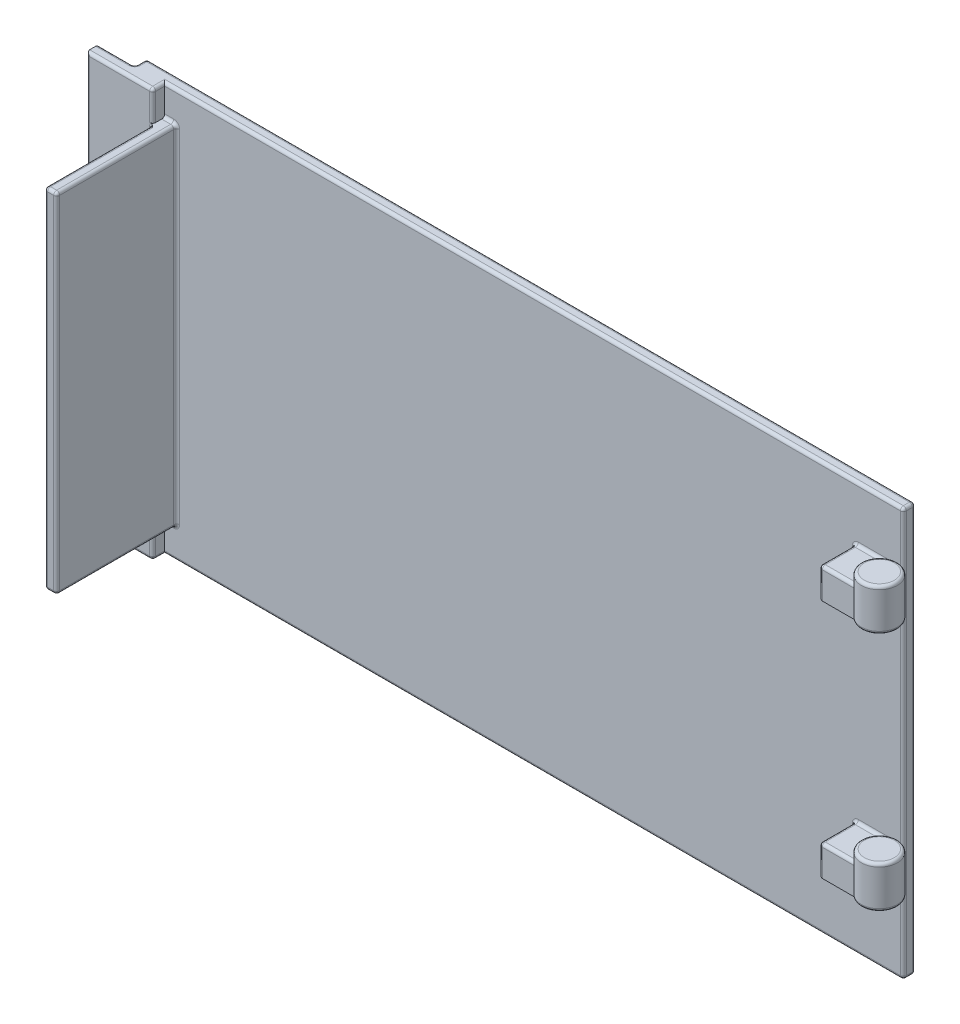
ISO-10303-21;
HEADER;
FILE_DESCRIPTION(('STEP AP214'),'2;1');
FILE_NAME('part.step','',(''),(''),'','','');
FILE_SCHEMA(('AUTOMOTIVE_DESIGN { 1 0 10303 214 1 1 1 1 }'));
ENDSEC;
DATA;
#1=APPLICATION_CONTEXT('core data for automotive mechanical design processes');
#2=APPLICATION_PROTOCOL_DEFINITION('international standard','automotive_design',2000,#1);
#3=PRODUCT_CONTEXT('',#1,'mechanical');
#4=PRODUCT('Part','Part','',(#3));
#5=PRODUCT_RELATED_PRODUCT_CATEGORY('part','',(#4));
#6=PRODUCT_DEFINITION_FORMATION('','',#4);
#7=PRODUCT_DEFINITION_CONTEXT('part definition',#1,'design');
#8=PRODUCT_DEFINITION('design','',#6,#7);
#9=PRODUCT_DEFINITION_SHAPE('','',#8);
#10=(LENGTH_UNIT() NAMED_UNIT(*) SI_UNIT(.MILLI.,.METRE.));
#11=(NAMED_UNIT(*) PLANE_ANGLE_UNIT() SI_UNIT($,.RADIAN.));
#12=(NAMED_UNIT(*) SI_UNIT($,.STERADIAN.) SOLID_ANGLE_UNIT());
#13=UNCERTAINTY_MEASURE_WITH_UNIT(LENGTH_MEASURE(1.E-05),#10,'distance_accuracy_value','');
#14=(GEOMETRIC_REPRESENTATION_CONTEXT(3) GLOBAL_UNCERTAINTY_ASSIGNED_CONTEXT((#13)) GLOBAL_UNIT_ASSIGNED_CONTEXT((#10,
#11,#12)) REPRESENTATION_CONTEXT('',''));
#15=CARTESIAN_POINT('',(0.,0.,0.));
#16=DIRECTION('',(0.,0.,1.));
#17=DIRECTION('',(1.,0.,0.));
#18=AXIS2_PLACEMENT_3D('',#15,#16,#17);
#19=CARTESIAN_POINT('',(0.,0.,2.));
#20=DIRECTION('',(0.,0.,-1.));
#21=DIRECTION('',(-1.,0.,0.));
#22=AXIS2_PLACEMENT_3D('',#19,#20,#21);
#23=PLANE('',#22);
#24=DIRECTION('',(-1.,0.,0.));
#25=VECTOR('',#24,1.);
#26=CARTESIAN_POINT('',(126.,59.5,2.));
#27=LINE('',#26,#25);
#28=CARTESIAN_POINT('',(120.5,59.5,2.));
#29=VERTEX_POINT('',#28);
#30=CARTESIAN_POINT('',(126.5,59.5,2.));
#31=VERTEX_POINT('',#30);
#32=EDGE_CURVE('E752',#29,#31,#27,.F.);
#33=ORIENTED_EDGE('',*,*,#32,.T.);
#34=DIRECTION('',(0.,1.,0.));
#35=VECTOR('',#34,1.);
#36=CARTESIAN_POINT('',(126.5,54.,2.));
#37=LINE('',#36,#35);
#38=CARTESIAN_POINT('',(126.5,53.5,2.));
#39=VERTEX_POINT('',#38);
#40=EDGE_CURVE('E756',#31,#39,#37,.F.);
#41=ORIENTED_EDGE('',*,*,#40,.T.);
#42=DIRECTION('',(1.,0.,0.));
#43=VECTOR('',#42,1.);
#44=CARTESIAN_POINT('',(120.,53.5,2.));
#45=LINE('',#44,#43);
#46=CARTESIAN_POINT('',(120.5,53.5,2.));
#47=VERTEX_POINT('',#46);
#48=EDGE_CURVE('E749',#39,#47,#45,.F.);
#49=ORIENTED_EDGE('',*,*,#48,.T.);
#50=CARTESIAN_POINT('',(120.5,54.5,2.));
#51=DIRECTION('',(0.,0.,-1.));
#52=DIRECTION('',(-1.,0.,0.));
#53=AXIS2_PLACEMENT_3D('',#50,#51,#52);
#54=CIRCLE('',#53,1.);
#55=CARTESIAN_POINT('',(119.5,54.5,2.));
#56=VERTEX_POINT('',#55);
#57=EDGE_CURVE('E745',#56,#47,#54,.F.);
#58=ORIENTED_EDGE('',*,*,#57,.F.);
#59=DIRECTION('',(0.,-1.,0.));
#60=VECTOR('',#59,1.);
#61=CARTESIAN_POINT('',(119.5,59.,2.));
#62=LINE('',#61,#60);
#63=CARTESIAN_POINT('',(119.5,58.5,2.));
#64=VERTEX_POINT('',#63);
#65=EDGE_CURVE('E742',#56,#64,#62,.F.);
#66=ORIENTED_EDGE('',*,*,#65,.T.);
#67=CARTESIAN_POINT('',(120.5,58.5,2.));
#68=DIRECTION('',(0.,0.,-1.));
#69=DIRECTION('',(-1.,0.,0.));
#70=AXIS2_PLACEMENT_3D('',#67,#68,#69);
#71=CIRCLE('',#70,1.);
#72=EDGE_CURVE('E738',#29,#64,#71,.F.);
#73=ORIENTED_EDGE('',*,*,#72,.F.);
#74=EDGE_LOOP('',(#33,#41,#49,#58,#66,#73));
#75=FACE_BOUND('',#74,.T.);
#76=DIRECTION('',(-1.,0.,0.));
#77=VECTOR('',#76,1.);
#78=CARTESIAN_POINT('',(126.,19.5,2.));
#79=LINE('',#78,#77);
#80=CARTESIAN_POINT('',(120.5,19.5,2.));
#81=VERTEX_POINT('',#80);
#82=CARTESIAN_POINT('',(126.5,19.5,2.));
#83=VERTEX_POINT('',#82);
#84=EDGE_CURVE('E724',#81,#83,#79,.F.);
#85=ORIENTED_EDGE('',*,*,#84,.T.);
#86=DIRECTION('',(0.,1.,0.));
#87=VECTOR('',#86,1.);
#88=CARTESIAN_POINT('',(126.5,14.,2.));
#89=LINE('',#88,#87);
#90=CARTESIAN_POINT('',(126.5,13.5,2.));
#91=VERTEX_POINT('',#90);
#92=EDGE_CURVE('E735',#83,#91,#89,.F.);
#93=ORIENTED_EDGE('',*,*,#92,.T.);
#94=DIRECTION('',(1.,0.,0.));
#95=VECTOR('',#94,1.);
#96=CARTESIAN_POINT('',(120.,13.5,2.));
#97=LINE('',#96,#95);
#98=CARTESIAN_POINT('',(120.5,13.5,2.));
#99=VERTEX_POINT('',#98);
#100=EDGE_CURVE('E731',#91,#99,#97,.F.);
#101=ORIENTED_EDGE('',*,*,#100,.T.);
#102=CARTESIAN_POINT('',(120.5,14.5,2.));
#103=DIRECTION('',(0.,0.,-1.));
#104=DIRECTION('',(-1.,0.,0.));
#105=AXIS2_PLACEMENT_3D('',#102,#103,#104);
#106=CIRCLE('',#105,1.);
#107=CARTESIAN_POINT('',(119.5,14.5,2.));
#108=VERTEX_POINT('',#107);
#109=EDGE_CURVE('E727',#108,#99,#106,.F.);
#110=ORIENTED_EDGE('',*,*,#109,.F.);
#111=DIRECTION('',(0.,-1.,0.));
#112=VECTOR('',#111,1.);
#113=CARTESIAN_POINT('',(119.5,19.,2.));
#114=LINE('',#113,#112);
#115=CARTESIAN_POINT('',(119.5,18.5,2.));
#116=VERTEX_POINT('',#115);
#117=EDGE_CURVE('E721',#108,#116,#114,.F.);
#118=ORIENTED_EDGE('',*,*,#117,.T.);
#119=CARTESIAN_POINT('',(120.5,18.5,2.));
#120=DIRECTION('',(0.,0.,-1.));
#121=DIRECTION('',(-1.,0.,0.));
#122=AXIS2_PLACEMENT_3D('',#119,#120,#121);
#123=CIRCLE('',#122,1.);
#124=EDGE_CURVE('E717',#81,#116,#123,.F.);
#125=ORIENTED_EDGE('',*,*,#124,.F.);
#126=EDGE_LOOP('',(#85,#93,#101,#110,#118,#125));
#127=FACE_BOUND('',#126,.T.);
#128=DIRECTION('',(0.,1.,0.));
#129=VECTOR('',#128,1.);
#130=CARTESIAN_POINT('',(127.5,0.,2.));
#131=LINE('',#130,#129);
#132=CARTESIAN_POINT('',(127.5,0.5,2.));
#133=VERTEX_POINT('',#132);
#134=CARTESIAN_POINT('',(127.5,67.5,2.));
#135=VERTEX_POINT('',#134);
#136=EDGE_CURVE('E707',#133,#135,#131,.T.);
#137=ORIENTED_EDGE('',*,*,#136,.T.);
#138=DIRECTION('',(-1.,0.,0.));
#139=VECTOR('',#138,1.);
#140=CARTESIAN_POINT('',(0.,67.5,2.));
#141=LINE('',#140,#139);
#142=CARTESIAN_POINT('',(5.,67.5,2.));
#143=VERTEX_POINT('',#142);
#144=EDGE_CURVE('E713',#135,#143,#141,.T.);
#145=ORIENTED_EDGE('',*,*,#144,.T.);
#146=DIRECTION('',(0.,1.,0.));
#147=VECTOR('',#146,1.);
#148=CARTESIAN_POINT('',(5.,68.,2.));
#149=LINE('',#148,#147);
#150=CARTESIAN_POINT('',(5.,63.5,2.));
#151=VERTEX_POINT('',#150);
#152=EDGE_CURVE('E650',#151,#143,#149,.T.);
#153=ORIENTED_EDGE('',*,*,#152,.F.);
#154=DIRECTION('',(-1.,0.,0.));
#155=VECTOR('',#154,1.);
#156=CARTESIAN_POINT('',(7.00000000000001,63.5,2.));
#157=LINE('',#156,#155);
#158=CARTESIAN_POINT('',(6.50000000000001,63.5,2.));
#159=VERTEX_POINT('',#158);
#160=EDGE_CURVE('E704',#151,#159,#157,.F.);
#161=ORIENTED_EDGE('',*,*,#160,.T.);
#162=CARTESIAN_POINT('',(6.50000000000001,62.5,2.));
#163=DIRECTION('',(0.,0.,-1.));
#164=DIRECTION('',(-1.,0.,0.));
#165=AXIS2_PLACEMENT_3D('',#162,#163,#164);
#166=CIRCLE('',#165,1.);
#167=CARTESIAN_POINT('',(7.50000000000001,62.5,2.));
#168=VERTEX_POINT('',#167);
#169=EDGE_CURVE('E700',#168,#159,#166,.F.);
#170=ORIENTED_EDGE('',*,*,#169,.F.);
#171=DIRECTION('',(0.,1.,0.));
#172=VECTOR('',#171,1.);
#173=CARTESIAN_POINT('',(7.50000000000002,5.,2.));
#174=LINE('',#173,#172);
#175=CARTESIAN_POINT('',(7.50000000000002,5.5,2.));
#176=VERTEX_POINT('',#175);
#177=EDGE_CURVE('E697',#168,#176,#174,.F.);
#178=ORIENTED_EDGE('',*,*,#177,.T.);
#179=CARTESIAN_POINT('',(6.50000000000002,5.5,2.));
#180=DIRECTION('',(0.,0.,-1.));
#181=DIRECTION('',(-1.,0.,0.));
#182=AXIS2_PLACEMENT_3D('',#179,#180,#181);
#183=CIRCLE('',#182,1.);
#184=CARTESIAN_POINT('',(6.50000000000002,4.5,2.));
#185=VERTEX_POINT('',#184);
#186=EDGE_CURVE('E693',#185,#176,#183,.F.);
#187=ORIENTED_EDGE('',*,*,#186,.F.);
#188=DIRECTION('',(1.,0.,0.));
#189=VECTOR('',#188,1.);
#190=CARTESIAN_POINT('',(5.00000000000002,4.5,2.));
#191=LINE('',#190,#189);
#192=CARTESIAN_POINT('',(5.00000000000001,4.5,2.));
#193=VERTEX_POINT('',#192);
#194=EDGE_CURVE('E690',#185,#193,#191,.F.);
#195=ORIENTED_EDGE('',*,*,#194,.T.);
#196=CARTESIAN_POINT('',(5.00000000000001,0.5,2.));
#197=VERTEX_POINT('',#196);
#198=EDGE_CURVE('E651',#197,#193,#149,.T.);
#199=ORIENTED_EDGE('',*,*,#198,.F.);
#200=DIRECTION('',(1.,0.,0.));
#201=VECTOR('',#200,1.);
#202=CARTESIAN_POINT('',(0.,0.5,2.));
#203=LINE('',#202,#201);
#204=EDGE_CURVE('E710',#197,#133,#203,.T.);
#205=ORIENTED_EDGE('',*,*,#204,.T.);
#206=EDGE_LOOP('',(#137,#145,#153,#161,#170,#178,#187,#195,#199,#205));
#207=FACE_BOUND('',#206,.T.);
#208=ADVANCED_FACE('F49',(#75,#127,#207),#23,.F.);
#209=CARTESIAN_POINT('',(5.,68.,4.));
#210=DIRECTION('',(-1.,0.,0.));
#211=DIRECTION('',(0.,-1.,0.));
#212=AXIS2_PLACEMENT_3D('',#209,#210,#211);
#213=PLANE('',#212);
#214=DIRECTION('',(0.,1.,0.));
#215=VECTOR('',#214,1.);
#216=CARTESIAN_POINT('',(5.00000000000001,0.5,3.5));
#217=LINE('',#216,#215);
#218=CARTESIAN_POINT('',(5.00000000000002,5.,3.5));
#219=VERTEX_POINT('',#218);
#220=CARTESIAN_POINT('',(5.00000000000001,0.5,3.5));
#221=VERTEX_POINT('',#220);
#222=EDGE_CURVE('E1295',#219,#221,#217,.F.);
#223=ORIENTED_EDGE('',*,*,#222,.T.);
#224=DIRECTION('',(0.,0.,-1.));
#225=VECTOR('',#224,1.);
#226=CARTESIAN_POINT('',(5.00000000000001,0.5,4.));
#227=LINE('',#226,#225);
#228=EDGE_CURVE('E1827',#221,#197,#227,.T.);
#229=ORIENTED_EDGE('',*,*,#228,.T.);
#230=ORIENTED_EDGE('',*,*,#198,.T.);
#231=CARTESIAN_POINT('',(5.00000000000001,4.5,2.5));
#232=DIRECTION('',(-1.,0.,0.));
#233=DIRECTION('',(0.,-1.,0.));
#234=AXIS2_PLACEMENT_3D('',#231,#232,#233);
#235=CIRCLE('',#234,0.5);
#236=CARTESIAN_POINT('',(5.00000000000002,5.,2.5));
#237=VERTEX_POINT('',#236);
#238=EDGE_CURVE('E1001',#193,#237,#235,.F.);
#239=ORIENTED_EDGE('',*,*,#238,.T.);
#240=DIRECTION('',(0.,0.,-1.));
#241=VECTOR('',#240,1.);
#242=CARTESIAN_POINT('',(5.00000000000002,5.,22.));
#243=LINE('',#242,#241);
#244=EDGE_CURVE('E647',#219,#237,#243,.T.);
#245=ORIENTED_EDGE('',*,*,#244,.F.);
#246=EDGE_LOOP('',(#223,#229,#230,#239,#245));
#247=FACE_BOUND('',#246,.T.);
#248=ADVANCED_FACE('F1342',(#247),#213,.F.);
#249=ORIENTED_EDGE('',*,*,#152,.T.);
#250=DIRECTION('',(0.,0.,-1.));
#251=VECTOR('',#250,1.);
#252=CARTESIAN_POINT('',(5.,67.5,4.));
#253=LINE('',#252,#251);
#254=CARTESIAN_POINT('',(5.,67.5,3.5));
#255=VERTEX_POINT('',#254);
#256=EDGE_CURVE('E1863',#143,#255,#253,.F.);
#257=ORIENTED_EDGE('',*,*,#256,.T.);
#258=DIRECTION('',(0.,1.,0.));
#259=VECTOR('',#258,1.);
#260=CARTESIAN_POINT('',(5.,63.,3.5));
#261=LINE('',#260,#259);
#262=CARTESIAN_POINT('',(5.00000000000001,63.,3.5));
#263=VERTEX_POINT('',#262);
#264=EDGE_CURVE('E1860',#255,#263,#261,.F.);
#265=ORIENTED_EDGE('',*,*,#264,.T.);
#266=DIRECTION('',(0.,0.,-1.));
#267=VECTOR('',#266,1.);
#268=CARTESIAN_POINT('',(5.00000000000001,63.,22.));
#269=LINE('',#268,#267);
#270=CARTESIAN_POINT('',(5.00000000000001,63.,2.5));
#271=VERTEX_POINT('',#270);
#272=EDGE_CURVE('E644',#263,#271,#269,.T.);
#273=ORIENTED_EDGE('',*,*,#272,.T.);
#274=CARTESIAN_POINT('',(5.,63.5,2.5));
#275=DIRECTION('',(-1.,0.,0.));
#276=DIRECTION('',(0.,-1.,0.));
#277=AXIS2_PLACEMENT_3D('',#274,#275,#276);
#278=CIRCLE('',#277,0.5);
#279=EDGE_CURVE('E687',#271,#151,#278,.F.);
#280=ORIENTED_EDGE('',*,*,#279,.T.);
#281=EDGE_LOOP('',(#249,#257,#265,#273,#280));
#282=FACE_BOUND('',#281,.T.);
#283=ADVANCED_FACE('F1350',(#282),#213,.F.);
#284=CARTESIAN_POINT('',(0.,0.,2.));
#285=DIRECTION('',(1.,0.,0.));
#286=DIRECTION('',(0.,0.,-1.));
#287=AXIS2_PLACEMENT_3D('',#284,#285,#286);
#288=PLANE('',#287);
#289=CARTESIAN_POINT('',(0.,24.5,-0.5));
#290=DIRECTION('',(1.,0.,0.));
#291=DIRECTION('',(0.,0.,-1.));
#292=AXIS2_PLACEMENT_3D('',#289,#290,#291);
#293=CIRCLE('',#292,1.);
#294=CARTESIAN_POINT('',(0.,24.5,0.5));
#295=VERTEX_POINT('',#294);
#296=CARTESIAN_POINT('',(0.,25.5,-0.5));
#297=VERTEX_POINT('',#296);
#298=EDGE_CURVE('E937',#295,#297,#293,.F.);
#299=ORIENTED_EDGE('',*,*,#298,.F.);
#300=DIRECTION('',(0.,-1.,0.));
#301=VECTOR('',#300,1.);
#302=CARTESIAN_POINT('',(0.,0.,0.5));
#303=LINE('',#302,#301);
#304=CARTESIAN_POINT('',(0.,0.5,0.5));
#305=VERTEX_POINT('',#304);
#306=EDGE_CURVE('E941',#295,#305,#303,.T.);
#307=ORIENTED_EDGE('',*,*,#306,.T.);
#308=DIRECTION('',(0.,0.,-1.));
#309=VECTOR('',#308,1.);
#310=CARTESIAN_POINT('',(0.,0.5,2.));
#311=LINE('',#310,#309);
#312=CARTESIAN_POINT('',(0.,0.5,1.5));
#313=VERTEX_POINT('',#312);
#314=EDGE_CURVE('E934',#305,#313,#311,.F.);
#315=ORIENTED_EDGE('',*,*,#314,.T.);
#316=DIRECTION('',(0.,-1.,0.));
#317=VECTOR('',#316,1.);
#318=CARTESIAN_POINT('',(0.,68.,1.5));
#319=LINE('',#318,#317);
#320=CARTESIAN_POINT('',(0.,67.5,1.5));
#321=VERTEX_POINT('',#320);
#322=EDGE_CURVE('E927',#313,#321,#319,.F.);
#323=ORIENTED_EDGE('',*,*,#322,.T.);
#324=DIRECTION('',(0.,0.,-1.));
#325=VECTOR('',#324,1.);
#326=CARTESIAN_POINT('',(0.,67.5,2.));
#327=LINE('',#326,#325);
#328=CARTESIAN_POINT('',(0.,67.5,0.5));
#329=VERTEX_POINT('',#328);
#330=EDGE_CURVE('E918',#321,#329,#327,.T.);
#331=ORIENTED_EDGE('',*,*,#330,.T.);
#332=DIRECTION('',(0.,-1.,0.));
#333=VECTOR('',#332,1.);
#334=CARTESIAN_POINT('',(0.,28.,0.5));
#335=LINE('',#334,#333);
#336=CARTESIAN_POINT('',(0.,28.5,0.5));
#337=VERTEX_POINT('',#336);
#338=EDGE_CURVE('E915',#329,#337,#335,.T.);
#339=ORIENTED_EDGE('',*,*,#338,.T.);
#340=CARTESIAN_POINT('',(0.,28.5,-0.5));
#341=DIRECTION('',(1.,0.,0.));
#342=DIRECTION('',(0.,0.,-1.));
#343=AXIS2_PLACEMENT_3D('',#340,#341,#342);
#344=CIRCLE('',#343,1.);
#345=CARTESIAN_POINT('',(0.,27.5,-0.5));
#346=VERTEX_POINT('',#345);
#347=EDGE_CURVE('E911',#346,#337,#344,.F.);
#348=ORIENTED_EDGE('',*,*,#347,.F.);
#349=DIRECTION('',(0.,0.,1.));
#350=VECTOR('',#349,1.);
#351=CARTESIAN_POINT('',(0.,27.5,2.));
#352=LINE('',#351,#350);
#353=CARTESIAN_POINT('',(0.,27.5,-5.5));
#354=VERTEX_POINT('',#353);
#355=EDGE_CURVE('E908',#346,#354,#352,.F.);
#356=ORIENTED_EDGE('',*,*,#355,.T.);
#357=CARTESIAN_POINT('',(0.,28.5,-5.5));
#358=DIRECTION('',(1.,0.,0.));
#359=DIRECTION('',(0.,0.,-1.));
#360=AXIS2_PLACEMENT_3D('',#357,#358,#359);
#361=CIRCLE('',#360,1.);
#362=CARTESIAN_POINT('',(0.,28.5,-6.5));
#363=VERTEX_POINT('',#362);
#364=EDGE_CURVE('E904',#363,#354,#361,.F.);
#365=ORIENTED_EDGE('',*,*,#364,.F.);
#366=DIRECTION('',(0.,-1.,0.));
#367=VECTOR('',#366,1.);
#368=CARTESIAN_POINT('',(0.,0.,-6.49999999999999));
#369=LINE('',#368,#367);
#370=CARTESIAN_POINT('',(0.,42.5,-6.5));
#371=VERTEX_POINT('',#370);
#372=EDGE_CURVE('E901',#363,#371,#369,.F.);
#373=ORIENTED_EDGE('',*,*,#372,.T.);
#374=DIRECTION('',(0.,0.,1.));
#375=VECTOR('',#374,1.);
#376=CARTESIAN_POINT('',(0.,42.5,2.));
#377=LINE('',#376,#375);
#378=CARTESIAN_POINT('',(0.,42.5,-8.5));
#379=VERTEX_POINT('',#378);
#380=EDGE_CURVE('E921',#371,#379,#377,.F.);
#381=ORIENTED_EDGE('',*,*,#380,.T.);
#382=DIRECTION('',(0.,1.,0.));
#383=VECTOR('',#382,1.);
#384=CARTESIAN_POINT('',(0.,25.,-8.5));
#385=LINE('',#384,#383);
#386=CARTESIAN_POINT('',(0.,25.5,-8.5));
#387=VERTEX_POINT('',#386);
#388=EDGE_CURVE('E924',#379,#387,#385,.F.);
#389=ORIENTED_EDGE('',*,*,#388,.T.);
#390=DIRECTION('',(0.,0.,1.));
#391=VECTOR('',#390,1.);
#392=CARTESIAN_POINT('',(0.,25.5,2.));
#393=LINE('',#392,#391);
#394=EDGE_CURVE('E931',#387,#297,#393,.T.);
#395=ORIENTED_EDGE('',*,*,#394,.T.);
#396=EDGE_LOOP('',(#299,#307,#315,#323,#331,#339,#348,#356,#365,#373,#381,#389,#395));
#397=FACE_BOUND('',#396,.T.);
#398=ADVANCED_FACE('F1373',(#397),#288,.F.);
#399=CARTESIAN_POINT('',(0.,0.,2.));
#400=DIRECTION('',(0.,1.,0.));
#401=DIRECTION('',(0.,0.,1.));
#402=AXIS2_PLACEMENT_3D('',#399,#400,#401);
#403=PLANE('',#402);
#404=DIRECTION('',(1.,0.,0.));
#405=VECTOR('',#404,1.);
#406=CARTESIAN_POINT('',(0.,0.,1.5));
#407=LINE('',#406,#405);
#408=CARTESIAN_POINT('',(127.5,0.,1.5));
#409=VERTEX_POINT('',#408);
#410=CARTESIAN_POINT('',(4.50000000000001,0.,1.5));
#411=VERTEX_POINT('',#410);
#412=EDGE_CURVE('E895',#409,#411,#407,.F.);
#413=ORIENTED_EDGE('',*,*,#412,.T.);
#414=DIRECTION('',(0.,0.,-1.));
#415=VECTOR('',#414,1.);
#416=CARTESIAN_POINT('',(4.50000000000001,0.,2.));
#417=LINE('',#416,#415);
#418=CARTESIAN_POINT('',(4.50000000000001,0.,3.5));
#419=VERTEX_POINT('',#418);
#420=EDGE_CURVE('E1831',#411,#419,#417,.F.);
#421=ORIENTED_EDGE('',*,*,#420,.T.);
#422=DIRECTION('',(1.,0.,0.));
#423=VECTOR('',#422,1.);
#424=CARTESIAN_POINT('',(-5.99999999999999,0.,3.5));
#425=LINE('',#424,#423);
#426=CARTESIAN_POINT('',(-5.99999999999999,0.,3.5));
#427=VERTEX_POINT('',#426);
#428=EDGE_CURVE('E898',#419,#427,#425,.F.);
#429=ORIENTED_EDGE('',*,*,#428,.T.);
#430=DIRECTION('',(0.,0.,-1.));
#431=VECTOR('',#430,1.);
#432=CARTESIAN_POINT('',(-5.99999999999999,0.,4.));
#433=LINE('',#432,#431);
#434=CARTESIAN_POINT('',(-5.99999999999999,0.,2.5));
#435=VERTEX_POINT('',#434);
#436=EDGE_CURVE('E659',#427,#435,#433,.T.);
#437=ORIENTED_EDGE('',*,*,#436,.T.);
#438=DIRECTION('',(1.,0.,0.));
#439=VECTOR('',#438,1.);
#440=CARTESIAN_POINT('',(0.,0.,2.5));
#441=LINE('',#440,#439);
#442=CARTESIAN_POINT('',(-0.5,0.,2.5));
#443=VERTEX_POINT('',#442);
#444=EDGE_CURVE('E892',#435,#443,#441,.T.);
#445=ORIENTED_EDGE('',*,*,#444,.T.);
#446=CARTESIAN_POINT('',(-0.5,0.,1.5));
#447=DIRECTION('',(0.,1.,0.));
#448=DIRECTION('',(0.,0.,1.));
#449=AXIS2_PLACEMENT_3D('',#446,#447,#448);
#450=CIRCLE('',#449,1.);
#451=CARTESIAN_POINT('',(0.5,0.,1.5));
#452=VERTEX_POINT('',#451);
#453=EDGE_CURVE('E888',#452,#443,#450,.F.);
#454=ORIENTED_EDGE('',*,*,#453,.F.);
#455=DIRECTION('',(0.,0.,-1.));
#456=VECTOR('',#455,1.);
#457=CARTESIAN_POINT('',(0.5,0.,2.));
#458=LINE('',#457,#456);
#459=CARTESIAN_POINT('',(0.5,0.,0.5));
#460=VERTEX_POINT('',#459);
#461=EDGE_CURVE('E879',#452,#460,#458,.T.);
#462=ORIENTED_EDGE('',*,*,#461,.T.);
#463=DIRECTION('',(1.,0.,0.));
#464=VECTOR('',#463,1.);
#465=CARTESIAN_POINT('',(128.,0.,0.5));
#466=LINE('',#465,#464);
#467=CARTESIAN_POINT('',(127.5,0.,0.5));
#468=VERTEX_POINT('',#467);
#469=EDGE_CURVE('E882',#460,#468,#466,.T.);
#470=ORIENTED_EDGE('',*,*,#469,.T.);
#471=DIRECTION('',(0.,0.,-1.));
#472=VECTOR('',#471,1.);
#473=CARTESIAN_POINT('',(127.5,0.,2.));
#474=LINE('',#473,#472);
#475=EDGE_CURVE('E885',#468,#409,#474,.F.);
#476=ORIENTED_EDGE('',*,*,#475,.T.);
#477=EDGE_LOOP('',(#413,#421,#429,#437,#445,#454,#462,#470,#476));
#478=FACE_BOUND('',#477,.T.);
#479=ADVANCED_FACE('F1369',(#478),#403,.F.);
#480=CARTESIAN_POINT('',(128.,0.,2.));
#481=DIRECTION('',(-1.,0.,0.));
#482=DIRECTION('',(0.,0.,1.));
#483=AXIS2_PLACEMENT_3D('',#480,#481,#482);
#484=PLANE('',#483);
#485=DIRECTION('',(0.,0.,-1.));
#486=VECTOR('',#485,1.);
#487=CARTESIAN_POINT('',(128.,0.5,2.));
#488=LINE('',#487,#486);
#489=CARTESIAN_POINT('',(128.,0.5,1.5));
#490=VERTEX_POINT('',#489);
#491=CARTESIAN_POINT('',(128.,0.5,0.5));
#492=VERTEX_POINT('',#491);
#493=EDGE_CURVE('E1092',#490,#492,#488,.T.);
#494=ORIENTED_EDGE('',*,*,#493,.T.);
#495=DIRECTION('',(0.,1.,0.));
#496=VECTOR('',#495,1.);
#497=CARTESIAN_POINT('',(128.,68.,0.5));
#498=LINE('',#497,#496);
#499=CARTESIAN_POINT('',(128.,67.5,0.5));
#500=VERTEX_POINT('',#499);
#501=EDGE_CURVE('E1096',#492,#500,#498,.T.);
#502=ORIENTED_EDGE('',*,*,#501,.T.);
#503=DIRECTION('',(0.,0.,-1.));
#504=VECTOR('',#503,1.);
#505=CARTESIAN_POINT('',(128.,67.5,2.));
#506=LINE('',#505,#504);
#507=CARTESIAN_POINT('',(128.,67.5,1.5));
#508=VERTEX_POINT('',#507);
#509=EDGE_CURVE('E1089',#500,#508,#506,.F.);
#510=ORIENTED_EDGE('',*,*,#509,.T.);
#511=DIRECTION('',(0.,1.,0.));
#512=VECTOR('',#511,1.);
#513=CARTESIAN_POINT('',(128.,0.,1.5));
#514=LINE('',#513,#512);
#515=EDGE_CURVE('E1086',#508,#490,#514,.F.);
#516=ORIENTED_EDGE('',*,*,#515,.T.);
#517=EDGE_LOOP('',(#494,#502,#510,#516));
#518=FACE_BOUND('',#517,.T.);
#519=ADVANCED_FACE('F1365',(#518),#484,.F.);
#520=CARTESIAN_POINT('',(0.,68.,2.));
#521=DIRECTION('',(0.,-1.,0.));
#522=DIRECTION('',(0.,0.,-1.));
#523=AXIS2_PLACEMENT_3D('',#520,#521,#522);
#524=PLANE('',#523);
#525=DIRECTION('',(-1.,0.,0.));
#526=VECTOR('',#525,1.);
#527=CARTESIAN_POINT('',(5.,68.,3.5));
#528=LINE('',#527,#526);
#529=CARTESIAN_POINT('',(-6.,68.,3.5));
#530=VERTEX_POINT('',#529);
#531=CARTESIAN_POINT('',(4.5,68.,3.5));
#532=VERTEX_POINT('',#531);
#533=EDGE_CURVE('E963',#530,#532,#528,.F.);
#534=ORIENTED_EDGE('',*,*,#533,.T.);
#535=DIRECTION('',(0.,0.,-1.));
#536=VECTOR('',#535,1.);
#537=CARTESIAN_POINT('',(4.5,68.,2.));
#538=LINE('',#537,#536);
#539=CARTESIAN_POINT('',(4.5,68.,1.5));
#540=VERTEX_POINT('',#539);
#541=EDGE_CURVE('E1848',#532,#540,#538,.T.);
#542=ORIENTED_EDGE('',*,*,#541,.T.);
#543=DIRECTION('',(-1.,0.,0.));
#544=VECTOR('',#543,1.);
#545=CARTESIAN_POINT('',(0.,68.,1.5));
#546=LINE('',#545,#544);
#547=CARTESIAN_POINT('',(127.5,68.,1.5));
#548=VERTEX_POINT('',#547);
#549=EDGE_CURVE('E960',#540,#548,#546,.F.);
#550=ORIENTED_EDGE('',*,*,#549,.T.);
#551=DIRECTION('',(0.,0.,-1.));
#552=VECTOR('',#551,1.);
#553=CARTESIAN_POINT('',(127.5,68.,2.));
#554=LINE('',#553,#552);
#555=CARTESIAN_POINT('',(127.5,68.,0.5));
#556=VERTEX_POINT('',#555);
#557=EDGE_CURVE('E957',#548,#556,#554,.T.);
#558=ORIENTED_EDGE('',*,*,#557,.T.);
#559=DIRECTION('',(-1.,0.,0.));
#560=VECTOR('',#559,1.);
#561=CARTESIAN_POINT('',(0.,68.,0.5));
#562=LINE('',#561,#560);
#563=CARTESIAN_POINT('',(0.5,68.,0.5));
#564=VERTEX_POINT('',#563);
#565=EDGE_CURVE('E951',#556,#564,#562,.T.);
#566=ORIENTED_EDGE('',*,*,#565,.T.);
#567=DIRECTION('',(0.,0.,-1.));
#568=VECTOR('',#567,1.);
#569=CARTESIAN_POINT('',(0.5,68.,2.));
#570=LINE('',#569,#568);
#571=CARTESIAN_POINT('',(0.5,68.,1.5));
#572=VERTEX_POINT('',#571);
#573=EDGE_CURVE('E948',#564,#572,#570,.F.);
#574=ORIENTED_EDGE('',*,*,#573,.T.);
#575=CARTESIAN_POINT('',(-0.5,68.,1.5));
#576=DIRECTION('',(0.,-1.,0.));
#577=DIRECTION('',(0.,0.,-1.));
#578=AXIS2_PLACEMENT_3D('',#575,#576,#577);
#579=CIRCLE('',#578,1.);
#580=CARTESIAN_POINT('',(-0.5,68.,2.5));
#581=VERTEX_POINT('',#580);
#582=EDGE_CURVE('E944',#581,#572,#579,.F.);
#583=ORIENTED_EDGE('',*,*,#582,.F.);
#584=DIRECTION('',(-1.,0.,0.));
#585=VECTOR('',#584,1.);
#586=CARTESIAN_POINT('',(0.,68.,2.5));
#587=LINE('',#586,#585);
#588=CARTESIAN_POINT('',(-6.,68.,2.5));
#589=VERTEX_POINT('',#588);
#590=EDGE_CURVE('E954',#581,#589,#587,.T.);
#591=ORIENTED_EDGE('',*,*,#590,.T.);
#592=DIRECTION('',(0.,0.,-1.));
#593=VECTOR('',#592,1.);
#594=CARTESIAN_POINT('',(-6.,68.,4.));
#595=LINE('',#594,#593);
#596=EDGE_CURVE('E655',#530,#589,#595,.T.);
#597=ORIENTED_EDGE('',*,*,#596,.F.);
#598=EDGE_LOOP('',(#534,#542,#550,#558,#566,#574,#583,#591,#597));
#599=FACE_BOUND('',#598,.T.);
#600=ADVANCED_FACE('F1361',(#599),#524,.F.);
#601=CARTESIAN_POINT('',(0.,0.,0.));
#602=DIRECTION('',(0.,0.,-1.));
#603=DIRECTION('',(-1.,0.,0.));
#604=AXIS2_PLACEMENT_3D('',#601,#602,#603);
#605=PLANE('',#604);
#606=DIRECTION('',(-1.,0.,0.));
#607=VECTOR('',#606,1.);
#608=CARTESIAN_POINT('',(128.,67.5,0.));
#609=LINE('',#608,#607);
#610=CARTESIAN_POINT('',(0.5,67.5,0.));
#611=VERTEX_POINT('',#610);
#612=CARTESIAN_POINT('',(127.5,67.5,0.));
#613=VERTEX_POINT('',#612);
#614=EDGE_CURVE('E839',#611,#613,#609,.F.);
#615=ORIENTED_EDGE('',*,*,#614,.T.);
#616=DIRECTION('',(0.,1.,0.));
#617=VECTOR('',#616,1.);
#618=CARTESIAN_POINT('',(127.5,0.,0.));
#619=LINE('',#618,#617);
#620=CARTESIAN_POINT('',(127.5,0.5,0.));
#621=VERTEX_POINT('',#620);
#622=EDGE_CURVE('E856',#613,#621,#619,.F.);
#623=ORIENTED_EDGE('',*,*,#622,.T.);
#624=DIRECTION('',(1.,0.,0.));
#625=VECTOR('',#624,1.);
#626=CARTESIAN_POINT('',(0.,0.5,0.));
#627=LINE('',#626,#625);
#628=CARTESIAN_POINT('',(0.5,0.5,0.));
#629=VERTEX_POINT('',#628);
#630=EDGE_CURVE('E853',#621,#629,#627,.F.);
#631=ORIENTED_EDGE('',*,*,#630,.T.);
#632=DIRECTION('',(0.,-1.,0.));
#633=VECTOR('',#632,1.);
#634=CARTESIAN_POINT('',(0.5,25.,0.));
#635=LINE('',#634,#633);
#636=CARTESIAN_POINT('',(0.5,24.5,0.));
#637=VERTEX_POINT('',#636);
#638=EDGE_CURVE('E850',#629,#637,#635,.F.);
#639=ORIENTED_EDGE('',*,*,#638,.T.);
#640=DIRECTION('',(-1.,0.,0.));
#641=VECTOR('',#640,1.);
#642=CARTESIAN_POINT('',(0.,24.5,0.));
#643=LINE('',#642,#641);
#644=CARTESIAN_POINT('',(17.5,24.5,0.));
#645=VERTEX_POINT('',#644);
#646=EDGE_CURVE('E846',#637,#645,#643,.F.);
#647=ORIENTED_EDGE('',*,*,#646,.T.);
#648=CARTESIAN_POINT('',(17.5,25.5,0.));
#649=DIRECTION('',(0.,0.,-1.));
#650=DIRECTION('',(-1.,0.,0.));
#651=AXIS2_PLACEMENT_3D('',#648,#649,#650);
#652=CIRCLE('',#651,1.);
#653=CARTESIAN_POINT('',(18.5,25.5,0.));
#654=VERTEX_POINT('',#653);
#655=EDGE_CURVE('E842',#654,#645,#652,.T.);
#656=ORIENTED_EDGE('',*,*,#655,.F.);
#657=DIRECTION('',(0.,-1.,0.));
#658=VECTOR('',#657,1.);
#659=CARTESIAN_POINT('',(18.5,0.,0.));
#660=LINE('',#659,#658);
#661=CARTESIAN_POINT('',(18.5,42.5,0.));
#662=VERTEX_POINT('',#661);
#663=EDGE_CURVE('E836',#654,#662,#660,.F.);
#664=ORIENTED_EDGE('',*,*,#663,.T.);
#665=CARTESIAN_POINT('',(17.5,42.5,0.));
#666=DIRECTION('',(0.,0.,-1.));
#667=DIRECTION('',(-1.,0.,0.));
#668=AXIS2_PLACEMENT_3D('',#665,#666,#667);
#669=CIRCLE('',#668,1.);
#670=CARTESIAN_POINT('',(17.5,43.5,0.));
#671=VERTEX_POINT('',#670);
#672=EDGE_CURVE('E832',#671,#662,#669,.T.);
#673=ORIENTED_EDGE('',*,*,#672,.F.);
#674=DIRECTION('',(1.,0.,0.));
#675=VECTOR('',#674,1.);
#676=CARTESIAN_POINT('',(0.,43.5,0.));
#677=LINE('',#676,#675);
#678=CARTESIAN_POINT('',(15.5,43.5,0.));
#679=VERTEX_POINT('',#678);
#680=EDGE_CURVE('E829',#671,#679,#677,.F.);
#681=ORIENTED_EDGE('',*,*,#680,.T.);
#682=CARTESIAN_POINT('',(15.5,42.5,0.));
#683=DIRECTION('',(0.,0.,-1.));
#684=DIRECTION('',(-1.,0.,0.));
#685=AXIS2_PLACEMENT_3D('',#682,#683,#684);
#686=CIRCLE('',#685,1.);
#687=CARTESIAN_POINT('',(14.5,42.5,0.));
#688=VERTEX_POINT('',#687);
#689=EDGE_CURVE('E825',#688,#679,#686,.T.);
#690=ORIENTED_EDGE('',*,*,#689,.F.);
#691=DIRECTION('',(0.,1.,0.));
#692=VECTOR('',#691,1.);
#693=CARTESIAN_POINT('',(14.5,28.,0.));
#694=LINE('',#693,#692);
#695=CARTESIAN_POINT('',(14.5,28.5,0.));
#696=VERTEX_POINT('',#695);
#697=EDGE_CURVE('E822',#688,#696,#694,.F.);
#698=ORIENTED_EDGE('',*,*,#697,.T.);
#699=DIRECTION('',(-1.,0.,0.));
#700=VECTOR('',#699,1.);
#701=CARTESIAN_POINT('',(0.,28.5,0.));
#702=LINE('',#701,#700);
#703=CARTESIAN_POINT('',(0.5,28.5,0.));
#704=VERTEX_POINT('',#703);
#705=EDGE_CURVE('E819',#696,#704,#702,.T.);
#706=ORIENTED_EDGE('',*,*,#705,.T.);
#707=DIRECTION('',(0.,-1.,0.));
#708=VECTOR('',#707,1.);
#709=CARTESIAN_POINT('',(0.5,68.,0.));
#710=LINE('',#709,#708);
#711=EDGE_CURVE('E816',#704,#611,#710,.F.);
#712=ORIENTED_EDGE('',*,*,#711,.T.);
#713=EDGE_LOOP('',(#615,#623,#631,#639,#647,#656,#664,#673,#681,#690,#698,#706,#712));
#714=FACE_BOUND('',#713,.T.);
#715=ADVANCED_FACE('F1357',(#714),#605,.T.);
#716=CARTESIAN_POINT('',(0.,0.,2.));
#717=DIRECTION('',(0.,0.,1.));
#718=DIRECTION('',(1.,0.,0.));
#719=AXIS2_PLACEMENT_3D('',#716,#717,#718);
#720=PLANE('',#719);
#721=DIRECTION('',(1.,0.,0.));
#722=VECTOR('',#721,1.);
#723=CARTESIAN_POINT('',(0.,0.5,2.));
#724=LINE('',#723,#722);
#725=CARTESIAN_POINT('',(-0.5,0.5,2.));
#726=VERTEX_POINT('',#725);
#727=CARTESIAN_POINT('',(-5.49999999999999,0.5,2.));
#728=VERTEX_POINT('',#727);
#729=EDGE_CURVE('E872',#726,#728,#724,.F.);
#730=ORIENTED_EDGE('',*,*,#729,.T.);
#731=DIRECTION('',(0.,-1.,0.));
#732=VECTOR('',#731,1.);
#733=CARTESIAN_POINT('',(-5.49999999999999,0.,2.));
#734=LINE('',#733,#732);
#735=CARTESIAN_POINT('',(-5.5,67.5,2.));
#736=VERTEX_POINT('',#735);
#737=EDGE_CURVE('E875',#728,#736,#734,.F.);
#738=ORIENTED_EDGE('',*,*,#737,.T.);
#739=DIRECTION('',(-1.,0.,0.));
#740=VECTOR('',#739,1.);
#741=CARTESIAN_POINT('',(0.,67.5,2.));
#742=LINE('',#741,#740);
#743=CARTESIAN_POINT('',(-0.5,67.5,2.));
#744=VERTEX_POINT('',#743);
#745=EDGE_CURVE('E866',#736,#744,#742,.F.);
#746=ORIENTED_EDGE('',*,*,#745,.T.);
#747=DIRECTION('',(0.,-1.,0.));
#748=VECTOR('',#747,1.);
#749=CARTESIAN_POINT('',(-0.5,0.,2.));
#750=LINE('',#749,#748);
#751=EDGE_CURVE('E869',#744,#726,#750,.T.);
#752=ORIENTED_EDGE('',*,*,#751,.T.);
#753=EDGE_LOOP('',(#730,#738,#746,#752));
#754=FACE_BOUND('',#753,.T.);
#755=ADVANCED_FACE('F1360',(#754),#720,.F.);
#756=CARTESIAN_POINT('',(-6.,68.,4.));
#757=DIRECTION('',(1.,0.,0.));
#758=DIRECTION('',(0.,1.,0.));
#759=AXIS2_PLACEMENT_3D('',#756,#757,#758);
#760=PLANE('',#759);
#761=ORIENTED_EDGE('',*,*,#596,.T.);
#762=DIRECTION('',(0.,-1.,0.));
#763=VECTOR('',#762,1.);
#764=CARTESIAN_POINT('',(-6.,68.,2.5));
#765=LINE('',#764,#763);
#766=EDGE_CURVE('E862',#589,#435,#765,.T.);
#767=ORIENTED_EDGE('',*,*,#766,.T.);
#768=ORIENTED_EDGE('',*,*,#436,.F.);
#769=DIRECTION('',(0.,-1.,0.));
#770=VECTOR('',#769,1.);
#771=CARTESIAN_POINT('',(-6.,68.,3.5));
#772=LINE('',#771,#770);
#773=EDGE_CURVE('E859',#427,#530,#772,.F.);
#774=ORIENTED_EDGE('',*,*,#773,.T.);
#775=EDGE_LOOP('',(#761,#767,#768,#774));
#776=FACE_BOUND('',#775,.T.);
#777=ADVANCED_FACE('F1356',(#776),#760,.F.);
#778=CARTESIAN_POINT('',(0.,0.,4.));
#779=DIRECTION('',(0.,0.,1.));
#780=DIRECTION('',(1.,0.,0.));
#781=AXIS2_PLACEMENT_3D('',#778,#779,#780);
#782=PLANE('',#781);
#783=DIRECTION('',(-1.,0.,0.));
#784=VECTOR('',#783,1.);
#785=CARTESIAN_POINT('',(0.,5.,4.));
#786=LINE('',#785,#784);
#787=CARTESIAN_POINT('',(4.63397459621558,5.,4.));
#788=VERTEX_POINT('',#787);
#789=CARTESIAN_POINT('',(4.50000000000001,5.,4.));
#790=VERTEX_POINT('',#789);
#791=EDGE_CURVE('E1031',#788,#790,#786,.T.);
#792=ORIENTED_EDGE('',*,*,#791,.F.);
#793=CARTESIAN_POINT('',(5.50000000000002,5.5,4.));
#794=DIRECTION('',(0.,0.,1.));
#795=DIRECTION('',(1.,0.,0.));
#796=AXIS2_PLACEMENT_3D('',#793,#794,#795);
#797=CIRCLE('',#796,1.);
#798=CARTESIAN_POINT('',(4.50000000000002,5.5,4.));
#799=VERTEX_POINT('',#798);
#800=EDGE_CURVE('E1892',#788,#799,#797,.F.);
#801=ORIENTED_EDGE('',*,*,#800,.T.);
#802=DIRECTION('',(0.,1.,0.));
#803=VECTOR('',#802,1.);
#804=CARTESIAN_POINT('',(4.50000000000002,0.,4.));
#805=LINE('',#804,#803);
#806=CARTESIAN_POINT('',(4.50000000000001,62.5,4.));
#807=VERTEX_POINT('',#806);
#808=EDGE_CURVE('E1879',#799,#807,#805,.T.);
#809=ORIENTED_EDGE('',*,*,#808,.T.);
#810=CARTESIAN_POINT('',(5.50000000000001,62.5,4.));
#811=DIRECTION('',(0.,0.,1.));
#812=DIRECTION('',(1.,0.,0.));
#813=AXIS2_PLACEMENT_3D('',#810,#811,#812);
#814=CIRCLE('',#813,1.);
#815=CARTESIAN_POINT('',(4.63397459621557,63.,4.));
#816=VERTEX_POINT('',#815);
#817=EDGE_CURVE('E1889',#807,#816,#814,.F.);
#818=ORIENTED_EDGE('',*,*,#817,.T.);
#819=DIRECTION('',(1.,0.,0.));
#820=VECTOR('',#819,1.);
#821=CARTESIAN_POINT('',(0.,63.,4.));
#822=LINE('',#821,#820);
#823=CARTESIAN_POINT('',(4.5,63.,4.));
#824=VERTEX_POINT('',#823);
#825=EDGE_CURVE('E677',#824,#816,#822,.T.);
#826=ORIENTED_EDGE('',*,*,#825,.F.);
#827=DIRECTION('',(0.,1.,0.));
#828=VECTOR('',#827,1.);
#829=CARTESIAN_POINT('',(4.5,67.5,4.));
#830=LINE('',#829,#828);
#831=CARTESIAN_POINT('',(4.5,67.5,4.));
#832=VERTEX_POINT('',#831);
#833=EDGE_CURVE('E1869',#824,#832,#830,.T.);
#834=ORIENTED_EDGE('',*,*,#833,.T.);
#835=DIRECTION('',(-1.,0.,0.));
#836=VECTOR('',#835,1.);
#837=CARTESIAN_POINT('',(-6.,67.5,4.));
#838=LINE('',#837,#836);
#839=CARTESIAN_POINT('',(-5.5,67.5,4.));
#840=VERTEX_POINT('',#839);
#841=EDGE_CURVE('E998',#832,#840,#838,.T.);
#842=ORIENTED_EDGE('',*,*,#841,.T.);
#843=DIRECTION('',(0.,-1.,0.));
#844=VECTOR('',#843,1.);
#845=CARTESIAN_POINT('',(-5.49999999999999,0.,4.));
#846=LINE('',#845,#844);
#847=CARTESIAN_POINT('',(-5.49999999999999,0.5,4.));
#848=VERTEX_POINT('',#847);
#849=EDGE_CURVE('E991',#840,#848,#846,.T.);
#850=ORIENTED_EDGE('',*,*,#849,.T.);
#851=DIRECTION('',(1.,0.,0.));
#852=VECTOR('',#851,1.);
#853=CARTESIAN_POINT('',(5.00000000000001,0.5,4.));
#854=LINE('',#853,#852);
#855=CARTESIAN_POINT('',(4.50000000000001,0.5,4.));
#856=VERTEX_POINT('',#855);
#857=EDGE_CURVE('E994',#848,#856,#854,.T.);
#858=ORIENTED_EDGE('',*,*,#857,.T.);
#859=DIRECTION('',(0.,1.,0.));
#860=VECTOR('',#859,1.);
#861=CARTESIAN_POINT('',(4.50000000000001,5.,4.));
#862=LINE('',#861,#860);
#863=EDGE_CURVE('E1837',#856,#790,#862,.T.);
#864=ORIENTED_EDGE('',*,*,#863,.T.);
#865=EDGE_LOOP('',(#792,#801,#809,#818,#826,#834,#842,#850,#858,#864));
#866=FACE_BOUND('',#865,.T.);
#867=ADVANCED_FACE('F1929',(#866),#782,.T.);
#868=CARTESIAN_POINT('',(5.00000000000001,63.,22.));
#869=DIRECTION('',(1.,0.,0.));
#870=DIRECTION('',(0.,1.,0.));
#871=AXIS2_PLACEMENT_3D('',#868,#869,#870);
#872=PLANE('',#871);
#873=DIRECTION('',(0.,0.,-1.));
#874=VECTOR('',#873,1.);
#875=CARTESIAN_POINT('',(5.00000000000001,62.5,22.));
#876=LINE('',#875,#874);
#877=CARTESIAN_POINT('',(5.00000000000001,62.5,21.5));
#878=VERTEX_POINT('',#877);
#879=CARTESIAN_POINT('',(5.00000000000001,62.5,4.5));
#880=VERTEX_POINT('',#879);
#881=EDGE_CURVE('E1037',#878,#880,#876,.T.);
#882=ORIENTED_EDGE('',*,*,#881,.T.);
#883=DIRECTION('',(0.,1.,0.));
#884=VECTOR('',#883,1.);
#885=CARTESIAN_POINT('',(5.00000000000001,63.,4.5));
#886=LINE('',#885,#884);
#887=CARTESIAN_POINT('',(5.00000000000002,5.5,4.5));
#888=VERTEX_POINT('',#887);
#889=EDGE_CURVE('E1901',#880,#888,#886,.F.);
#890=ORIENTED_EDGE('',*,*,#889,.T.);
#891=DIRECTION('',(0.,0.,-1.));
#892=VECTOR('',#891,1.);
#893=CARTESIAN_POINT('',(5.00000000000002,5.5,22.));
#894=LINE('',#893,#892);
#895=CARTESIAN_POINT('',(5.00000000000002,5.5,21.5));
#896=VERTEX_POINT('',#895);
#897=EDGE_CURVE('E1040',#888,#896,#894,.F.);
#898=ORIENTED_EDGE('',*,*,#897,.T.);
#899=DIRECTION('',(0.,-1.,0.));
#900=VECTOR('',#899,1.);
#901=CARTESIAN_POINT('',(5.00000000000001,63.,21.5));
#902=LINE('',#901,#900);
#903=EDGE_CURVE('E1034',#896,#878,#902,.F.);
#904=ORIENTED_EDGE('',*,*,#903,.T.);
#905=EDGE_LOOP('',(#882,#890,#898,#904));
#906=FACE_BOUND('',#905,.T.);
#907=ADVANCED_FACE('F1925',(#906),#872,.F.);
#908=CARTESIAN_POINT('',(5.00000000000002,5.,22.));
#909=DIRECTION('',(0.,1.,0.));
#910=DIRECTION('',(0.,0.,1.));
#911=AXIS2_PLACEMENT_3D('',#908,#909,#910);
#912=PLANE('',#911);
#913=DIRECTION('',(0.,0.,-1.));
#914=VECTOR('',#913,1.);
#915=CARTESIAN_POINT('',(5.50000000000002,5.,22.));
#916=LINE('',#915,#914);
#917=CARTESIAN_POINT('',(5.50000000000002,5.,21.5));
#918=VERTEX_POINT('',#917);
#919=CARTESIAN_POINT('',(5.50000000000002,5.,4.5));
#920=VERTEX_POINT('',#919);
#921=EDGE_CURVE('E1027',#918,#920,#916,.T.);
#922=ORIENTED_EDGE('',*,*,#921,.T.);
#923=CARTESIAN_POINT('',(4.63397459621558,5.,4.));
#924=CARTESIAN_POINT('',(4.67688673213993,5.,3.99997512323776));
#925=CARTESIAN_POINT('',(4.71959051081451,5.,4.00413110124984));
#926=CARTESIAN_POINT('',(4.8031930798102,5.,4.01950557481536));
#927=CARTESIAN_POINT('',(4.8441076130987,5.,4.03063655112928));
#928=CARTESIAN_POINT('',(4.93867930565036,5.,4.06394725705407));
#929=CARTESIAN_POINT('',(4.99141160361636,5.,4.08869727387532));
#930=CARTESIAN_POINT('',(5.09254530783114,5.,4.1461533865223));
#931=CARTESIAN_POINT('',(5.14092086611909,5.,4.17890316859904));
#932=CARTESIAN_POINT('',(5.24296705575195,5.,4.25657787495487));
#933=CARTESIAN_POINT('',(5.29575550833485,5.,4.30262742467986));
#934=CARTESIAN_POINT('',(5.39798540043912,5.,4.39805526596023));
#935=CARTESIAN_POINT('',(5.44742944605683,5.,4.44743090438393));
#936=CARTESIAN_POINT('',(5.49789181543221,5.,4.49789181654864));
#937=CARTESIAN_POINT('',(5.49894590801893,5.,4.49894590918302));
#938=CARTESIAN_POINT('',(5.50000000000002,5.,4.5));
#939=B_SPLINE_CURVE_WITH_KNOTS('',3,(#923,#924,#925,#926,#927,#928,#929,#930,#931,#932,#933,
#934,#935,#936,#937,#938),.UNSPECIFIED.,.F.,.F.,(4,2,2,2,2,2,2,4),(0.,0.128226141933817,
0.254874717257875,0.428659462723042,0.603415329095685,0.813198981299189,1.02281723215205,
1.02728936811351),.UNSPECIFIED.);
#940=EDGE_CURVE('E60',#920,#788,#939,.F.);
#941=ORIENTED_EDGE('',*,*,#940,.T.);
#942=ORIENTED_EDGE('',*,*,#791,.T.);
#943=CARTESIAN_POINT('',(4.50000000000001,5.,3.5));
#944=DIRECTION('',(0.,1.,0.));
#945=DIRECTION('',(0.,0.,1.));
#946=AXIS2_PLACEMENT_3D('',#943,#944,#945);
#947=CIRCLE('',#946,0.5);
#948=EDGE_CURVE('E1845',#790,#219,#947,.T.);
#949=ORIENTED_EDGE('',*,*,#948,.T.);
#950=ORIENTED_EDGE('',*,*,#244,.T.);
#951=DIRECTION('',(1.,0.,0.));
#952=VECTOR('',#951,1.);
#953=CARTESIAN_POINT('',(7.00000000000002,5.,2.5));
#954=LINE('',#953,#952);
#955=CARTESIAN_POINT('',(6.50000000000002,5.,2.5));
#956=VERTEX_POINT('',#955);
#957=EDGE_CURVE('E1018',#237,#956,#954,.T.);
#958=ORIENTED_EDGE('',*,*,#957,.T.);
#959=DIRECTION('',(0.,0.,-1.));
#960=VECTOR('',#959,1.);
#961=CARTESIAN_POINT('',(6.50000000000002,5.,22.));
#962=LINE('',#961,#960);
#963=CARTESIAN_POINT('',(6.50000000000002,5.,21.5));
#964=VERTEX_POINT('',#963);
#965=EDGE_CURVE('E1021',#956,#964,#962,.F.);
#966=ORIENTED_EDGE('',*,*,#965,.T.);
#967=DIRECTION('',(1.,0.,0.));
#968=VECTOR('',#967,1.);
#969=CARTESIAN_POINT('',(5.00000000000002,5.,21.5));
#970=LINE('',#969,#968);
#971=EDGE_CURVE('E1024',#964,#918,#970,.F.);
#972=ORIENTED_EDGE('',*,*,#971,.T.);
#973=EDGE_LOOP('',(#922,#941,#942,#949,#950,#958,#966,#972));
#974=FACE_BOUND('',#973,.T.);
#975=ADVANCED_FACE('F1919',(#974),#912,.F.);
#976=CARTESIAN_POINT('',(7.00000000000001,63.,22.));
#977=DIRECTION('',(-1.,0.,0.));
#978=DIRECTION('',(0.,-1.,0.));
#979=AXIS2_PLACEMENT_3D('',#976,#977,#978);
#980=PLANE('',#979);
#981=DIRECTION('',(0.,0.,-1.));
#982=VECTOR('',#981,1.);
#983=CARTESIAN_POINT('',(7.00000000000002,5.5,22.));
#984=LINE('',#983,#982);
#985=CARTESIAN_POINT('',(7.00000000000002,5.5,21.5));
#986=VERTEX_POINT('',#985);
#987=CARTESIAN_POINT('',(7.00000000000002,5.5,2.5));
#988=VERTEX_POINT('',#987);
#989=EDGE_CURVE('E765',#986,#988,#984,.T.);
#990=ORIENTED_EDGE('',*,*,#989,.T.);
#991=DIRECTION('',(0.,1.,0.));
#992=VECTOR('',#991,1.);
#993=CARTESIAN_POINT('',(7.00000000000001,63.,2.5));
#994=LINE('',#993,#992);
#995=CARTESIAN_POINT('',(7.00000000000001,62.5,2.5));
#996=VERTEX_POINT('',#995);
#997=EDGE_CURVE('E768',#988,#996,#994,.T.);
#998=ORIENTED_EDGE('',*,*,#997,.T.);
#999=DIRECTION('',(0.,0.,-1.));
#1000=VECTOR('',#999,1.);
#1001=CARTESIAN_POINT('',(7.00000000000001,62.5,22.));
#1002=LINE('',#1001,#1000);
#1003=CARTESIAN_POINT('',(7.00000000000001,62.5,21.5));
#1004=VERTEX_POINT('',#1003);
#1005=EDGE_CURVE('E762',#996,#1004,#1002,.F.);
#1006=ORIENTED_EDGE('',*,*,#1005,.T.);
#1007=DIRECTION('',(0.,1.,0.));
#1008=VECTOR('',#1007,1.);
#1009=CARTESIAN_POINT('',(7.00000000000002,5.,21.5));
#1010=LINE('',#1009,#1008);
#1011=EDGE_CURVE('E759',#1004,#986,#1010,.F.);
#1012=ORIENTED_EDGE('',*,*,#1011,.T.);
#1013=EDGE_LOOP('',(#990,#998,#1006,#1012));
#1014=FACE_BOUND('',#1013,.T.);
#1015=ADVANCED_FACE('F1924',(#1014),#980,.F.);
#1016=CARTESIAN_POINT('',(5.00000000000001,63.,22.));
#1017=DIRECTION('',(0.,-1.,0.));
#1018=DIRECTION('',(0.,0.,-1.));
#1019=AXIS2_PLACEMENT_3D('',#1016,#1017,#1018);
#1020=PLANE('',#1019);
#1021=DIRECTION('',(0.,0.,-1.));
#1022=VECTOR('',#1021,1.);
#1023=CARTESIAN_POINT('',(6.50000000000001,63.,22.));
#1024=LINE('',#1023,#1022);
#1025=CARTESIAN_POINT('',(6.50000000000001,63.,21.5));
#1026=VERTEX_POINT('',#1025);
#1027=CARTESIAN_POINT('',(6.50000000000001,63.,2.5));
#1028=VERTEX_POINT('',#1027);
#1029=EDGE_CURVE('E680',#1026,#1028,#1024,.T.);
#1030=ORIENTED_EDGE('',*,*,#1029,.T.);
#1031=DIRECTION('',(-1.,0.,0.));
#1032=VECTOR('',#1031,1.);
#1033=CARTESIAN_POINT('',(5.00000000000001,63.,2.5));
#1034=LINE('',#1033,#1032);
#1035=EDGE_CURVE('E683',#1028,#271,#1034,.T.);
#1036=ORIENTED_EDGE('',*,*,#1035,.T.);
#1037=ORIENTED_EDGE('',*,*,#272,.F.);
#1038=CARTESIAN_POINT('',(4.5,63.,3.5));
#1039=DIRECTION('',(0.,-1.,0.));
#1040=DIRECTION('',(0.,0.,-1.));
#1041=AXIS2_PLACEMENT_3D('',#1038,#1039,#1040);
#1042=CIRCLE('',#1041,0.5);
#1043=EDGE_CURVE('E1875',#263,#824,#1042,.T.);
#1044=ORIENTED_EDGE('',*,*,#1043,.T.);
#1045=ORIENTED_EDGE('',*,*,#825,.T.);
#1046=CARTESIAN_POINT('',(4.63397459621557,63.,4.));
#1047=CARTESIAN_POINT('',(4.67688673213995,63.,3.99997512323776));
#1048=CARTESIAN_POINT('',(4.71959051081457,63.,4.00413110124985));
#1049=CARTESIAN_POINT('',(4.80319307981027,63.,4.01950557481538));
#1050=CARTESIAN_POINT('',(4.84410761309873,63.,4.03063655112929));
#1051=CARTESIAN_POINT('',(4.93867930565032,63.,4.06394725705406));
#1052=CARTESIAN_POINT('',(4.99141160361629,63.,4.08869727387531));
#1053=CARTESIAN_POINT('',(5.0925453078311,63.,4.14615338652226));
#1054=CARTESIAN_POINT('',(5.14092086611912,63.,4.17890316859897));
#1055=CARTESIAN_POINT('',(5.24296705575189,63.,4.25657787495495));
#1056=CARTESIAN_POINT('',(5.29575550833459,63.,4.30262742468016));
#1057=CARTESIAN_POINT('',(5.39798540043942,63.,4.39805526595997));
#1058=CARTESIAN_POINT('',(5.4474294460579,63.,4.44743090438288));
#1059=CARTESIAN_POINT('',(5.49789181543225,63.,4.4978918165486));
#1060=CARTESIAN_POINT('',(5.49894590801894,63.,4.498945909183));
#1061=CARTESIAN_POINT('',(5.50000000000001,63.,4.5));
#1062=B_SPLINE_CURVE_WITH_KNOTS('',3,(#1046,#1047,#1048,#1049,#1050,#1051,#1052,#1053,#1054,
#1055,#1056,#1057,#1058,#1059,#1060,#1061),.UNSPECIFIED.,.F.,.F.,(4,2,2,2,2,2,2,4),(0.,
0.12822614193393,0.254874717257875,0.428659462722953,0.603415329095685,0.81319898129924,
1.02281723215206,1.02728936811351),.UNSPECIFIED.);
#1063=CARTESIAN_POINT('',(5.50000000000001,63.,4.5));
#1064=VERTEX_POINT('',#1063);
#1065=EDGE_CURVE('E11',#816,#1064,#1062,.T.);
#1066=ORIENTED_EDGE('',*,*,#1065,.T.);
#1067=DIRECTION('',(0.,0.,-1.));
#1068=VECTOR('',#1067,1.);
#1069=CARTESIAN_POINT('',(5.50000000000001,63.,22.));
#1070=LINE('',#1069,#1068);
#1071=CARTESIAN_POINT('',(5.50000000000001,63.,21.5));
#1072=VERTEX_POINT('',#1071);
#1073=EDGE_CURVE('E674',#1064,#1072,#1070,.F.);
#1074=ORIENTED_EDGE('',*,*,#1073,.T.);
#1075=DIRECTION('',(-1.,0.,0.));
#1076=VECTOR('',#1075,1.);
#1077=CARTESIAN_POINT('',(7.00000000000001,63.,21.5));
#1078=LINE('',#1077,#1076);
#1079=EDGE_CURVE('E671',#1072,#1026,#1078,.F.);
#1080=ORIENTED_EDGE('',*,*,#1079,.T.);
#1081=EDGE_LOOP('',(#1030,#1036,#1037,#1044,#1045,#1066,#1074,#1080));
#1082=FACE_BOUND('',#1081,.T.);
#1083=ADVANCED_FACE('F2143',(#1082),#1020,.F.);
#1084=CARTESIAN_POINT('',(0.,0.,22.));
#1085=DIRECTION('',(0.,0.,1.));
#1086=DIRECTION('',(1.,0.,0.));
#1087=AXIS2_PLACEMENT_3D('',#1084,#1085,#1086);
#1088=PLANE('',#1087);
#1089=DIRECTION('',(1.,0.,0.));
#1090=VECTOR('',#1089,1.);
#1091=CARTESIAN_POINT('',(7.00000000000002,5.5,22.));
#1092=LINE('',#1091,#1090);
#1093=CARTESIAN_POINT('',(5.50000000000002,5.5,22.));
#1094=VERTEX_POINT('',#1093);
#1095=CARTESIAN_POINT('',(6.50000000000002,5.5,22.));
#1096=VERTEX_POINT('',#1095);
#1097=EDGE_CURVE('E1011',#1094,#1096,#1092,.T.);
#1098=ORIENTED_EDGE('',*,*,#1097,.T.);
#1099=DIRECTION('',(0.,1.,0.));
#1100=VECTOR('',#1099,1.);
#1101=CARTESIAN_POINT('',(6.50000000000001,63.,22.));
#1102=LINE('',#1101,#1100);
#1103=CARTESIAN_POINT('',(6.50000000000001,62.5,22.));
#1104=VERTEX_POINT('',#1103);
#1105=EDGE_CURVE('E1015',#1096,#1104,#1102,.T.);
#1106=ORIENTED_EDGE('',*,*,#1105,.T.);
#1107=DIRECTION('',(-1.,0.,0.));
#1108=VECTOR('',#1107,1.);
#1109=CARTESIAN_POINT('',(5.00000000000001,62.5,22.));
#1110=LINE('',#1109,#1108);
#1111=CARTESIAN_POINT('',(5.50000000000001,62.5,22.));
#1112=VERTEX_POINT('',#1111);
#1113=EDGE_CURVE('E1008',#1104,#1112,#1110,.T.);
#1114=ORIENTED_EDGE('',*,*,#1113,.T.);
#1115=DIRECTION('',(0.,-1.,0.));
#1116=VECTOR('',#1115,1.);
#1117=CARTESIAN_POINT('',(5.50000000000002,5.,22.));
#1118=LINE('',#1117,#1116);
#1119=EDGE_CURVE('E1005',#1112,#1094,#1118,.T.);
#1120=ORIENTED_EDGE('',*,*,#1119,.T.);
#1121=EDGE_LOOP('',(#1098,#1106,#1114,#1120));
#1122=FACE_BOUND('',#1121,.T.);
#1123=ADVANCED_FACE('F2517',(#1122),#1088,.T.);
#1124=CARTESIAN_POINT('',(18.,43.,-9.));
#1125=DIRECTION('',(-1.,0.,0.));
#1126=DIRECTION('',(0.,-1.,0.));
#1127=AXIS2_PLACEMENT_3D('',#1124,#1125,#1126);
#1128=PLANE('',#1127);
#1129=DIRECTION('',(0.,0.,1.));
#1130=VECTOR('',#1129,1.);
#1131=CARTESIAN_POINT('',(18.,42.5,-9.));
#1132=LINE('',#1131,#1130);
#1133=CARTESIAN_POINT('',(18.,42.5,-8.5));
#1134=VERTEX_POINT('',#1133);
#1135=CARTESIAN_POINT('',(18.,42.5,-0.5));
#1136=VERTEX_POINT('',#1135);
#1137=EDGE_CURVE('E1160',#1134,#1136,#1132,.T.);
#1138=ORIENTED_EDGE('',*,*,#1137,.T.);
#1139=DIRECTION('',(0.,-1.,0.));
#1140=VECTOR('',#1139,1.);
#1141=CARTESIAN_POINT('',(18.,43.,-0.5));
#1142=LINE('',#1141,#1140);
#1143=CARTESIAN_POINT('',(18.,25.5,-0.5));
#1144=VERTEX_POINT('',#1143);
#1145=EDGE_CURVE('E1169',#1136,#1144,#1142,.T.);
#1146=ORIENTED_EDGE('',*,*,#1145,.T.);
#1147=DIRECTION('',(0.,0.,1.));
#1148=VECTOR('',#1147,1.);
#1149=CARTESIAN_POINT('',(18.,25.5,-9.));
#1150=LINE('',#1149,#1148);
#1151=CARTESIAN_POINT('',(18.,25.5,-8.5));
#1152=VERTEX_POINT('',#1151);
#1153=EDGE_CURVE('E1166',#1144,#1152,#1150,.F.);
#1154=ORIENTED_EDGE('',*,*,#1153,.T.);
#1155=DIRECTION('',(0.,-1.,0.));
#1156=VECTOR('',#1155,1.);
#1157=CARTESIAN_POINT('',(18.,43.,-8.5));
#1158=LINE('',#1157,#1156);
#1159=EDGE_CURVE('E1163',#1152,#1134,#1158,.F.);
#1160=ORIENTED_EDGE('',*,*,#1159,.T.);
#1161=EDGE_LOOP('',(#1138,#1146,#1154,#1160));
#1162=FACE_BOUND('',#1161,.T.);
#1163=ADVANCED_FACE('F2509',(#1162),#1128,.F.);
#1164=CARTESIAN_POINT('',(18.,25.,-9.));
#1165=DIRECTION('',(0.,1.,0.));
#1166=DIRECTION('',(-1.,0.,0.));
#1167=AXIS2_PLACEMENT_3D('',#1164,#1165,#1166);
#1168=PLANE('',#1167);
#1169=DIRECTION('',(0.,0.,1.));
#1170=VECTOR('',#1169,1.);
#1171=CARTESIAN_POINT('',(17.5,25.,-9.));
#1172=LINE('',#1171,#1170);
#1173=CARTESIAN_POINT('',(17.5,25.,-8.5));
#1174=VERTEX_POINT('',#1173);
#1175=CARTESIAN_POINT('',(17.5,25.,-0.5));
#1176=VERTEX_POINT('',#1175);
#1177=EDGE_CURVE('E809',#1174,#1176,#1172,.T.);
#1178=ORIENTED_EDGE('',*,*,#1177,.T.);
#1179=DIRECTION('',(-1.,0.,0.));
#1180=VECTOR('',#1179,1.);
#1181=CARTESIAN_POINT('',(18.,25.,-0.5));
#1182=LINE('',#1181,#1180);
#1183=CARTESIAN_POINT('',(0.5,25.,-0.5));
#1184=VERTEX_POINT('',#1183);
#1185=EDGE_CURVE('E812',#1176,#1184,#1182,.T.);
#1186=ORIENTED_EDGE('',*,*,#1185,.T.);
#1187=DIRECTION('',(0.,0.,1.));
#1188=VECTOR('',#1187,1.);
#1189=CARTESIAN_POINT('',(0.5,25.,-9.));
#1190=LINE('',#1189,#1188);
#1191=CARTESIAN_POINT('',(0.5,25.,-8.5));
#1192=VERTEX_POINT('',#1191);
#1193=EDGE_CURVE('E803',#1184,#1192,#1190,.F.);
#1194=ORIENTED_EDGE('',*,*,#1193,.T.);
#1195=DIRECTION('',(-1.,0.,0.));
#1196=VECTOR('',#1195,1.);
#1197=CARTESIAN_POINT('',(18.,25.,-8.5));
#1198=LINE('',#1197,#1196);
#1199=EDGE_CURVE('E806',#1192,#1174,#1198,.F.);
#1200=ORIENTED_EDGE('',*,*,#1199,.T.);
#1201=EDGE_LOOP('',(#1178,#1186,#1194,#1200));
#1202=FACE_BOUND('',#1201,.T.);
#1203=ADVANCED_FACE('F2267',(#1202),#1168,.F.);
#1204=CARTESIAN_POINT('',(18.,43.,-9.));
#1205=DIRECTION('',(0.,-1.,0.));
#1206=DIRECTION('',(1.,0.,0.));
#1207=AXIS2_PLACEMENT_3D('',#1204,#1205,#1206);
#1208=PLANE('',#1207);
#1209=DIRECTION('',(1.,0.,0.));
#1210=VECTOR('',#1209,1.);
#1211=CARTESIAN_POINT('',(0.,43.,-8.5));
#1212=LINE('',#1211,#1210);
#1213=CARTESIAN_POINT('',(17.5,43.,-8.5));
#1214=VERTEX_POINT('',#1213);
#1215=CARTESIAN_POINT('',(0.5,43.,-8.5));
#1216=VERTEX_POINT('',#1215);
#1217=EDGE_CURVE('E1198',#1214,#1216,#1212,.F.);
#1218=ORIENTED_EDGE('',*,*,#1217,.T.);
#1219=DIRECTION('',(0.,0.,1.));
#1220=VECTOR('',#1219,1.);
#1221=CARTESIAN_POINT('',(0.5,43.,-9.));
#1222=LINE('',#1221,#1220);
#1223=CARTESIAN_POINT('',(0.5,43.,-6.5));
#1224=VERTEX_POINT('',#1223);
#1225=EDGE_CURVE('E1201',#1216,#1224,#1222,.T.);
#1226=ORIENTED_EDGE('',*,*,#1225,.T.);
#1227=DIRECTION('',(-1.,0.,0.));
#1228=VECTOR('',#1227,1.);
#1229=CARTESIAN_POINT('',(18.,43.,-6.5));
#1230=LINE('',#1229,#1228);
#1231=CARTESIAN_POINT('',(15.5,43.,-6.5));
#1232=VERTEX_POINT('',#1231);
#1233=EDGE_CURVE('E1189',#1224,#1232,#1230,.F.);
#1234=ORIENTED_EDGE('',*,*,#1233,.T.);
#1235=DIRECTION('',(0.,0.,-1.));
#1236=VECTOR('',#1235,1.);
#1237=CARTESIAN_POINT('',(15.5,43.,0.));
#1238=LINE('',#1237,#1236);
#1239=CARTESIAN_POINT('',(15.5,43.,-0.5));
#1240=VERTEX_POINT('',#1239);
#1241=EDGE_CURVE('E1186',#1232,#1240,#1238,.F.);
#1242=ORIENTED_EDGE('',*,*,#1241,.T.);
#1243=DIRECTION('',(1.,0.,0.));
#1244=VECTOR('',#1243,1.);
#1245=CARTESIAN_POINT('',(18.,43.,-0.5));
#1246=LINE('',#1245,#1244);
#1247=CARTESIAN_POINT('',(17.5,43.,-0.5));
#1248=VERTEX_POINT('',#1247);
#1249=EDGE_CURVE('E1192',#1240,#1248,#1246,.T.);
#1250=ORIENTED_EDGE('',*,*,#1249,.T.);
#1251=DIRECTION('',(0.,0.,1.));
#1252=VECTOR('',#1251,1.);
#1253=CARTESIAN_POINT('',(17.5,43.,-9.));
#1254=LINE('',#1253,#1252);
#1255=EDGE_CURVE('E1195',#1248,#1214,#1254,.F.);
#1256=ORIENTED_EDGE('',*,*,#1255,.T.);
#1257=EDGE_LOOP('',(#1218,#1226,#1234,#1242,#1250,#1256));
#1258=FACE_BOUND('',#1257,.T.);
#1259=ADVANCED_FACE('F2492',(#1258),#1208,.F.);
#1260=CARTESIAN_POINT('',(0.,0.,-9.));
#1261=DIRECTION('',(0.,0.,-1.));
#1262=DIRECTION('',(-1.,0.,0.));
#1263=AXIS2_PLACEMENT_3D('',#1260,#1261,#1262);
#1264=PLANE('',#1263);
#1265=DIRECTION('',(1.,0.,0.));
#1266=VECTOR('',#1265,1.);
#1267=CARTESIAN_POINT('',(18.,42.5,-9.));
#1268=LINE('',#1267,#1266);
#1269=CARTESIAN_POINT('',(0.5,42.5,-9.));
#1270=VERTEX_POINT('',#1269);
#1271=CARTESIAN_POINT('',(17.5,42.5,-9.));
#1272=VERTEX_POINT('',#1271);
#1273=EDGE_CURVE('E1173',#1270,#1272,#1268,.T.);
#1274=ORIENTED_EDGE('',*,*,#1273,.T.);
#1275=DIRECTION('',(0.,-1.,0.));
#1276=VECTOR('',#1275,1.);
#1277=CARTESIAN_POINT('',(17.5,25.,-9.));
#1278=LINE('',#1277,#1276);
#1279=CARTESIAN_POINT('',(17.5,25.5,-9.));
#1280=VERTEX_POINT('',#1279);
#1281=EDGE_CURVE('E1182',#1272,#1280,#1278,.T.);
#1282=ORIENTED_EDGE('',*,*,#1281,.T.);
#1283=DIRECTION('',(-1.,0.,0.));
#1284=VECTOR('',#1283,1.);
#1285=CARTESIAN_POINT('',(0.,25.5,-9.));
#1286=LINE('',#1285,#1284);
#1287=CARTESIAN_POINT('',(0.5,25.5,-9.));
#1288=VERTEX_POINT('',#1287);
#1289=EDGE_CURVE('E1179',#1280,#1288,#1286,.T.);
#1290=ORIENTED_EDGE('',*,*,#1289,.T.);
#1291=DIRECTION('',(0.,1.,0.));
#1292=VECTOR('',#1291,1.);
#1293=CARTESIAN_POINT('',(0.5,43.,-9.));
#1294=LINE('',#1293,#1292);
#1295=EDGE_CURVE('E1176',#1288,#1270,#1294,.T.);
#1296=ORIENTED_EDGE('',*,*,#1295,.T.);
#1297=EDGE_LOOP('',(#1274,#1282,#1290,#1296));
#1298=FACE_BOUND('',#1297,.T.);
#1299=ADVANCED_FACE('F2482',(#1298),#1264,.T.);
#1300=CARTESIAN_POINT('',(15.,43.,-6.));
#1301=DIRECTION('',(0.,0.,-1.));
#1302=DIRECTION('',(0.,1.,0.));
#1303=AXIS2_PLACEMENT_3D('',#1300,#1301,#1302);
#1304=PLANE('',#1303);
#1305=DIRECTION('',(0.,-1.,0.));
#1306=VECTOR('',#1305,1.);
#1307=CARTESIAN_POINT('',(0.5,43.,-6.));
#1308=LINE('',#1307,#1306);
#1309=CARTESIAN_POINT('',(0.5,42.5,-6.));
#1310=VERTEX_POINT('',#1309);
#1311=CARTESIAN_POINT('',(0.5,28.5,-6.));
#1312=VERTEX_POINT('',#1311);
#1313=EDGE_CURVE('E1153',#1310,#1312,#1308,.T.);
#1314=ORIENTED_EDGE('',*,*,#1313,.T.);
#1315=DIRECTION('',(-1.,0.,0.));
#1316=VECTOR('',#1315,1.);
#1317=CARTESIAN_POINT('',(15.,28.5,-6.));
#1318=LINE('',#1317,#1316);
#1319=CARTESIAN_POINT('',(15.,28.5,-6.));
#1320=VERTEX_POINT('',#1319);
#1321=EDGE_CURVE('E1156',#1312,#1320,#1318,.F.);
#1322=ORIENTED_EDGE('',*,*,#1321,.T.);
#1323=DIRECTION('',(0.,-1.,0.));
#1324=VECTOR('',#1323,1.);
#1325=CARTESIAN_POINT('',(15.,43.,-6.));
#1326=LINE('',#1325,#1324);
#1327=CARTESIAN_POINT('',(15.,42.5,-6.));
#1328=VERTEX_POINT('',#1327);
#1329=EDGE_CURVE('E640',#1328,#1320,#1326,.T.);
#1330=ORIENTED_EDGE('',*,*,#1329,.F.);
#1331=DIRECTION('',(-1.,0.,0.));
#1332=VECTOR('',#1331,1.);
#1333=CARTESIAN_POINT('',(15.,42.5,-6.));
#1334=LINE('',#1333,#1332);
#1335=EDGE_CURVE('E1150',#1328,#1310,#1334,.T.);
#1336=ORIENTED_EDGE('',*,*,#1335,.T.);
#1337=EDGE_LOOP('',(#1314,#1322,#1330,#1336));
#1338=FACE_BOUND('',#1337,.T.);
#1339=ADVANCED_FACE('F2474',(#1338),#1304,.F.);
#1340=CARTESIAN_POINT('',(15.,28.,-6.));
#1341=DIRECTION('',(0.,-1.,0.));
#1342=DIRECTION('',(0.,0.,-1.));
#1343=AXIS2_PLACEMENT_3D('',#1340,#1341,#1342);
#1344=PLANE('',#1343);
#1345=DIRECTION('',(-1.,0.,0.));
#1346=VECTOR('',#1345,1.);
#1347=CARTESIAN_POINT('',(0.,28.,-5.5));
#1348=LINE('',#1347,#1346);
#1349=CARTESIAN_POINT('',(14.5,28.,-5.5));
#1350=VERTEX_POINT('',#1349);
#1351=CARTESIAN_POINT('',(0.5,28.,-5.5));
#1352=VERTEX_POINT('',#1351);
#1353=EDGE_CURVE('E1143',#1350,#1352,#1348,.T.);
#1354=ORIENTED_EDGE('',*,*,#1353,.T.);
#1355=DIRECTION('',(0.,0.,1.));
#1356=VECTOR('',#1355,1.);
#1357=CARTESIAN_POINT('',(0.5,28.,-6.));
#1358=LINE('',#1357,#1356);
#1359=CARTESIAN_POINT('',(0.5,28.,-0.5));
#1360=VERTEX_POINT('',#1359);
#1361=EDGE_CURVE('E1147',#1352,#1360,#1358,.T.);
#1362=ORIENTED_EDGE('',*,*,#1361,.T.);
#1363=DIRECTION('',(-1.,0.,0.));
#1364=VECTOR('',#1363,1.);
#1365=CARTESIAN_POINT('',(15.,28.,-0.5));
#1366=LINE('',#1365,#1364);
#1367=CARTESIAN_POINT('',(14.5,28.,-0.5));
#1368=VERTEX_POINT('',#1367);
#1369=EDGE_CURVE('E1140',#1360,#1368,#1366,.F.);
#1370=ORIENTED_EDGE('',*,*,#1369,.T.);
#1371=DIRECTION('',(0.,0.,1.));
#1372=VECTOR('',#1371,1.);
#1373=CARTESIAN_POINT('',(14.5,28.,-6.));
#1374=LINE('',#1373,#1372);
#1375=EDGE_CURVE('E1137',#1368,#1350,#1374,.F.);
#1376=ORIENTED_EDGE('',*,*,#1375,.T.);
#1377=EDGE_LOOP('',(#1354,#1362,#1370,#1376));
#1378=FACE_BOUND('',#1377,.T.);
#1379=ADVANCED_FACE('F2313',(#1378),#1344,.F.);
#1380=CARTESIAN_POINT('',(15.,0.,0.));
#1381=DIRECTION('',(-1.,0.,0.));
#1382=DIRECTION('',(0.,0.,1.));
#1383=AXIS2_PLACEMENT_3D('',#1380,#1381,#1382);
#1384=PLANE('',#1383);
#1385=ORIENTED_EDGE('',*,*,#1329,.T.);
#1386=DIRECTION('',(0.,0.,1.));
#1387=VECTOR('',#1386,1.);
#1388=CARTESIAN_POINT('',(15.,28.5,0.));
#1389=LINE('',#1388,#1387);
#1390=CARTESIAN_POINT('',(15.,28.5,-0.5));
#1391=VERTEX_POINT('',#1390);
#1392=EDGE_CURVE('E1211',#1320,#1391,#1389,.T.);
#1393=ORIENTED_EDGE('',*,*,#1392,.T.);
#1394=DIRECTION('',(0.,1.,0.));
#1395=VECTOR('',#1394,1.);
#1396=CARTESIAN_POINT('',(15.,43.,-0.5));
#1397=LINE('',#1396,#1395);
#1398=CARTESIAN_POINT('',(15.,42.5,-0.5));
#1399=VERTEX_POINT('',#1398);
#1400=EDGE_CURVE('E1208',#1391,#1399,#1397,.T.);
#1401=ORIENTED_EDGE('',*,*,#1400,.T.);
#1402=DIRECTION('',(0.,0.,-1.));
#1403=VECTOR('',#1402,1.);
#1404=CARTESIAN_POINT('',(15.,42.5,-6.));
#1405=LINE('',#1404,#1403);
#1406=EDGE_CURVE('E1205',#1399,#1328,#1405,.T.);
#1407=ORIENTED_EDGE('',*,*,#1406,.T.);
#1408=EDGE_LOOP('',(#1385,#1393,#1401,#1407));
#1409=FACE_BOUND('',#1408,.T.);
#1410=ADVANCED_FACE('F2458',(#1409),#1384,.T.);
#1411=CARTESIAN_POINT('',(120.,59.,8.));
#1412=DIRECTION('',(1.,0.,0.));
#1413=DIRECTION('',(0.,0.,-1.));
#1414=AXIS2_PLACEMENT_3D('',#1411,#1412,#1413);
#1415=PLANE('',#1414);
#1416=DIRECTION('',(0.,-1.,0.));
#1417=VECTOR('',#1416,1.);
#1418=CARTESIAN_POINT('',(120.,54.,2.5));
#1419=LINE('',#1418,#1417);
#1420=CARTESIAN_POINT('',(120.,58.5,2.5));
#1421=VERTEX_POINT('',#1420);
#1422=CARTESIAN_POINT('',(120.,54.5,2.5));
#1423=VERTEX_POINT('',#1422);
#1424=EDGE_CURVE('E1066',#1421,#1423,#1419,.T.);
#1425=ORIENTED_EDGE('',*,*,#1424,.T.);
#1426=DIRECTION('',(0.,0.,-1.));
#1427=VECTOR('',#1426,1.);
#1428=CARTESIAN_POINT('',(120.,54.5,8.));
#1429=LINE('',#1428,#1427);
#1430=CARTESIAN_POINT('',(120.,54.5,7.5));
#1431=VERTEX_POINT('',#1430);
#1432=EDGE_CURVE('E1070',#1423,#1431,#1429,.F.);
#1433=ORIENTED_EDGE('',*,*,#1432,.T.);
#1434=DIRECTION('',(0.,-1.,0.));
#1435=VECTOR('',#1434,1.);
#1436=CARTESIAN_POINT('',(120.,59.,7.5));
#1437=LINE('',#1436,#1435);
#1438=CARTESIAN_POINT('',(120.,58.5,7.5));
#1439=VERTEX_POINT('',#1438);
#1440=EDGE_CURVE('E1063',#1431,#1439,#1437,.F.);
#1441=ORIENTED_EDGE('',*,*,#1440,.T.);
#1442=DIRECTION('',(0.,0.,-1.));
#1443=VECTOR('',#1442,1.);
#1444=CARTESIAN_POINT('',(120.,58.5,8.));
#1445=LINE('',#1444,#1443);
#1446=EDGE_CURVE('E1060',#1439,#1421,#1445,.T.);
#1447=ORIENTED_EDGE('',*,*,#1446,.T.);
#1448=EDGE_LOOP('',(#1425,#1433,#1441,#1447));
#1449=FACE_BOUND('',#1448,.T.);
#1450=ADVANCED_FACE('F2450',(#1449),#1415,.F.);
#1451=CARTESIAN_POINT('',(120.,54.,8.));
#1452=DIRECTION('',(0.,1.,0.));
#1453=DIRECTION('',(0.,0.,1.));
#1454=AXIS2_PLACEMENT_3D('',#1451,#1452,#1453);
#1455=PLANE('',#1454);
#1456=DIRECTION('',(0.,0.,-1.));
#1457=VECTOR('',#1456,1.);
#1458=CARTESIAN_POINT('',(120.5,54.,8.));
#1459=LINE('',#1458,#1457);
#1460=CARTESIAN_POINT('',(120.5,54.,8.));
#1461=VERTEX_POINT('',#1460);
#1462=CARTESIAN_POINT('',(120.5,54.,2.5));
#1463=VERTEX_POINT('',#1462);
#1464=EDGE_CURVE('E782',#1461,#1463,#1459,.T.);
#1465=ORIENTED_EDGE('',*,*,#1464,.T.);
#1466=DIRECTION('',(1.,0.,0.));
#1467=VECTOR('',#1466,1.);
#1468=CARTESIAN_POINT('',(126.,54.,2.5));
#1469=LINE('',#1468,#1467);
#1470=CARTESIAN_POINT('',(126.,54.,2.5));
#1471=VERTEX_POINT('',#1470);
#1472=EDGE_CURVE('E785',#1463,#1471,#1469,.T.);
#1473=ORIENTED_EDGE('',*,*,#1472,.T.);
#1474=DIRECTION('',(0.,0.,-1.));
#1475=VECTOR('',#1474,1.);
#1476=CARTESIAN_POINT('',(126.,54.,8.));
#1477=LINE('',#1476,#1475);
#1478=CARTESIAN_POINT('',(126.,54.,4.48339277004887));
#1479=VERTEX_POINT('',#1478);
#1480=EDGE_CURVE('E636',#1479,#1471,#1477,.T.);
#1481=ORIENTED_EDGE('',*,*,#1480,.F.);
#1482=CARTESIAN_POINT('',(128.,54.,6.));
#1483=DIRECTION('',(0.,-1.,0.));
#1484=DIRECTION('',(0.,0.,-1.));
#1485=AXIS2_PLACEMENT_3D('',#1482,#1483,#1484);
#1486=CIRCLE('',#1485,2.50999949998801);
#1487=CARTESIAN_POINT('',(126.483392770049,54.,8.));
#1488=VERTEX_POINT('',#1487);
#1489=EDGE_CURVE('E1323',#1479,#1488,#1486,.F.);
#1490=ORIENTED_EDGE('',*,*,#1489,.T.);
#1491=DIRECTION('',(1.,0.,0.));
#1492=VECTOR('',#1491,1.);
#1493=CARTESIAN_POINT('',(120.,54.,8.));
#1494=LINE('',#1493,#1492);
#1495=EDGE_CURVE('E626',#1461,#1488,#1494,.T.);
#1496=ORIENTED_EDGE('',*,*,#1495,.F.);
#1497=EDGE_LOOP('',(#1465,#1473,#1481,#1490,#1496));
#1498=FACE_BOUND('',#1497,.T.);
#1499=ADVANCED_FACE('F1313',(#1498),#1455,.F.);
#1500=CARTESIAN_POINT('',(126.,59.,8.));
#1501=DIRECTION('',(-1.,0.,0.));
#1502=DIRECTION('',(0.,0.,1.));
#1503=AXIS2_PLACEMENT_3D('',#1500,#1501,#1502);
#1504=PLANE('',#1503);
#1505=ORIENTED_EDGE('',*,*,#1480,.T.);
#1506=DIRECTION('',(0.,1.,0.));
#1507=VECTOR('',#1506,1.);
#1508=CARTESIAN_POINT('',(126.,59.,2.5));
#1509=LINE('',#1508,#1507);
#1510=CARTESIAN_POINT('',(126.,59.,2.5));
#1511=VERTEX_POINT('',#1510);
#1512=EDGE_CURVE('E1045',#1471,#1511,#1509,.T.);
#1513=ORIENTED_EDGE('',*,*,#1512,.T.);
#1514=DIRECTION('',(0.,0.,-1.));
#1515=VECTOR('',#1514,1.);
#1516=CARTESIAN_POINT('',(126.,59.,8.));
#1517=LINE('',#1516,#1515);
#1518=CARTESIAN_POINT('',(126.,59.,3.76393202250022));
#1519=VERTEX_POINT('',#1518);
#1520=EDGE_CURVE('E632',#1519,#1511,#1517,.T.);
#1521=ORIENTED_EDGE('',*,*,#1520,.F.);
#1522=DIRECTION('',(0.,-1.,0.));
#1523=VECTOR('',#1522,1.);
#1524=CARTESIAN_POINT('',(126.,61.,3.76393202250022));
#1525=LINE('',#1524,#1523);
#1526=CARTESIAN_POINT('',(126.,54.4999,3.76393202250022));
#1527=VERTEX_POINT('',#1526);
#1528=EDGE_CURVE('E604',#1519,#1527,#1525,.T.);
#1529=ORIENTED_EDGE('',*,*,#1528,.T.);
#1530=CARTESIAN_POINT('',(126.,54.4999,3.76393202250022));
#1531=CARTESIAN_POINT('',(126.,54.4770460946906,3.76388724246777));
#1532=CARTESIAN_POINT('',(126.,54.4542332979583,3.76603086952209));
#1533=CARTESIAN_POINT('',(126.,54.409500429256,3.77431844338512));
#1534=CARTESIAN_POINT('',(126.,54.3875753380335,3.78043506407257));
#1535=CARTESIAN_POINT('',(126.,54.3451373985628,3.79628698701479));
#1536=CARTESIAN_POINT('',(126.,54.3246221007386,3.80601581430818));
#1537=CARTESIAN_POINT('',(126.,54.2853450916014,3.82856474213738));
#1538=CARTESIAN_POINT('',(126.,54.2665864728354,3.84139015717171));
#1539=CARTESIAN_POINT('',(126.,54.2253424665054,3.87413713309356));
#1540=CARTESIAN_POINT('',(126.,54.2036142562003,3.89501213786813));
#1541=CARTESIAN_POINT('',(126.,54.1638536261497,3.93999922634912));
#1542=CARTESIAN_POINT('',(126.,54.1458255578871,3.96411506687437));
#1543=CARTESIAN_POINT('',(126.,54.1072246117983,4.02413182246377));
#1544=CARTESIAN_POINT('',(126.,54.0882455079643,4.06105343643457));
#1545=CARTESIAN_POINT('',(126.,54.0563203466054,4.13750041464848));
#1546=CARTESIAN_POINT('',(126.,54.0433989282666,4.1770356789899));
#1547=CARTESIAN_POINT('',(126.,54.0219682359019,4.26089561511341));
#1548=CARTESIAN_POINT('',(126.,54.013938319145,4.30533844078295));
#1549=CARTESIAN_POINT('',(126.,54.0032643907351,4.3943589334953));
#1550=CARTESIAN_POINT('',(126.,54.0005585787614,4.43892896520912));
#1551=CARTESIAN_POINT('',(126.,54.,4.48339277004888));
#1552=B_SPLINE_CURVE_WITH_KNOTS('',3,(#1530,#1531,#1532,#1533,#1534,#1535,#1536,#1537,#1538,
#1539,#1540,#1541,#1542,#1543,#1544,#1545,#1546,#1547,#1548,#1549,#1550,#1551),.UNSPECIFIED.,
.F.,.F.,(4,2,2,2,2,2,2,2,2,2,4),(0.,0.0683962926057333,0.136327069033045,0.204136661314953,
0.272063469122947,0.361961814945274,0.451965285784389,0.575825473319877,0.700185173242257,
0.835321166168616,0.968879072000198),.UNSPECIFIED.);
#1553=EDGE_CURVE('E1316',#1527,#1479,#1552,.T.);
#1554=ORIENTED_EDGE('',*,*,#1553,.T.);
#1555=EDGE_LOOP('',(#1505,#1513,#1521,#1529,#1554));
#1556=FACE_BOUND('',#1555,.T.);
#1557=ADVANCED_FACE('F1308',(#1556),#1504,.F.);
#1558=CARTESIAN_POINT('',(120.,59.,8.));
#1559=DIRECTION('',(0.,-1.,0.));
#1560=DIRECTION('',(0.,0.,-1.));
#1561=AXIS2_PLACEMENT_3D('',#1558,#1559,#1560);
#1562=PLANE('',#1561);
#1563=ORIENTED_EDGE('',*,*,#1520,.T.);
#1564=DIRECTION('',(-1.,0.,0.));
#1565=VECTOR('',#1564,1.);
#1566=CARTESIAN_POINT('',(120.,59.,2.5));
#1567=LINE('',#1566,#1565);
#1568=CARTESIAN_POINT('',(120.5,59.,2.5));
#1569=VERTEX_POINT('',#1568);
#1570=EDGE_CURVE('E778',#1511,#1569,#1567,.T.);
#1571=ORIENTED_EDGE('',*,*,#1570,.T.);
#1572=DIRECTION('',(0.,0.,-1.));
#1573=VECTOR('',#1572,1.);
#1574=CARTESIAN_POINT('',(120.5,59.,8.));
#1575=LINE('',#1574,#1573);
#1576=CARTESIAN_POINT('',(120.5,59.,7.5));
#1577=VERTEX_POINT('',#1576);
#1578=EDGE_CURVE('E772',#1569,#1577,#1575,.F.);
#1579=ORIENTED_EDGE('',*,*,#1578,.T.);
#1580=DIRECTION('',(-1.,0.,0.));
#1581=VECTOR('',#1580,1.);
#1582=CARTESIAN_POINT('',(125.7639320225,59.,7.5));
#1583=LINE('',#1582,#1581);
#1584=CARTESIAN_POINT('',(125.401923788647,59.,7.5));
#1585=VERTEX_POINT('',#1584);
#1586=EDGE_CURVE('E775',#1577,#1585,#1583,.F.);
#1587=ORIENTED_EDGE('',*,*,#1586,.T.);
#1588=CARTESIAN_POINT('',(128.,59.,6.));
#1589=DIRECTION('',(0.,-1.,0.));
#1590=DIRECTION('',(0.,0.,-1.));
#1591=AXIS2_PLACEMENT_3D('',#1588,#1589,#1590);
#1592=CIRCLE('',#1591,2.99999999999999);
#1593=EDGE_CURVE('E2014',#1585,#1519,#1592,.T.);
#1594=ORIENTED_EDGE('',*,*,#1593,.T.);
#1595=EDGE_LOOP('',(#1563,#1571,#1579,#1587,#1594));
#1596=FACE_BOUND('',#1595,.T.);
#1597=ADVANCED_FACE('F1304',(#1596),#1562,.F.);
#1598=CARTESIAN_POINT('',(0.,0.,8.));
#1599=DIRECTION('',(0.,0.,1.));
#1600=DIRECTION('',(1.,0.,0.));
#1601=AXIS2_PLACEMENT_3D('',#1598,#1599,#1600);
#1602=PLANE('',#1601);
#1603=DIRECTION('',(0.,-1.,0.));
#1604=VECTOR('',#1603,1.);
#1605=CARTESIAN_POINT('',(125.7639320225,61.,8.));
#1606=LINE('',#1605,#1604);
#1607=CARTESIAN_POINT('',(125.7639320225,58.5,8.));
#1608=VERTEX_POINT('',#1607);
#1609=CARTESIAN_POINT('',(125.7639320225,54.4999,8.));
#1610=VERTEX_POINT('',#1609);
#1611=EDGE_CURVE('E667',#1608,#1610,#1606,.T.);
#1612=ORIENTED_EDGE('',*,*,#1611,.F.);
#1613=DIRECTION('',(-1.,0.,0.));
#1614=VECTOR('',#1613,1.);
#1615=CARTESIAN_POINT('',(120.,58.5,8.));
#1616=LINE('',#1615,#1614);
#1617=CARTESIAN_POINT('',(120.5,58.5,8.));
#1618=VERTEX_POINT('',#1617);
#1619=EDGE_CURVE('E1057',#1608,#1618,#1616,.T.);
#1620=ORIENTED_EDGE('',*,*,#1619,.T.);
#1621=DIRECTION('',(0.,-1.,0.));
#1622=VECTOR('',#1621,1.);
#1623=CARTESIAN_POINT('',(120.5,54.,8.));
#1624=LINE('',#1623,#1622);
#1625=EDGE_CURVE('E1054',#1618,#1461,#1624,.T.);
#1626=ORIENTED_EDGE('',*,*,#1625,.T.);
#1627=ORIENTED_EDGE('',*,*,#1495,.T.);
#1628=CARTESIAN_POINT('',(126.483392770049,54.,8.));
#1629=CARTESIAN_POINT('',(126.451526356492,54.0003913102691,8.));
#1630=CARTESIAN_POINT('',(126.41964520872,54.0018923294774,8.));
#1631=CARTESIAN_POINT('',(126.355963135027,54.0074436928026,8.));
#1632=CARTESIAN_POINT('',(126.324163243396,54.0115056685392,8.));
#1633=CARTESIAN_POINT('',(126.260584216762,54.0225923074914,8.));
#1634=CARTESIAN_POINT('',(126.228812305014,54.0296597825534,8.));
#1635=CARTESIAN_POINT('',(126.166249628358,54.0471211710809,8.));
#1636=CARTESIAN_POINT('',(126.135456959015,54.0575081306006,8.));
#1637=CARTESIAN_POINT('',(126.07505506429,54.0821238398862,8.));
#1638=CARTESIAN_POINT('',(126.045461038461,54.0963905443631,8.));
#1639=CARTESIAN_POINT('',(125.988742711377,54.1290291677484,8.));
#1640=CARTESIAN_POINT('',(125.961608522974,54.1473835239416,8.));
#1641=CARTESIAN_POINT('',(125.914897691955,54.1851595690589,8.));
#1642=CARTESIAN_POINT('',(125.894806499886,54.2039404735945,8.));
#1643=CARTESIAN_POINT('',(125.857943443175,54.2445587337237,8.));
#1644=CARTESIAN_POINT('',(125.841170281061,54.2663948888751,8.));
#1645=CARTESIAN_POINT('',(125.814455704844,54.3087929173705,8.));
#1646=CARTESIAN_POINT('',(125.80383514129,54.328926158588,8.));
#1647=CARTESIAN_POINT('',(125.786104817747,54.3706703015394,8.));
#1648=CARTESIAN_POINT('',(125.778988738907,54.3922784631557,8.));
#1649=CARTESIAN_POINT('',(125.770566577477,54.4283399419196,8.));
#1650=CARTESIAN_POINT('',(125.768088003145,54.4425276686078,8.));
#1651=CARTESIAN_POINT('',(125.764767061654,54.4711068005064,8.));
#1652=CARTESIAN_POINT('',(125.763926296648,54.485498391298,8.));
#1653=CARTESIAN_POINT('',(125.7639320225,54.4999,8.));
#1654=B_SPLINE_CURVE_WITH_KNOTS('',3,(#1628,#1629,#1630,#1631,#1632,#1633,#1634,#1635,#1636,
#1637,#1638,#1639,#1640,#1641,#1642,#1643,#1644,#1645,#1646,#1647,#1648,#1649,#1650,#1651,#1652,
#1653),.UNSPECIFIED.,.F.,.F.,(4,2,2,2,2,2,2,2,2,2,2,2,4),(0.,0.0956296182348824,
0.191696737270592,0.289180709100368,0.386461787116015,0.48473108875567,0.582586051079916,
0.66478225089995,0.746946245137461,0.814954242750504,0.882839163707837,0.925959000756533,
0.969120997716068),.UNSPECIFIED.);
#1655=EDGE_CURVE('E1267',#1488,#1610,#1654,.T.);
#1656=ORIENTED_EDGE('',*,*,#1655,.T.);
#1657=EDGE_LOOP('',(#1612,#1620,#1626,#1627,#1656));
#1658=FACE_BOUND('',#1657,.T.);
#1659=ADVANCED_FACE('F1247',(#1658),#1602,.T.);
#1660=CARTESIAN_POINT('',(120.,14.,8.));
#1661=DIRECTION('',(1.,0.,0.));
#1662=DIRECTION('',(0.,0.,-1.));
#1663=AXIS2_PLACEMENT_3D('',#1660,#1661,#1662);
#1664=PLANE('',#1663);
#1665=DIRECTION('',(0.,-1.,0.));
#1666=VECTOR('',#1665,1.);
#1667=CARTESIAN_POINT('',(120.,14.,2.5));
#1668=LINE('',#1667,#1666);
#1669=CARTESIAN_POINT('',(120.,18.5,2.5));
#1670=VERTEX_POINT('',#1669);
#1671=CARTESIAN_POINT('',(120.,14.5,2.5));
#1672=VERTEX_POINT('',#1671);
#1673=EDGE_CURVE('E1079',#1670,#1672,#1668,.T.);
#1674=ORIENTED_EDGE('',*,*,#1673,.T.);
#1675=DIRECTION('',(0.,0.,-1.));
#1676=VECTOR('',#1675,1.);
#1677=CARTESIAN_POINT('',(120.,14.5,8.));
#1678=LINE('',#1677,#1676);
#1679=CARTESIAN_POINT('',(120.,14.5,7.5));
#1680=VERTEX_POINT('',#1679);
#1681=EDGE_CURVE('E1082',#1672,#1680,#1678,.F.);
#1682=ORIENTED_EDGE('',*,*,#1681,.T.);
#1683=DIRECTION('',(0.,-1.,0.));
#1684=VECTOR('',#1683,1.);
#1685=CARTESIAN_POINT('',(120.,14.,7.5));
#1686=LINE('',#1685,#1684);
#1687=CARTESIAN_POINT('',(120.,18.5,7.5));
#1688=VERTEX_POINT('',#1687);
#1689=EDGE_CURVE('E1073',#1680,#1688,#1686,.F.);
#1690=ORIENTED_EDGE('',*,*,#1689,.T.);
#1691=DIRECTION('',(0.,0.,-1.));
#1692=VECTOR('',#1691,1.);
#1693=CARTESIAN_POINT('',(120.,18.5,8.));
#1694=LINE('',#1693,#1692);
#1695=EDGE_CURVE('E1076',#1688,#1670,#1694,.T.);
#1696=ORIENTED_EDGE('',*,*,#1695,.T.);
#1697=EDGE_LOOP('',(#1674,#1682,#1690,#1696));
#1698=FACE_BOUND('',#1697,.T.);
#1699=ADVANCED_FACE('F1243',(#1698),#1664,.F.);
#1700=CARTESIAN_POINT('',(120.,14.,8.));
#1701=DIRECTION('',(0.,1.,0.));
#1702=DIRECTION('',(0.,0.,1.));
#1703=AXIS2_PLACEMENT_3D('',#1700,#1701,#1702);
#1704=PLANE('',#1703);
#1705=DIRECTION('',(0.,0.,-1.));
#1706=VECTOR('',#1705,1.);
#1707=CARTESIAN_POINT('',(120.5,14.,8.));
#1708=LINE('',#1707,#1706);
#1709=CARTESIAN_POINT('',(120.5,14.,8.));
#1710=VERTEX_POINT('',#1709);
#1711=CARTESIAN_POINT('',(120.5,14.,2.5));
#1712=VERTEX_POINT('',#1711);
#1713=EDGE_CURVE('E788',#1710,#1712,#1708,.T.);
#1714=ORIENTED_EDGE('',*,*,#1713,.T.);
#1715=DIRECTION('',(1.,0.,0.));
#1716=VECTOR('',#1715,1.);
#1717=CARTESIAN_POINT('',(126.,14.,2.5));
#1718=LINE('',#1717,#1716);
#1719=CARTESIAN_POINT('',(126.,14.,2.5));
#1720=VERTEX_POINT('',#1719);
#1721=EDGE_CURVE('E791',#1712,#1720,#1718,.T.);
#1722=ORIENTED_EDGE('',*,*,#1721,.T.);
#1723=DIRECTION('',(0.,0.,-1.));
#1724=VECTOR('',#1723,1.);
#1725=CARTESIAN_POINT('',(126.,14.,8.));
#1726=LINE('',#1725,#1724);
#1727=CARTESIAN_POINT('',(126.,14.,4.48339277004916));
#1728=VERTEX_POINT('',#1727);
#1729=EDGE_CURVE('E615',#1728,#1720,#1726,.T.);
#1730=ORIENTED_EDGE('',*,*,#1729,.F.);
#1731=CARTESIAN_POINT('',(128.,14.,6.));
#1732=DIRECTION('',(0.,-1.,0.));
#1733=DIRECTION('',(0.,0.,-1.));
#1734=AXIS2_PLACEMENT_3D('',#1731,#1732,#1733);
#1735=CIRCLE('',#1734,2.50999949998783);
#1736=CARTESIAN_POINT('',(126.483392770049,14.,8.));
#1737=VERTEX_POINT('',#1736);
#1738=EDGE_CURVE('E1266',#1728,#1737,#1735,.F.);
#1739=ORIENTED_EDGE('',*,*,#1738,.T.);
#1740=DIRECTION('',(1.,0.,0.));
#1741=VECTOR('',#1740,1.);
#1742=CARTESIAN_POINT('',(120.,14.,8.));
#1743=LINE('',#1742,#1741);
#1744=EDGE_CURVE('E622',#1710,#1737,#1743,.T.);
#1745=ORIENTED_EDGE('',*,*,#1744,.F.);
#1746=EDGE_LOOP('',(#1714,#1722,#1730,#1739,#1745));
#1747=FACE_BOUND('',#1746,.T.);
#1748=ADVANCED_FACE('F1246',(#1747),#1704,.F.);
#1749=CARTESIAN_POINT('',(126.,14.,8.));
#1750=DIRECTION('',(-1.,0.,0.));
#1751=DIRECTION('',(0.,0.,1.));
#1752=AXIS2_PLACEMENT_3D('',#1749,#1750,#1751);
#1753=PLANE('',#1752);
#1754=ORIENTED_EDGE('',*,*,#1729,.T.);
#1755=DIRECTION('',(0.,1.,0.));
#1756=VECTOR('',#1755,1.);
#1757=CARTESIAN_POINT('',(126.,19.,2.5));
#1758=LINE('',#1757,#1756);
#1759=CARTESIAN_POINT('',(126.,19.,2.5));
#1760=VERTEX_POINT('',#1759);
#1761=EDGE_CURVE('E620',#1720,#1760,#1758,.T.);
#1762=ORIENTED_EDGE('',*,*,#1761,.T.);
#1763=DIRECTION('',(0.,0.,-1.));
#1764=VECTOR('',#1763,1.);
#1765=CARTESIAN_POINT('',(126.,19.,8.));
#1766=LINE('',#1765,#1764);
#1767=CARTESIAN_POINT('',(126.,19.,3.76393202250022));
#1768=VERTEX_POINT('',#1767);
#1769=EDGE_CURVE('E596',#1768,#1760,#1766,.T.);
#1770=ORIENTED_EDGE('',*,*,#1769,.F.);
#1771=DIRECTION('',(0.,-1.,0.));
#1772=VECTOR('',#1771,1.);
#1773=CARTESIAN_POINT('',(126.,21.,3.76393202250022));
#1774=LINE('',#1773,#1772);
#1775=CARTESIAN_POINT('',(126.,14.4999,3.76393202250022));
#1776=VERTEX_POINT('',#1775);
#1777=EDGE_CURVE('E603',#1768,#1776,#1774,.T.);
#1778=ORIENTED_EDGE('',*,*,#1777,.T.);
#1779=CARTESIAN_POINT('',(126.,14.4999,3.76393202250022));
#1780=CARTESIAN_POINT('',(126.,14.4770460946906,3.76388724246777));
#1781=CARTESIAN_POINT('',(126.,14.4542332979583,3.76603086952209));
#1782=CARTESIAN_POINT('',(126.,14.409500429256,3.77431844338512));
#1783=CARTESIAN_POINT('',(126.,14.3875753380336,3.78043506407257));
#1784=CARTESIAN_POINT('',(126.,14.3451373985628,3.79628698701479));
#1785=CARTESIAN_POINT('',(126.,14.3246221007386,3.80601581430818));
#1786=CARTESIAN_POINT('',(126.,14.2853450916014,3.82856474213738));
#1787=CARTESIAN_POINT('',(126.,14.2665864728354,3.84139015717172));
#1788=CARTESIAN_POINT('',(126.,14.2253424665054,3.87413713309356));
#1789=CARTESIAN_POINT('',(126.,14.2036142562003,3.89501213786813));
#1790=CARTESIAN_POINT('',(126.,14.1638536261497,3.93999922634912));
#1791=CARTESIAN_POINT('',(126.,14.1458255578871,3.96411506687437));
#1792=CARTESIAN_POINT('',(126.,14.1072246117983,4.02413182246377));
#1793=CARTESIAN_POINT('',(126.,14.0882455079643,4.06105343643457));
#1794=CARTESIAN_POINT('',(126.,14.0563203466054,4.13750041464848));
#1795=CARTESIAN_POINT('',(126.,14.0433989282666,4.1770356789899));
#1796=CARTESIAN_POINT('',(126.,14.0219682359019,4.26089561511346));
#1797=CARTESIAN_POINT('',(126.,14.013938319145,4.30533844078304));
#1798=CARTESIAN_POINT('',(126.,14.0032643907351,4.39435893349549));
#1799=CARTESIAN_POINT('',(126.,14.0005585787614,4.43892896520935));
#1800=CARTESIAN_POINT('',(126.,14.,4.48339277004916));
#1801=B_SPLINE_CURVE_WITH_KNOTS('',3,(#1779,#1780,#1781,#1782,#1783,#1784,#1785,#1786,#1787,
#1788,#1789,#1790,#1791,#1792,#1793,#1794,#1795,#1796,#1797,#1798,#1799,#1800),.UNSPECIFIED.,
.F.,.F.,(4,2,2,2,2,2,2,2,2,2,4),(0.,0.0683962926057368,0.136327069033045,0.204136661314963,
0.272063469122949,0.361961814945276,0.451965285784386,0.575825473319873,0.700185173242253,
0.835321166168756,0.968879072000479),.UNSPECIFIED.);
#1802=EDGE_CURVE('E1257',#1776,#1728,#1801,.T.);
#1803=ORIENTED_EDGE('',*,*,#1802,.T.);
#1804=EDGE_LOOP('',(#1754,#1762,#1770,#1778,#1803));
#1805=FACE_BOUND('',#1804,.T.);
#1806=ADVANCED_FACE('F618',(#1805),#1753,.F.);
#1807=CARTESIAN_POINT('',(120.,19.,8.));
#1808=DIRECTION('',(0.,-1.,0.));
#1809=DIRECTION('',(0.,0.,-1.));
#1810=AXIS2_PLACEMENT_3D('',#1807,#1808,#1809);
#1811=PLANE('',#1810);
#1812=ORIENTED_EDGE('',*,*,#1769,.T.);
#1813=DIRECTION('',(-1.,0.,0.));
#1814=VECTOR('',#1813,1.);
#1815=CARTESIAN_POINT('',(120.,19.,2.5));
#1816=LINE('',#1815,#1814);
#1817=CARTESIAN_POINT('',(120.5,19.,2.5));
#1818=VERTEX_POINT('',#1817);
#1819=EDGE_CURVE('E800',#1760,#1818,#1816,.T.);
#1820=ORIENTED_EDGE('',*,*,#1819,.T.);
#1821=DIRECTION('',(0.,0.,-1.));
#1822=VECTOR('',#1821,1.);
#1823=CARTESIAN_POINT('',(120.5,19.,8.));
#1824=LINE('',#1823,#1822);
#1825=CARTESIAN_POINT('',(120.5,19.,7.5));
#1826=VERTEX_POINT('',#1825);
#1827=EDGE_CURVE('E795',#1818,#1826,#1824,.F.);
#1828=ORIENTED_EDGE('',*,*,#1827,.T.);
#1829=DIRECTION('',(-1.,0.,0.));
#1830=VECTOR('',#1829,1.);
#1831=CARTESIAN_POINT('',(120.,19.,7.5));
#1832=LINE('',#1831,#1830);
#1833=CARTESIAN_POINT('',(125.401923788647,19.,7.5));
#1834=VERTEX_POINT('',#1833);
#1835=EDGE_CURVE('E599',#1826,#1834,#1832,.F.);
#1836=ORIENTED_EDGE('',*,*,#1835,.T.);
#1837=CARTESIAN_POINT('',(128.,19.,6.));
#1838=DIRECTION('',(0.,-1.,0.));
#1839=DIRECTION('',(0.,0.,-1.));
#1840=AXIS2_PLACEMENT_3D('',#1837,#1838,#1839);
#1841=CIRCLE('',#1840,2.99999999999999);
#1842=EDGE_CURVE('E592',#1834,#1768,#1841,.T.);
#1843=ORIENTED_EDGE('',*,*,#1842,.T.);
#1844=EDGE_LOOP('',(#1812,#1820,#1828,#1836,#1843));
#1845=FACE_BOUND('',#1844,.T.);
#1846=ADVANCED_FACE('F594',(#1845),#1811,.F.);
#1847=CARTESIAN_POINT('',(0.,0.,8.));
#1848=DIRECTION('',(0.,0.,-1.));
#1849=DIRECTION('',(-1.,0.,0.));
#1850=AXIS2_PLACEMENT_3D('',#1847,#1848,#1849);
#1851=PLANE('',#1850);
#1852=DIRECTION('',(0.,-1.,0.));
#1853=VECTOR('',#1852,1.);
#1854=CARTESIAN_POINT('',(125.7639320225,21.,8.));
#1855=LINE('',#1854,#1853);
#1856=CARTESIAN_POINT('',(125.7639320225,14.4999,8.));
#1857=VERTEX_POINT('',#1856);
#1858=CARTESIAN_POINT('',(125.7639320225,18.5,8.));
#1859=VERTEX_POINT('',#1858);
#1860=EDGE_CURVE('E663',#1857,#1859,#1855,.F.);
#1861=ORIENTED_EDGE('',*,*,#1860,.T.);
#1862=DIRECTION('',(-1.,0.,0.));
#1863=VECTOR('',#1862,1.);
#1864=CARTESIAN_POINT('',(0.,18.5,8.));
#1865=LINE('',#1864,#1863);
#1866=CARTESIAN_POINT('',(120.5,18.5,8.));
#1867=VERTEX_POINT('',#1866);
#1868=EDGE_CURVE('E1051',#1859,#1867,#1865,.T.);
#1869=ORIENTED_EDGE('',*,*,#1868,.T.);
#1870=DIRECTION('',(0.,-1.,0.));
#1871=VECTOR('',#1870,1.);
#1872=CARTESIAN_POINT('',(120.5,0.,8.));
#1873=LINE('',#1872,#1871);
#1874=EDGE_CURVE('E1048',#1867,#1710,#1873,.T.);
#1875=ORIENTED_EDGE('',*,*,#1874,.T.);
#1876=ORIENTED_EDGE('',*,*,#1744,.T.);
#1877=CARTESIAN_POINT('',(126.483392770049,14.,8.));
#1878=CARTESIAN_POINT('',(126.451526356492,14.0003913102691,8.));
#1879=CARTESIAN_POINT('',(126.41964520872,14.0018923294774,8.));
#1880=CARTESIAN_POINT('',(126.355963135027,14.0074436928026,8.));
#1881=CARTESIAN_POINT('',(126.324163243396,14.0115056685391,8.));
#1882=CARTESIAN_POINT('',(126.260584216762,14.0225923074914,8.));
#1883=CARTESIAN_POINT('',(126.228812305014,14.0296597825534,8.));
#1884=CARTESIAN_POINT('',(126.166249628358,14.0471211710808,8.));
#1885=CARTESIAN_POINT('',(126.135456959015,14.0575081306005,8.));
#1886=CARTESIAN_POINT('',(126.07505506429,14.0821238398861,8.));
#1887=CARTESIAN_POINT('',(126.045461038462,14.096390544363,8.));
#1888=CARTESIAN_POINT('',(125.988742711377,14.1290291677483,8.));
#1889=CARTESIAN_POINT('',(125.961608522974,14.1473835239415,8.));
#1890=CARTESIAN_POINT('',(125.914897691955,14.1851595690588,8.));
#1891=CARTESIAN_POINT('',(125.894806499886,14.2039404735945,8.));
#1892=CARTESIAN_POINT('',(125.857943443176,14.2445587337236,8.));
#1893=CARTESIAN_POINT('',(125.841170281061,14.2663948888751,8.));
#1894=CARTESIAN_POINT('',(125.814455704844,14.3087929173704,8.));
#1895=CARTESIAN_POINT('',(125.80383514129,14.3289261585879,8.));
#1896=CARTESIAN_POINT('',(125.786104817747,14.3706703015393,8.));
#1897=CARTESIAN_POINT('',(125.778988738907,14.3922784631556,8.));
#1898=CARTESIAN_POINT('',(125.770566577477,14.4283399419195,8.));
#1899=CARTESIAN_POINT('',(125.768088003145,14.4425276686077,8.));
#1900=CARTESIAN_POINT('',(125.764767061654,14.4711068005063,8.));
#1901=CARTESIAN_POINT('',(125.763926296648,14.485498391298,8.));
#1902=CARTESIAN_POINT('',(125.7639320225,14.4999,8.));
#1903=B_SPLINE_CURVE_WITH_KNOTS('',3,(#1877,#1878,#1879,#1880,#1881,#1882,#1883,#1884,#1885,
#1886,#1887,#1888,#1889,#1890,#1891,#1892,#1893,#1894,#1895,#1896,#1897,#1898,#1899,#1900,#1901,
#1902),.UNSPECIFIED.,.F.,.F.,(4,2,2,2,2,2,2,2,2,2,2,2,4),(0.,0.0956296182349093,
0.191696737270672,0.289180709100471,0.386461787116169,0.484731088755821,0.582586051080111,
0.664782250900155,0.746946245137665,0.814954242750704,0.882839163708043,0.925959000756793,
0.969120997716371),.UNSPECIFIED.);
#1904=EDGE_CURVE('E1288',#1737,#1857,#1903,.T.);
#1905=ORIENTED_EDGE('',*,*,#1904,.T.);
#1906=EDGE_LOOP('',(#1861,#1869,#1875,#1876,#1905));
#1907=FACE_BOUND('',#1906,.T.);
#1908=ADVANCED_FACE('F1240',(#1907),#1851,.F.);
#1909=CARTESIAN_POINT('',(128.,21.,6.));
#1910=DIRECTION('',(0.,-1.,0.));
#1911=DIRECTION('',(0.,0.,-1.));
#1912=AXIS2_PLACEMENT_3D('',#1909,#1910,#1911);
#1913=CYLINDRICAL_SURFACE('',#1912,2.99999999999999);
#1914=CARTESIAN_POINT('',(128.,20.5,6.));
#1915=DIRECTION('',(0.,-1.,0.));
#1916=DIRECTION('',(0.,0.,-1.));
#1917=AXIS2_PLACEMENT_3D('',#1914,#1915,#1916);
#1918=CIRCLE('',#1917,2.99999999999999);
#1919=CARTESIAN_POINT('',(128.,20.5,3.00000000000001));
#1920=VERTEX_POINT('',#1919);
#1921=EDGE_CURVE('E1121',#1920,#1920,#1918,.T.);
#1922=ORIENTED_EDGE('',*,*,#1921,.T.);
#1923=EDGE_LOOP('',(#1922));
#1924=FACE_BOUND('',#1923,.T.);
#1925=ORIENTED_EDGE('',*,*,#1860,.F.);
#1926=CARTESIAN_POINT('',(128.,14.4999,6.));
#1927=DIRECTION('',(0.,-1.,0.));
#1928=DIRECTION('',(0.,0.,-1.));
#1929=AXIS2_PLACEMENT_3D('',#1926,#1927,#1928);
#1930=CIRCLE('',#1929,2.99999999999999);
#1931=EDGE_CURVE('E611',#1857,#1776,#1930,.F.);
#1932=ORIENTED_EDGE('',*,*,#1931,.T.);
#1933=ORIENTED_EDGE('',*,*,#1777,.F.);
#1934=ORIENTED_EDGE('',*,*,#1842,.F.);
#1935=CARTESIAN_POINT('',(125.401923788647,19.,7.5));
#1936=CARTESIAN_POINT('',(125.423215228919,18.999976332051,7.53695722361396));
#1937=CARTESIAN_POINT('',(125.445334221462,18.9959063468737,7.57337263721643));
#1938=CARTESIAN_POINT('',(125.490329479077,18.9801473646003,7.64415709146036));
#1939=CARTESIAN_POINT('',(125.513207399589,18.9684405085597,7.67852112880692));
#1940=CARTESIAN_POINT('',(125.556444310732,18.939409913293,7.74078836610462));
#1941=CARTESIAN_POINT('',(125.576826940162,18.9227628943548,7.76899411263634));
#1942=CARTESIAN_POINT('',(125.616499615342,18.8838464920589,7.82209074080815));
#1943=CARTESIAN_POINT('',(125.635791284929,18.8615857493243,7.84698662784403));
#1944=CARTESIAN_POINT('',(125.667475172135,18.8179087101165,7.88674421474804));
#1945=CARTESIAN_POINT('',(125.680374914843,18.7977152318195,7.90254813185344));
#1946=CARTESIAN_POINT('',(125.704228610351,18.7543330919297,7.93126399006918));
#1947=CARTESIAN_POINT('',(125.71518525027,18.7311486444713,7.94417993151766));
#1948=CARTESIAN_POINT('',(125.732510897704,18.6867213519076,7.96434111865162));
#1949=CARTESIAN_POINT('',(125.739355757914,18.6659423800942,7.97219706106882));
#1950=CARTESIAN_POINT('',(125.750731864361,18.6229585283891,7.98516194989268));
#1951=CARTESIAN_POINT('',(125.755268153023,18.6007568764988,7.99027688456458));
#1952=CARTESIAN_POINT('',(125.760258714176,18.5653076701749,7.99588733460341));
#1953=CARTESIAN_POINT('',(125.761629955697,18.5523429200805,7.99742401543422));
#1954=CARTESIAN_POINT('',(125.763468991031,18.5262552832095,7.99948236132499));
#1955=CARTESIAN_POINT('',(125.763935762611,18.5131322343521,8.00000287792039));
#1956=CARTESIAN_POINT('',(125.7639320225,18.5,8.));
#1957=B_SPLINE_CURVE_WITH_KNOTS('',3,(#1935,#1936,#1937,#1938,#1939,#1940,#1941,#1942,#1943,
#1944,#1945,#1946,#1947,#1948,#1949,#1950,#1951,#1952,#1953,#1954,#1955,#1956),.UNSPECIFIED.,
.F.,.F.,(4,2,2,2,2,2,2,2,2,2,4),(0.,0.127688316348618,0.255676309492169,0.370898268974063,
0.485943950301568,0.571755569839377,0.657447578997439,0.726910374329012,0.796220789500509,
0.835537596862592,0.874898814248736),.UNSPECIFIED.);
#1958=EDGE_CURVE('E1214',#1834,#1859,#1957,.T.);
#1959=ORIENTED_EDGE('',*,*,#1958,.T.);
#1960=EDGE_LOOP('',(#1925,#1932,#1933,#1934,#1959));
#1961=FACE_BOUND('',#1960,.T.);
#1962=ADVANCED_FACE('F609',(#1924,#1961),#1913,.T.);
#1963=CARTESIAN_POINT('',(128.,21.,6.));
#1964=DIRECTION('',(0.,-1.,0.));
#1965=DIRECTION('',(0.,0.,-1.));
#1966=AXIS2_PLACEMENT_3D('',#1963,#1964,#1965);
#1967=PLANE('',#1966);
#1968=CARTESIAN_POINT('',(128.,21.,6.));
#1969=DIRECTION('',(0.,-1.,0.));
#1970=DIRECTION('',(0.,0.,-1.));
#1971=AXIS2_PLACEMENT_3D('',#1968,#1969,#1970);
#1972=CIRCLE('',#1971,2.49999999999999);
#1973=CARTESIAN_POINT('',(128.,21.,3.50000000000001));
#1974=VERTEX_POINT('',#1973);
#1975=EDGE_CURVE('E1125',#1974,#1974,#1972,.F.);
#1976=ORIENTED_EDGE('',*,*,#1975,.T.);
#1977=EDGE_LOOP('',(#1976));
#1978=FACE_BOUND('',#1977,.T.);
#1979=ADVANCED_FACE('F1239',(#1978),#1967,.F.);
#1980=CARTESIAN_POINT('',(128.,13.9999,6.));
#1981=DIRECTION('',(0.,-1.,0.));
#1982=DIRECTION('',(0.,0.,-1.));
#1983=AXIS2_PLACEMENT_3D('',#1980,#1981,#1982);
#1984=PLANE('',#1983);
#1985=CARTESIAN_POINT('',(128.,13.9999,6.));
#1986=DIRECTION('',(0.,-1.,0.));
#1987=DIRECTION('',(0.,0.,-1.));
#1988=AXIS2_PLACEMENT_3D('',#1985,#1986,#1987);
#1989=CIRCLE('',#1988,1.75000000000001);
#1990=CARTESIAN_POINT('',(128.,13.9999,4.24999999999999));
#1991=VERTEX_POINT('',#1990);
#1992=EDGE_CURVE('E1133',#1991,#1991,#1989,.F.);
#1993=ORIENTED_EDGE('',*,*,#1992,.T.);
#1994=EDGE_LOOP('',(#1993));
#1995=FACE_BOUND('',#1994,.T.);
#1996=CARTESIAN_POINT('',(128.,13.9999,6.));
#1997=DIRECTION('',(0.,-1.,0.));
#1998=DIRECTION('',(0.,0.,-1.));
#1999=AXIS2_PLACEMENT_3D('',#1996,#1997,#1998);
#2000=CIRCLE('',#1999,2.49999999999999);
#2001=CARTESIAN_POINT('',(128.,13.9999,3.50000000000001));
#2002=VERTEX_POINT('',#2001);
#2003=EDGE_CURVE('E1129',#2002,#2002,#2000,.T.);
#2004=ORIENTED_EDGE('',*,*,#2003,.T.);
#2005=EDGE_LOOP('',(#2004));
#2006=FACE_BOUND('',#2005,.T.);
#2007=ADVANCED_FACE('F2381',(#1995,#2006),#1984,.T.);
#2008=CARTESIAN_POINT('',(128.,19.4999,6.));
#2009=DIRECTION('',(0.,-1.,0.));
#2010=DIRECTION('',(0.,0.,-1.));
#2011=AXIS2_PLACEMENT_3D('',#2008,#2009,#2010);
#2012=CYLINDRICAL_SURFACE('',#2011,1.25000000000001);
#2013=CARTESIAN_POINT('',(128.,18.9999,6.));
#2014=DIRECTION('',(0.,-1.,0.));
#2015=DIRECTION('',(0.,0.,-1.));
#2016=AXIS2_PLACEMENT_3D('',#2013,#2014,#2015);
#2017=CIRCLE('',#2016,1.25000000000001);
#2018=CARTESIAN_POINT('',(128.,18.9999,4.74999999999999));
#2019=VERTEX_POINT('',#2018);
#2020=EDGE_CURVE('E987',#2019,#2019,#2017,.F.);
#2021=ORIENTED_EDGE('',*,*,#2020,.T.);
#2022=EDGE_LOOP('',(#2021));
#2023=FACE_BOUND('',#2022,.T.);
#2024=CARTESIAN_POINT('',(128.,14.4999,6.));
#2025=DIRECTION('',(0.,-1.,0.));
#2026=DIRECTION('',(0.,0.,-1.));
#2027=AXIS2_PLACEMENT_3D('',#2024,#2025,#2026);
#2028=CIRCLE('',#2027,1.25000000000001);
#2029=CARTESIAN_POINT('',(128.,14.4999,4.74999999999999));
#2030=VERTEX_POINT('',#2029);
#2031=EDGE_CURVE('E983',#2030,#2030,#2028,.T.);
#2032=ORIENTED_EDGE('',*,*,#2031,.T.);
#2033=EDGE_LOOP('',(#2032));
#2034=FACE_BOUND('',#2033,.T.);
#2035=ADVANCED_FACE('F2374',(#2023,#2034),#2012,.F.);
#2036=CARTESIAN_POINT('',(128.,19.4999,6.));
#2037=DIRECTION('',(0.,-1.,0.));
#2038=DIRECTION('',(0.,0.,-1.));
#2039=AXIS2_PLACEMENT_3D('',#2036,#2037,#2038);
#2040=PLANE('',#2039);
#2041=CARTESIAN_POINT('',(128.,19.4999,6.));
#2042=DIRECTION('',(0.,-1.,0.));
#2043=DIRECTION('',(0.,0.,-1.));
#2044=AXIS2_PLACEMENT_3D('',#2041,#2042,#2043);
#2045=CIRCLE('',#2044,0.750000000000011);
#2046=CARTESIAN_POINT('',(128.,19.4999,5.24999999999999));
#2047=VERTEX_POINT('',#2046);
#2048=EDGE_CURVE('E979',#2047,#2047,#2045,.T.);
#2049=ORIENTED_EDGE('',*,*,#2048,.T.);
#2050=EDGE_LOOP('',(#2049));
#2051=FACE_BOUND('',#2050,.T.);
#2052=ADVANCED_FACE('F2366',(#2051),#2040,.T.);
#2053=CARTESIAN_POINT('',(128.,61.,6.));
#2054=DIRECTION('',(0.,-1.,0.));
#2055=DIRECTION('',(0.,0.,-1.));
#2056=AXIS2_PLACEMENT_3D('',#2053,#2054,#2055);
#2057=CYLINDRICAL_SURFACE('',#2056,2.99999999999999);
#2058=CARTESIAN_POINT('',(128.,60.5,6.));
#2059=DIRECTION('',(0.,-1.,0.));
#2060=DIRECTION('',(0.,0.,-1.));
#2061=AXIS2_PLACEMENT_3D('',#2058,#2059,#2060);
#2062=CIRCLE('',#2061,2.99999999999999);
#2063=CARTESIAN_POINT('',(128.,60.5,3.00000000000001));
#2064=VERTEX_POINT('',#2063);
#2065=EDGE_CURVE('E1103',#2064,#2064,#2062,.T.);
#2066=ORIENTED_EDGE('',*,*,#2065,.T.);
#2067=EDGE_LOOP('',(#2066));
#2068=FACE_BOUND('',#2067,.T.);
#2069=ORIENTED_EDGE('',*,*,#1611,.T.);
#2070=CARTESIAN_POINT('',(128.,54.4999,6.));
#2071=DIRECTION('',(0.,-1.,0.));
#2072=DIRECTION('',(0.,0.,-1.));
#2073=AXIS2_PLACEMENT_3D('',#2070,#2071,#2072);
#2074=CIRCLE('',#2073,2.99999999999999);
#2075=EDGE_CURVE('E1099',#1610,#1527,#2074,.F.);
#2076=ORIENTED_EDGE('',*,*,#2075,.T.);
#2077=ORIENTED_EDGE('',*,*,#1528,.F.);
#2078=ORIENTED_EDGE('',*,*,#1593,.F.);
#2079=CARTESIAN_POINT('',(125.401923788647,59.,7.5));
#2080=CARTESIAN_POINT('',(125.423215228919,58.999976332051,7.53695722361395));
#2081=CARTESIAN_POINT('',(125.445334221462,58.9959063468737,7.57337263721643));
#2082=CARTESIAN_POINT('',(125.490329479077,58.9801473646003,7.64415709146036));
#2083=CARTESIAN_POINT('',(125.513207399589,58.9684405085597,7.67852112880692));
#2084=CARTESIAN_POINT('',(125.556444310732,58.939409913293,7.74078836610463));
#2085=CARTESIAN_POINT('',(125.576826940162,58.9227628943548,7.76899411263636));
#2086=CARTESIAN_POINT('',(125.616499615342,58.8838464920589,7.82209074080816));
#2087=CARTESIAN_POINT('',(125.635791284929,58.8615857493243,7.84698662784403));
#2088=CARTESIAN_POINT('',(125.667475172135,58.8179087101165,7.88674421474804));
#2089=CARTESIAN_POINT('',(125.680374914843,58.7977152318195,7.90254813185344));
#2090=CARTESIAN_POINT('',(125.704228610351,58.7543330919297,7.93126399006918));
#2091=CARTESIAN_POINT('',(125.71518525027,58.7311486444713,7.94417993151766));
#2092=CARTESIAN_POINT('',(125.732510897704,58.6867213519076,7.96434111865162));
#2093=CARTESIAN_POINT('',(125.739355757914,58.6659423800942,7.97219706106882));
#2094=CARTESIAN_POINT('',(125.750731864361,58.6229585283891,7.98516194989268));
#2095=CARTESIAN_POINT('',(125.755268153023,58.6007568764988,7.99027688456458));
#2096=CARTESIAN_POINT('',(125.760258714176,58.5653076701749,7.99588733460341));
#2097=CARTESIAN_POINT('',(125.761629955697,58.5523429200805,7.99742401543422));
#2098=CARTESIAN_POINT('',(125.763468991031,58.5262552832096,7.99948236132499));
#2099=CARTESIAN_POINT('',(125.763935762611,58.5131322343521,8.00000287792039));
#2100=CARTESIAN_POINT('',(125.7639320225,58.5,8.));
#2101=B_SPLINE_CURVE_WITH_KNOTS('',3,(#2079,#2080,#2081,#2082,#2083,#2084,#2085,#2086,#2087,
#2088,#2089,#2090,#2091,#2092,#2093,#2094,#2095,#2096,#2097,#2098,#2099,#2100),.UNSPECIFIED.,
.F.,.F.,(4,2,2,2,2,2,2,2,2,2,4),(0.,0.127688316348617,0.25567630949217,0.370898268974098,
0.48594395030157,0.571755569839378,0.657447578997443,0.726910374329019,0.796220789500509,
0.835537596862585,0.874898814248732),.UNSPECIFIED.);
#2102=EDGE_CURVE('E1223',#1585,#1608,#2101,.T.);
#2103=ORIENTED_EDGE('',*,*,#2102,.T.);
#2104=EDGE_LOOP('',(#2069,#2076,#2077,#2078,#2103));
#2105=FACE_BOUND('',#2104,.T.);
#2106=ADVANCED_FACE('F2005',(#2068,#2105),#2057,.T.);
#2107=CARTESIAN_POINT('',(128.,61.,6.));
#2108=DIRECTION('',(0.,-1.,0.));
#2109=DIRECTION('',(0.,0.,-1.));
#2110=AXIS2_PLACEMENT_3D('',#2107,#2108,#2109);
#2111=PLANE('',#2110);
#2112=CARTESIAN_POINT('',(128.,61.,6.));
#2113=DIRECTION('',(0.,-1.,0.));
#2114=DIRECTION('',(0.,0.,-1.));
#2115=AXIS2_PLACEMENT_3D('',#2112,#2113,#2114);
#2116=CIRCLE('',#2115,2.49999999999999);
#2117=CARTESIAN_POINT('',(128.,61.,3.50000000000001));
#2118=VERTEX_POINT('',#2117);
#2119=EDGE_CURVE('E1107',#2118,#2118,#2116,.F.);
#2120=ORIENTED_EDGE('',*,*,#2119,.T.);
#2121=EDGE_LOOP('',(#2120));
#2122=FACE_BOUND('',#2121,.T.);
#2123=ADVANCED_FACE('F2365',(#2122),#2111,.F.);
#2124=CARTESIAN_POINT('',(128.,53.9999,6.));
#2125=DIRECTION('',(0.,-1.,0.));
#2126=DIRECTION('',(0.,0.,-1.));
#2127=AXIS2_PLACEMENT_3D('',#2124,#2125,#2126);
#2128=PLANE('',#2127);
#2129=CARTESIAN_POINT('',(128.,53.9999,6.));
#2130=DIRECTION('',(0.,-1.,0.));
#2131=DIRECTION('',(0.,0.,-1.));
#2132=AXIS2_PLACEMENT_3D('',#2129,#2130,#2131);
#2133=CIRCLE('',#2132,1.75000000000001);
#2134=CARTESIAN_POINT('',(128.,53.9999,4.24999999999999));
#2135=VERTEX_POINT('',#2134);
#2136=EDGE_CURVE('E1115',#2135,#2135,#2133,.F.);
#2137=ORIENTED_EDGE('',*,*,#2136,.T.);
#2138=EDGE_LOOP('',(#2137));
#2139=FACE_BOUND('',#2138,.T.);
#2140=CARTESIAN_POINT('',(128.,53.9999,6.));
#2141=DIRECTION('',(0.,-1.,0.));
#2142=DIRECTION('',(0.,0.,-1.));
#2143=AXIS2_PLACEMENT_3D('',#2140,#2141,#2142);
#2144=CIRCLE('',#2143,2.49999999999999);
#2145=CARTESIAN_POINT('',(128.,53.9999,3.50000000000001));
#2146=VERTEX_POINT('',#2145);
#2147=EDGE_CURVE('E1111',#2146,#2146,#2144,.T.);
#2148=ORIENTED_EDGE('',*,*,#2147,.T.);
#2149=EDGE_LOOP('',(#2148));
#2150=FACE_BOUND('',#2149,.T.);
#2151=ADVANCED_FACE('F2371',(#2139,#2150),#2128,.T.);
#2152=CARTESIAN_POINT('',(128.,59.4999,6.));
#2153=DIRECTION('',(0.,-1.,0.));
#2154=DIRECTION('',(0.,0.,-1.));
#2155=AXIS2_PLACEMENT_3D('',#2152,#2153,#2154);
#2156=CYLINDRICAL_SURFACE('',#2155,1.25000000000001);
#2157=CARTESIAN_POINT('',(128.,58.9999,6.));
#2158=DIRECTION('',(0.,-1.,0.));
#2159=DIRECTION('',(0.,0.,-1.));
#2160=AXIS2_PLACEMENT_3D('',#2157,#2158,#2159);
#2161=CIRCLE('',#2160,1.25000000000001);
#2162=CARTESIAN_POINT('',(128.,58.9999,4.74999999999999));
#2163=VERTEX_POINT('',#2162);
#2164=EDGE_CURVE('E975',#2163,#2163,#2161,.F.);
#2165=ORIENTED_EDGE('',*,*,#2164,.T.);
#2166=EDGE_LOOP('',(#2165));
#2167=FACE_BOUND('',#2166,.T.);
#2168=CARTESIAN_POINT('',(128.,54.4999,6.));
#2169=DIRECTION('',(0.,-1.,0.));
#2170=DIRECTION('',(0.,0.,-1.));
#2171=AXIS2_PLACEMENT_3D('',#2168,#2169,#2170);
#2172=CIRCLE('',#2171,1.25000000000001);
#2173=CARTESIAN_POINT('',(128.,54.4999,4.74999999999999));
#2174=VERTEX_POINT('',#2173);
#2175=EDGE_CURVE('E971',#2174,#2174,#2172,.T.);
#2176=ORIENTED_EDGE('',*,*,#2175,.T.);
#2177=EDGE_LOOP('',(#2176));
#2178=FACE_BOUND('',#2177,.T.);
#2179=ADVANCED_FACE('F3316',(#2167,#2178),#2156,.F.);
#2180=CARTESIAN_POINT('',(128.,59.4999,6.));
#2181=DIRECTION('',(0.,-1.,0.));
#2182=DIRECTION('',(0.,0.,-1.));
#2183=AXIS2_PLACEMENT_3D('',#2180,#2181,#2182);
#2184=PLANE('',#2183);
#2185=CARTESIAN_POINT('',(128.,59.4999,6.));
#2186=DIRECTION('',(0.,-1.,0.));
#2187=DIRECTION('',(0.,0.,-1.));
#2188=AXIS2_PLACEMENT_3D('',#2185,#2186,#2187);
#2189=CIRCLE('',#2188,0.750000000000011);
#2190=CARTESIAN_POINT('',(128.,59.4999,5.24999999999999));
#2191=VERTEX_POINT('',#2190);
#2192=EDGE_CURVE('E967',#2191,#2191,#2189,.T.);
#2193=ORIENTED_EDGE('',*,*,#2192,.T.);
#2194=EDGE_LOOP('',(#2193));
#2195=FACE_BOUND('',#2194,.T.);
#2196=ADVANCED_FACE('F1445',(#2195),#2184,.T.);
#2197=CARTESIAN_POINT('',(5.50000000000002,5.5,22.));
#2198=DIRECTION('',(0.,0.,-1.));
#2199=DIRECTION('',(-1.,0.,0.));
#2200=AXIS2_PLACEMENT_3D('',#2197,#2198,#2199);
#2201=CYLINDRICAL_SURFACE('',#2200,0.5);
#2202=ORIENTED_EDGE('',*,*,#897,.F.);
#2203=CARTESIAN_POINT('',(5.50000000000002,5.5,4.5));
#2204=DIRECTION('',(0.,0.,1.));
#2205=DIRECTION('',(1.,0.,0.));
#2206=AXIS2_PLACEMENT_3D('',#2203,#2204,#2205);
#2207=CIRCLE('',#2206,0.5);
#2208=EDGE_CURVE('E1896',#888,#920,#2207,.T.);
#2209=ORIENTED_EDGE('',*,*,#2208,.T.);
#2210=ORIENTED_EDGE('',*,*,#921,.F.);
#2211=CARTESIAN_POINT('',(5.50000000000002,5.5,21.5));
#2212=DIRECTION('',(0.,0.,1.));
#2213=DIRECTION('',(1.,0.,0.));
#2214=AXIS2_PLACEMENT_3D('',#2211,#2212,#2213);
#2215=CIRCLE('',#2214,0.5);
#2216=EDGE_CURVE('E2017',#896,#918,#2215,.T.);
#2217=ORIENTED_EDGE('',*,*,#2216,.F.);
#2218=EDGE_LOOP('',(#2202,#2209,#2210,#2217));
#2219=FACE_BOUND('',#2218,.T.);
#2220=ADVANCED_FACE('F1441',(#2219),#2201,.T.);
#2221=CARTESIAN_POINT('',(5.50000000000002,5.5,21.5));
#2222=DIRECTION('',(0.,-1.,0.));
#2223=DIRECTION('',(0.,0.,-1.));
#2224=AXIS2_PLACEMENT_3D('',#2221,#2222,#2223);
#2225=SPHERICAL_SURFACE('',#2224,0.5);
#2226=CARTESIAN_POINT('',(5.50000000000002,5.5,21.5));
#2227=DIRECTION('',(0.,-1.,0.));
#2228=DIRECTION('',(0.,0.,-1.));
#2229=AXIS2_PLACEMENT_3D('',#2226,#2227,#2228);
#2230=CIRCLE('',#2229,0.5);
#2231=EDGE_CURVE('E2028',#896,#1094,#2230,.F.);
#2232=ORIENTED_EDGE('',*,*,#2231,.F.);
#2233=ORIENTED_EDGE('',*,*,#2216,.T.);
#2234=CARTESIAN_POINT('',(5.50000000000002,5.5,21.5));
#2235=DIRECTION('',(-1.,0.,0.));
#2236=DIRECTION('',(0.,0.,1.));
#2237=AXIS2_PLACEMENT_3D('',#2234,#2235,#2236);
#2238=CIRCLE('',#2237,0.5);
#2239=EDGE_CURVE('E2021',#1094,#918,#2238,.F.);
#2240=ORIENTED_EDGE('',*,*,#2239,.F.);
#2241=EDGE_LOOP('',(#2232,#2233,#2240));
#2242=FACE_BOUND('',#2241,.T.);
#2243=ADVANCED_FACE('F1437',(#2242),#2225,.T.);
#2244=CARTESIAN_POINT('',(0.,5.5,21.5));
#2245=DIRECTION('',(-1.,0.,0.));
#2246=DIRECTION('',(0.,0.,1.));
#2247=AXIS2_PLACEMENT_3D('',#2244,#2245,#2246);
#2248=CYLINDRICAL_SURFACE('',#2247,0.5);
#2249=ORIENTED_EDGE('',*,*,#2239,.T.);
#2250=ORIENTED_EDGE('',*,*,#971,.F.);
#2251=CARTESIAN_POINT('',(6.50000000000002,5.5,21.5));
#2252=DIRECTION('',(1.,0.,0.));
#2253=DIRECTION('',(0.,0.,-1.));
#2254=AXIS2_PLACEMENT_3D('',#2251,#2252,#2253);
#2255=CIRCLE('',#2254,0.5);
#2256=EDGE_CURVE('E3645',#1096,#964,#2255,.T.);
#2257=ORIENTED_EDGE('',*,*,#2256,.F.);
#2258=ORIENTED_EDGE('',*,*,#1097,.F.);
#2259=EDGE_LOOP('',(#2249,#2250,#2257,#2258));
#2260=FACE_BOUND('',#2259,.T.);
#2261=ADVANCED_FACE('F1433',(#2260),#2248,.T.);
#2262=CARTESIAN_POINT('',(5.50000000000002,0.,21.5));
#2263=DIRECTION('',(0.,1.,0.));
#2264=DIRECTION('',(-1.,0.,0.));
#2265=AXIS2_PLACEMENT_3D('',#2262,#2263,#2264);
#2266=CYLINDRICAL_SURFACE('',#2265,0.5);
#2267=ORIENTED_EDGE('',*,*,#2231,.T.);
#2268=ORIENTED_EDGE('',*,*,#1119,.F.);
#2269=CARTESIAN_POINT('',(5.50000000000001,62.5,21.5));
#2270=DIRECTION('',(0.,1.,0.));
#2271=DIRECTION('',(0.,0.,1.));
#2272=AXIS2_PLACEMENT_3D('',#2269,#2270,#2271);
#2273=CIRCLE('',#2272,0.5);
#2274=EDGE_CURVE('E3641',#878,#1112,#2273,.T.);
#2275=ORIENTED_EDGE('',*,*,#2274,.F.);
#2276=ORIENTED_EDGE('',*,*,#903,.F.);
#2277=EDGE_LOOP('',(#2267,#2268,#2275,#2276));
#2278=FACE_BOUND('',#2277,.T.);
#2279=ADVANCED_FACE('F1430',(#2278),#2266,.T.);
#2280=CARTESIAN_POINT('',(5.50000000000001,62.5,22.));
#2281=DIRECTION('',(0.,0.,-1.));
#2282=DIRECTION('',(-1.,0.,0.));
#2283=AXIS2_PLACEMENT_3D('',#2280,#2281,#2282);
#2284=CYLINDRICAL_SURFACE('',#2283,0.5);
#2285=ORIENTED_EDGE('',*,*,#1073,.F.);
#2286=CARTESIAN_POINT('',(5.50000000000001,62.5,4.5));
#2287=DIRECTION('',(0.,0.,1.));
#2288=DIRECTION('',(1.,0.,0.));
#2289=AXIS2_PLACEMENT_3D('',#2286,#2287,#2288);
#2290=CIRCLE('',#2289,0.5);
#2291=EDGE_CURVE('E73',#1064,#880,#2290,.T.);
#2292=ORIENTED_EDGE('',*,*,#2291,.T.);
#2293=ORIENTED_EDGE('',*,*,#881,.F.);
#2294=CARTESIAN_POINT('',(5.50000000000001,62.5,21.5));
#2295=DIRECTION('',(0.,0.,1.));
#2296=DIRECTION('',(1.,0.,0.));
#2297=AXIS2_PLACEMENT_3D('',#2294,#2295,#2296);
#2298=CIRCLE('',#2297,0.5);
#2299=EDGE_CURVE('E3637',#1072,#878,#2298,.T.);
#2300=ORIENTED_EDGE('',*,*,#2299,.F.);
#2301=EDGE_LOOP('',(#2285,#2292,#2293,#2300));
#2302=FACE_BOUND('',#2301,.T.);
#2303=ADVANCED_FACE('F1426',(#2302),#2284,.T.);
#2304=CARTESIAN_POINT('',(6.50000000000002,5.5,21.5));
#2305=DIRECTION('',(0.,-1.,0.));
#2306=DIRECTION('',(0.,0.,-1.));
#2307=AXIS2_PLACEMENT_3D('',#2304,#2305,#2306);
#2308=SPHERICAL_SURFACE('',#2307,0.5);
#2309=CARTESIAN_POINT('',(6.50000000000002,5.5,21.5));
#2310=DIRECTION('',(0.,-1.,0.));
#2311=DIRECTION('',(0.,0.,-1.));
#2312=AXIS2_PLACEMENT_3D('',#2309,#2310,#2311);
#2313=CIRCLE('',#2312,0.5);
#2314=EDGE_CURVE('E3618',#1096,#986,#2313,.F.);
#2315=ORIENTED_EDGE('',*,*,#2314,.F.);
#2316=ORIENTED_EDGE('',*,*,#2256,.T.);
#2317=CARTESIAN_POINT('',(6.50000000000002,5.5,21.5));
#2318=DIRECTION('',(0.,0.,1.));
#2319=DIRECTION('',(1.,0.,0.));
#2320=AXIS2_PLACEMENT_3D('',#2317,#2318,#2319);
#2321=CIRCLE('',#2320,0.5);
#2322=EDGE_CURVE('E3634',#986,#964,#2321,.F.);
#2323=ORIENTED_EDGE('',*,*,#2322,.F.);
#2324=EDGE_LOOP('',(#2315,#2316,#2323));
#2325=FACE_BOUND('',#2324,.T.);
#2326=ADVANCED_FACE('F1422',(#2325),#2308,.T.);
#2327=CARTESIAN_POINT('',(5.50000000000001,62.5,21.5));
#2328=DIRECTION('',(-1.,0.,0.));
#2329=DIRECTION('',(0.,0.,1.));
#2330=AXIS2_PLACEMENT_3D('',#2327,#2328,#2329);
#2331=SPHERICAL_SURFACE('',#2330,0.5);
#2332=ORIENTED_EDGE('',*,*,#2299,.T.);
#2333=ORIENTED_EDGE('',*,*,#2274,.T.);
#2334=CARTESIAN_POINT('',(5.50000000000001,62.5,21.5));
#2335=DIRECTION('',(-1.,0.,0.));
#2336=DIRECTION('',(0.,0.,1.));
#2337=AXIS2_PLACEMENT_3D('',#2334,#2335,#2336);
#2338=CIRCLE('',#2337,0.5);
#2339=EDGE_CURVE('E3628',#1072,#1112,#2338,.F.);
#2340=ORIENTED_EDGE('',*,*,#2339,.F.);
#2341=EDGE_LOOP('',(#2332,#2333,#2340));
#2342=FACE_BOUND('',#2341,.T.);
#2343=ADVANCED_FACE('F1418',(#2342),#2331,.T.);
#2344=CARTESIAN_POINT('',(5.00000000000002,4.5,2.5));
#2345=DIRECTION('',(-1.,0.,0.));
#2346=DIRECTION('',(0.,0.,1.));
#2347=AXIS2_PLACEMENT_3D('',#2344,#2345,#2346);
#2348=CYLINDRICAL_SURFACE('',#2347,0.5);
#2349=ORIENTED_EDGE('',*,*,#238,.F.);
#2350=ORIENTED_EDGE('',*,*,#194,.F.);
#2351=CARTESIAN_POINT('',(6.50000000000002,4.5,2.5));
#2352=DIRECTION('',(-1.,0.,0.));
#2353=DIRECTION('',(0.,0.,1.));
#2354=AXIS2_PLACEMENT_3D('',#2351,#2352,#2353);
#2355=CIRCLE('',#2354,0.5);
#2356=EDGE_CURVE('E3592',#956,#185,#2355,.T.);
#2357=ORIENTED_EDGE('',*,*,#2356,.F.);
#2358=ORIENTED_EDGE('',*,*,#957,.F.);
#2359=EDGE_LOOP('',(#2349,#2350,#2357,#2358));
#2360=FACE_BOUND('',#2359,.T.);
#2361=ADVANCED_FACE('F1414',(#2360),#2348,.F.);
#2362=CARTESIAN_POINT('',(6.50000000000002,5.5,22.));
#2363=DIRECTION('',(0.,0.,-1.));
#2364=DIRECTION('',(-1.,0.,0.));
#2365=AXIS2_PLACEMENT_3D('',#2362,#2363,#2364);
#2366=CYLINDRICAL_SURFACE('',#2365,0.5);
#2367=ORIENTED_EDGE('',*,*,#2322,.T.);
#2368=ORIENTED_EDGE('',*,*,#965,.F.);
#2369=CARTESIAN_POINT('',(6.50000000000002,5.5,2.5));
#2370=DIRECTION('',(0.,0.,-1.));
#2371=DIRECTION('',(-1.,0.,0.));
#2372=AXIS2_PLACEMENT_3D('',#2369,#2370,#2371);
#2373=CIRCLE('',#2372,0.5);
#2374=EDGE_CURVE('E3587',#988,#956,#2373,.T.);
#2375=ORIENTED_EDGE('',*,*,#2374,.F.);
#2376=ORIENTED_EDGE('',*,*,#989,.F.);
#2377=EDGE_LOOP('',(#2367,#2368,#2375,#2376));
#2378=FACE_BOUND('',#2377,.T.);
#2379=ADVANCED_FACE('F1410',(#2378),#2366,.T.);
#2380=CARTESIAN_POINT('',(6.50000000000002,0.,21.5));
#2381=DIRECTION('',(0.,-1.,0.));
#2382=DIRECTION('',(1.,0.,0.));
#2383=AXIS2_PLACEMENT_3D('',#2380,#2381,#2382);
#2384=CYLINDRICAL_SURFACE('',#2383,0.5);
#2385=ORIENTED_EDGE('',*,*,#2314,.T.);
#2386=ORIENTED_EDGE('',*,*,#1011,.F.);
#2387=CARTESIAN_POINT('',(6.50000000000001,62.5,21.5));
#2388=DIRECTION('',(0.,1.,0.));
#2389=DIRECTION('',(0.,0.,1.));
#2390=AXIS2_PLACEMENT_3D('',#2387,#2388,#2389);
#2391=CIRCLE('',#2390,0.5);
#2392=EDGE_CURVE('E3593',#1104,#1004,#2391,.T.);
#2393=ORIENTED_EDGE('',*,*,#2392,.F.);
#2394=ORIENTED_EDGE('',*,*,#1105,.F.);
#2395=EDGE_LOOP('',(#2385,#2386,#2393,#2394));
#2396=FACE_BOUND('',#2395,.T.);
#2397=ADVANCED_FACE('F1406',(#2396),#2384,.T.);
#2398=CARTESIAN_POINT('',(0.,62.5,21.5));
#2399=DIRECTION('',(1.,0.,0.));
#2400=DIRECTION('',(0.,0.,-1.));
#2401=AXIS2_PLACEMENT_3D('',#2398,#2399,#2400);
#2402=CYLINDRICAL_SURFACE('',#2401,0.5);
#2403=ORIENTED_EDGE('',*,*,#2339,.T.);
#2404=ORIENTED_EDGE('',*,*,#1113,.F.);
#2405=CARTESIAN_POINT('',(6.50000000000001,62.5,21.5));
#2406=DIRECTION('',(1.,0.,0.));
#2407=DIRECTION('',(0.,0.,-1.));
#2408=AXIS2_PLACEMENT_3D('',#2405,#2406,#2407);
#2409=CIRCLE('',#2408,0.5);
#2410=EDGE_CURVE('E3599',#1026,#1104,#2409,.T.);
#2411=ORIENTED_EDGE('',*,*,#2410,.F.);
#2412=ORIENTED_EDGE('',*,*,#1079,.F.);
#2413=EDGE_LOOP('',(#2403,#2404,#2411,#2412));
#2414=FACE_BOUND('',#2413,.T.);
#2415=ADVANCED_FACE('F1402',(#2414),#2402,.T.);
#2416=CARTESIAN_POINT('',(6.50000000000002,5.5,2.5));
#2417=DIRECTION('',(0.,0.,-1.));
#2418=DIRECTION('',(-1.,0.,0.));
#2419=AXIS2_PLACEMENT_3D('',#2416,#2417,#2418);
#2420=TOROIDAL_SURFACE('',#2419,1.,0.5);
#2421=ORIENTED_EDGE('',*,*,#2356,.T.);
#2422=ORIENTED_EDGE('',*,*,#186,.T.);
#2423=CARTESIAN_POINT('',(7.50000000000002,5.5,2.5));
#2424=DIRECTION('',(0.,1.,0.));
#2425=DIRECTION('',(0.,0.,1.));
#2426=AXIS2_PLACEMENT_3D('',#2423,#2424,#2425);
#2427=CIRCLE('',#2426,0.5);
#2428=EDGE_CURVE('E3596',#988,#176,#2427,.F.);
#2429=ORIENTED_EDGE('',*,*,#2428,.F.);
#2430=ORIENTED_EDGE('',*,*,#2374,.T.);
#2431=EDGE_LOOP('',(#2421,#2422,#2429,#2430));
#2432=FACE_BOUND('',#2431,.T.);
#2433=ADVANCED_FACE('F1398',(#2432),#2420,.F.);
#2434=CARTESIAN_POINT('',(6.50000000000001,62.5,21.5));
#2435=DIRECTION('',(0.,0.,1.));
#2436=DIRECTION('',(1.,0.,0.));
#2437=AXIS2_PLACEMENT_3D('',#2434,#2435,#2436);
#2438=SPHERICAL_SURFACE('',#2437,0.5);
#2439=ORIENTED_EDGE('',*,*,#2410,.T.);
#2440=ORIENTED_EDGE('',*,*,#2392,.T.);
#2441=CARTESIAN_POINT('',(6.50000000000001,62.5,21.5));
#2442=DIRECTION('',(0.,0.,1.));
#2443=DIRECTION('',(1.,0.,0.));
#2444=AXIS2_PLACEMENT_3D('',#2441,#2442,#2443);
#2445=CIRCLE('',#2444,0.5);
#2446=EDGE_CURVE('E3600',#1026,#1004,#2445,.F.);
#2447=ORIENTED_EDGE('',*,*,#2446,.F.);
#2448=EDGE_LOOP('',(#2439,#2440,#2447));
#2449=FACE_BOUND('',#2448,.T.);
#2450=ADVANCED_FACE('F1394',(#2449),#2438,.T.);
#2451=CARTESIAN_POINT('',(7.50000000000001,63.,2.5));
#2452=DIRECTION('',(0.,-1.,0.));
#2453=DIRECTION('',(1.,0.,0.));
#2454=AXIS2_PLACEMENT_3D('',#2451,#2452,#2453);
#2455=CYLINDRICAL_SURFACE('',#2454,0.5);
#2456=ORIENTED_EDGE('',*,*,#2428,.T.);
#2457=ORIENTED_EDGE('',*,*,#177,.F.);
#2458=CARTESIAN_POINT('',(7.50000000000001,62.5,2.5));
#2459=DIRECTION('',(0.,-1.,0.));
#2460=DIRECTION('',(0.,0.,-1.));
#2461=AXIS2_PLACEMENT_3D('',#2458,#2459,#2460);
#2462=CIRCLE('',#2461,0.5);
#2463=EDGE_CURVE('E3604',#996,#168,#2462,.T.);
#2464=ORIENTED_EDGE('',*,*,#2463,.F.);
#2465=ORIENTED_EDGE('',*,*,#997,.F.);
#2466=EDGE_LOOP('',(#2456,#2457,#2464,#2465));
#2467=FACE_BOUND('',#2466,.T.);
#2468=ADVANCED_FACE('F1390',(#2467),#2455,.F.);
#2469=CARTESIAN_POINT('',(6.50000000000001,62.5,22.));
#2470=DIRECTION('',(0.,0.,-1.));
#2471=DIRECTION('',(-1.,0.,0.));
#2472=AXIS2_PLACEMENT_3D('',#2469,#2470,#2471);
#2473=CYLINDRICAL_SURFACE('',#2472,0.5);
#2474=ORIENTED_EDGE('',*,*,#2446,.T.);
#2475=ORIENTED_EDGE('',*,*,#1005,.F.);
#2476=CARTESIAN_POINT('',(6.50000000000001,62.5,2.5));
#2477=DIRECTION('',(0.,0.,-1.));
#2478=DIRECTION('',(-1.,0.,0.));
#2479=AXIS2_PLACEMENT_3D('',#2476,#2477,#2478);
#2480=CIRCLE('',#2479,0.5);
#2481=EDGE_CURVE('E3607',#1028,#996,#2480,.T.);
#2482=ORIENTED_EDGE('',*,*,#2481,.F.);
#2483=ORIENTED_EDGE('',*,*,#1029,.F.);
#2484=EDGE_LOOP('',(#2474,#2475,#2482,#2483));
#2485=FACE_BOUND('',#2484,.T.);
#2486=ADVANCED_FACE('F1386',(#2485),#2473,.T.);
#2487=CARTESIAN_POINT('',(6.50000000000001,62.5,2.5));
#2488=DIRECTION('',(0.,0.,-1.));
#2489=DIRECTION('',(-1.,0.,0.));
#2490=AXIS2_PLACEMENT_3D('',#2487,#2488,#2489);
#2491=TOROIDAL_SURFACE('',#2490,1.,0.5);
#2492=ORIENTED_EDGE('',*,*,#2463,.T.);
#2493=ORIENTED_EDGE('',*,*,#169,.T.);
#2494=CARTESIAN_POINT('',(6.50000000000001,63.5,2.5));
#2495=DIRECTION('',(-1.,0.,0.));
#2496=DIRECTION('',(0.,0.,1.));
#2497=AXIS2_PLACEMENT_3D('',#2494,#2495,#2496);
#2498=CIRCLE('',#2497,0.5);
#2499=EDGE_CURVE('E1296',#1028,#159,#2498,.F.);
#2500=ORIENTED_EDGE('',*,*,#2499,.F.);
#2501=ORIENTED_EDGE('',*,*,#2481,.T.);
#2502=EDGE_LOOP('',(#2492,#2493,#2500,#2501));
#2503=FACE_BOUND('',#2502,.T.);
#2504=ADVANCED_FACE('F1382',(#2503),#2491,.F.);
#2505=CARTESIAN_POINT('',(5.00000000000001,63.5,2.5));
#2506=DIRECTION('',(1.,0.,0.));
#2507=DIRECTION('',(0.,0.,-1.));
#2508=AXIS2_PLACEMENT_3D('',#2505,#2506,#2507);
#2509=CYLINDRICAL_SURFACE('',#2508,0.5);
#2510=ORIENTED_EDGE('',*,*,#2499,.T.);
#2511=ORIENTED_EDGE('',*,*,#160,.F.);
#2512=ORIENTED_EDGE('',*,*,#279,.F.);
#2513=ORIENTED_EDGE('',*,*,#1035,.F.);
#2514=EDGE_LOOP('',(#2510,#2511,#2512,#2513));
#2515=FACE_BOUND('',#2514,.T.);
#2516=ADVANCED_FACE('F1378',(#2515),#2509,.F.);
#2517=CARTESIAN_POINT('',(0.,58.5,7.5));
#2518=DIRECTION('',(1.,0.,0.));
#2519=DIRECTION('',(0.,0.,-1.));
#2520=AXIS2_PLACEMENT_3D('',#2517,#2518,#2519);
#2521=CYLINDRICAL_SURFACE('',#2520,0.5);
#2522=ORIENTED_EDGE('',*,*,#2102,.F.);
#2523=ORIENTED_EDGE('',*,*,#1586,.F.);
#2524=CARTESIAN_POINT('',(120.5,58.5,7.5));
#2525=DIRECTION('',(-1.,0.,0.));
#2526=DIRECTION('',(0.,0.,1.));
#2527=AXIS2_PLACEMENT_3D('',#2524,#2525,#2526);
#2528=CIRCLE('',#2527,0.5);
#2529=EDGE_CURVE('E2065',#1618,#1577,#2528,.T.);
#2530=ORIENTED_EDGE('',*,*,#2529,.F.);
#2531=ORIENTED_EDGE('',*,*,#1619,.F.);
#2532=EDGE_LOOP('',(#2522,#2523,#2530,#2531));
#2533=FACE_BOUND('',#2532,.T.);
#2534=ADVANCED_FACE('F1381',(#2533),#2521,.T.);
#2535=CARTESIAN_POINT('',(120.5,0.,7.5));
#2536=DIRECTION('',(0.,1.,0.));
#2537=DIRECTION('',(0.,0.,1.));
#2538=AXIS2_PLACEMENT_3D('',#2535,#2536,#2537);
#2539=CYLINDRICAL_SURFACE('',#2538,0.5);
#2540=CARTESIAN_POINT('',(120.5,58.5,7.5));
#2541=DIRECTION('',(0.,1.,0.));
#2542=DIRECTION('',(0.,0.,1.));
#2543=AXIS2_PLACEMENT_3D('',#2540,#2541,#2542);
#2544=CIRCLE('',#2543,0.5);
#2545=EDGE_CURVE('E2061',#1439,#1618,#2544,.T.);
#2546=ORIENTED_EDGE('',*,*,#2545,.F.);
#2547=ORIENTED_EDGE('',*,*,#1440,.F.);
#2548=CARTESIAN_POINT('',(120.5,54.5,7.5));
#2549=DIRECTION('',(0.,-0.707106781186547,-0.707106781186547));
#2550=DIRECTION('',(0.,0.707106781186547,-0.707106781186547));
#2551=AXIS2_PLACEMENT_3D('',#2548,#2549,#2550);
#2552=ELLIPSE('',#2551,0.707106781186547,0.5);
#2553=EDGE_CURVE('E2069',#1461,#1431,#2552,.T.);
#2554=ORIENTED_EDGE('',*,*,#2553,.F.);
#2555=ORIENTED_EDGE('',*,*,#1625,.F.);
#2556=EDGE_LOOP('',(#2546,#2547,#2554,#2555));
#2557=FACE_BOUND('',#2556,.T.);
#2558=ADVANCED_FACE('F1482',(#2557),#2539,.T.);
#2559=CARTESIAN_POINT('',(120.5,54.5,8.));
#2560=DIRECTION('',(0.,0.,-1.));
#2561=DIRECTION('',(-1.,0.,0.));
#2562=AXIS2_PLACEMENT_3D('',#2559,#2560,#2561);
#2563=CYLINDRICAL_SURFACE('',#2562,0.5);
#2564=ORIENTED_EDGE('',*,*,#2553,.T.);
#2565=ORIENTED_EDGE('',*,*,#1432,.F.);
#2566=CARTESIAN_POINT('',(120.5,54.5,2.5));
#2567=DIRECTION('',(0.,0.,-1.));
#2568=DIRECTION('',(-1.,0.,0.));
#2569=AXIS2_PLACEMENT_3D('',#2566,#2567,#2568);
#2570=CIRCLE('',#2569,0.5);
#2571=EDGE_CURVE('E2057',#1463,#1423,#2570,.T.);
#2572=ORIENTED_EDGE('',*,*,#2571,.F.);
#2573=ORIENTED_EDGE('',*,*,#1464,.F.);
#2574=EDGE_LOOP('',(#2564,#2565,#2572,#2573));
#2575=FACE_BOUND('',#2574,.T.);
#2576=ADVANCED_FACE('F1478',(#2575),#2563,.T.);
#2577=CARTESIAN_POINT('',(120.5,58.5,7.5));
#2578=DIRECTION('',(0.,0.,1.));
#2579=DIRECTION('',(1.,0.,0.));
#2580=AXIS2_PLACEMENT_3D('',#2577,#2578,#2579);
#2581=SPHERICAL_SURFACE('',#2580,0.5);
#2582=ORIENTED_EDGE('',*,*,#2545,.T.);
#2583=ORIENTED_EDGE('',*,*,#2529,.T.);
#2584=CARTESIAN_POINT('',(120.5,58.5,7.5));
#2585=DIRECTION('',(0.,0.,1.));
#2586=DIRECTION('',(1.,0.,0.));
#2587=AXIS2_PLACEMENT_3D('',#2584,#2585,#2586);
#2588=CIRCLE('',#2587,0.5);
#2589=EDGE_CURVE('E2049',#1439,#1577,#2588,.F.);
#2590=ORIENTED_EDGE('',*,*,#2589,.F.);
#2591=EDGE_LOOP('',(#2582,#2583,#2590));
#2592=FACE_BOUND('',#2591,.T.);
#2593=ADVANCED_FACE('F1474',(#2592),#2581,.T.);
#2594=CARTESIAN_POINT('',(120.5,54.5,2.5));
#2595=DIRECTION('',(0.,0.,-1.));
#2596=DIRECTION('',(-1.,0.,0.));
#2597=AXIS2_PLACEMENT_3D('',#2594,#2595,#2596);
#2598=TOROIDAL_SURFACE('',#2597,1.,0.5);
#2599=CARTESIAN_POINT('',(119.5,54.5,2.5));
#2600=DIRECTION('',(0.,1.,0.));
#2601=DIRECTION('',(0.,0.,1.));
#2602=AXIS2_PLACEMENT_3D('',#2599,#2600,#2601);
#2603=CIRCLE('',#2602,0.5);
#2604=EDGE_CURVE('E2046',#56,#1423,#2603,.F.);
#2605=ORIENTED_EDGE('',*,*,#2604,.F.);
#2606=ORIENTED_EDGE('',*,*,#57,.T.);
#2607=CARTESIAN_POINT('',(120.5,53.5,2.5));
#2608=DIRECTION('',(1.,0.,0.));
#2609=DIRECTION('',(0.,0.,-1.));
#2610=AXIS2_PLACEMENT_3D('',#2607,#2608,#2609);
#2611=CIRCLE('',#2610,0.5);
#2612=EDGE_CURVE('E2053',#1463,#47,#2611,.F.);
#2613=ORIENTED_EDGE('',*,*,#2612,.F.);
#2614=ORIENTED_EDGE('',*,*,#2571,.T.);
#2615=EDGE_LOOP('',(#2605,#2606,#2613,#2614));
#2616=FACE_BOUND('',#2615,.T.);
#2617=ADVANCED_FACE('F1470',(#2616),#2598,.F.);
#2618=CARTESIAN_POINT('',(120.,53.5,2.5));
#2619=DIRECTION('',(-1.,0.,0.));
#2620=DIRECTION('',(0.,0.,1.));
#2621=AXIS2_PLACEMENT_3D('',#2618,#2619,#2620);
#2622=CYLINDRICAL_SURFACE('',#2621,0.5);
#2623=ORIENTED_EDGE('',*,*,#2612,.T.);
#2624=ORIENTED_EDGE('',*,*,#48,.F.);
#2625=CARTESIAN_POINT('',(126.5,53.5,2.5));
#2626=DIRECTION('',(-0.707106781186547,-0.707106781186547,0.));
#2627=DIRECTION('',(0.707106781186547,-0.707106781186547,0.));
#2628=AXIS2_PLACEMENT_3D('',#2625,#2626,#2627);
#2629=ELLIPSE('',#2628,0.707106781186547,0.5);
#2630=EDGE_CURVE('E2042',#1471,#39,#2629,.T.);
#2631=ORIENTED_EDGE('',*,*,#2630,.F.);
#2632=ORIENTED_EDGE('',*,*,#1472,.F.);
#2633=EDGE_LOOP('',(#2623,#2624,#2631,#2632));
#2634=FACE_BOUND('',#2633,.T.);
#2635=ADVANCED_FACE('F1466',(#2634),#2622,.F.);
#2636=CARTESIAN_POINT('',(120.5,58.5,8.));
#2637=DIRECTION('',(0.,0.,-1.));
#2638=DIRECTION('',(-1.,0.,0.));
#2639=AXIS2_PLACEMENT_3D('',#2636,#2637,#2638);
#2640=CYLINDRICAL_SURFACE('',#2639,0.5);
#2641=ORIENTED_EDGE('',*,*,#2589,.T.);
#2642=ORIENTED_EDGE('',*,*,#1578,.F.);
#2643=CARTESIAN_POINT('',(120.5,58.5,2.5));
#2644=DIRECTION('',(0.,0.,-1.));
#2645=DIRECTION('',(-1.,0.,0.));
#2646=AXIS2_PLACEMENT_3D('',#2643,#2644,#2645);
#2647=CIRCLE('',#2646,0.5);
#2648=EDGE_CURVE('E2038',#1421,#1569,#2647,.T.);
#2649=ORIENTED_EDGE('',*,*,#2648,.F.);
#2650=ORIENTED_EDGE('',*,*,#1446,.F.);
#2651=EDGE_LOOP('',(#2641,#2642,#2649,#2650));
#2652=FACE_BOUND('',#2651,.T.);
#2653=ADVANCED_FACE('F1462',(#2652),#2640,.T.);
#2654=CARTESIAN_POINT('',(119.5,59.,2.5));
#2655=DIRECTION('',(0.,1.,0.));
#2656=DIRECTION('',(0.,0.,1.));
#2657=AXIS2_PLACEMENT_3D('',#2654,#2655,#2656);
#2658=CYLINDRICAL_SURFACE('',#2657,0.5);
#2659=ORIENTED_EDGE('',*,*,#2604,.T.);
#2660=ORIENTED_EDGE('',*,*,#1424,.F.);
#2661=CARTESIAN_POINT('',(119.5,58.5,2.5));
#2662=DIRECTION('',(0.,-1.,0.));
#2663=DIRECTION('',(0.,0.,-1.));
#2664=AXIS2_PLACEMENT_3D('',#2661,#2662,#2663);
#2665=CIRCLE('',#2664,0.5);
#2666=EDGE_CURVE('E2034',#64,#1421,#2665,.T.);
#2667=ORIENTED_EDGE('',*,*,#2666,.F.);
#2668=ORIENTED_EDGE('',*,*,#65,.F.);
#2669=EDGE_LOOP('',(#2659,#2660,#2667,#2668));
#2670=FACE_BOUND('',#2669,.T.);
#2671=ADVANCED_FACE('F1458',(#2670),#2658,.F.);
#2672=CARTESIAN_POINT('',(126.5,59.,2.5));
#2673=DIRECTION('',(0.,-1.,0.));
#2674=DIRECTION('',(0.,0.,-1.));
#2675=AXIS2_PLACEMENT_3D('',#2672,#2673,#2674);
#2676=CYLINDRICAL_SURFACE('',#2675,0.5);
#2677=ORIENTED_EDGE('',*,*,#2630,.T.);
#2678=ORIENTED_EDGE('',*,*,#40,.F.);
#2679=CARTESIAN_POINT('',(126.5,59.5,2.5));
#2680=DIRECTION('',(0.707106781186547,-0.707106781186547,0.));
#2681=DIRECTION('',(-0.707106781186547,-0.707106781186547,0.));
#2682=AXIS2_PLACEMENT_3D('',#2679,#2680,#2681);
#2683=ELLIPSE('',#2682,0.707106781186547,0.5);
#2684=EDGE_CURVE('E1564',#1511,#31,#2683,.T.);
#2685=ORIENTED_EDGE('',*,*,#2684,.F.);
#2686=ORIENTED_EDGE('',*,*,#1512,.F.);
#2687=EDGE_LOOP('',(#2677,#2678,#2685,#2686));
#2688=FACE_BOUND('',#2687,.T.);
#2689=ADVANCED_FACE('F1454',(#2688),#2676,.F.);
#2690=CARTESIAN_POINT('',(120.5,58.5,2.5));
#2691=DIRECTION('',(0.,0.,-1.));
#2692=DIRECTION('',(-1.,0.,0.));
#2693=AXIS2_PLACEMENT_3D('',#2690,#2691,#2692);
#2694=TOROIDAL_SURFACE('',#2693,1.,0.5);
#2695=ORIENTED_EDGE('',*,*,#2666,.T.);
#2696=ORIENTED_EDGE('',*,*,#2648,.T.);
#2697=CARTESIAN_POINT('',(120.5,59.5,2.5));
#2698=DIRECTION('',(1.,0.,0.));
#2699=DIRECTION('',(0.,0.,-1.));
#2700=AXIS2_PLACEMENT_3D('',#2697,#2698,#2699);
#2701=CIRCLE('',#2700,0.5);
#2702=EDGE_CURVE('E1560',#29,#1569,#2701,.F.);
#2703=ORIENTED_EDGE('',*,*,#2702,.F.);
#2704=ORIENTED_EDGE('',*,*,#72,.T.);
#2705=EDGE_LOOP('',(#2695,#2696,#2703,#2704));
#2706=FACE_BOUND('',#2705,.T.);
#2707=ADVANCED_FACE('F1450',(#2706),#2694,.F.);
#2708=CARTESIAN_POINT('',(120.,59.5,2.5));
#2709=DIRECTION('',(1.,0.,0.));
#2710=DIRECTION('',(0.,0.,-1.));
#2711=AXIS2_PLACEMENT_3D('',#2708,#2709,#2710);
#2712=CYLINDRICAL_SURFACE('',#2711,0.5);
#2713=ORIENTED_EDGE('',*,*,#2684,.T.);
#2714=ORIENTED_EDGE('',*,*,#32,.F.);
#2715=ORIENTED_EDGE('',*,*,#2702,.T.);
#2716=ORIENTED_EDGE('',*,*,#1570,.F.);
#2717=EDGE_LOOP('',(#2713,#2714,#2715,#2716));
#2718=FACE_BOUND('',#2717,.T.);
#2719=ADVANCED_FACE('F1447',(#2718),#2712,.F.);
#2720=CARTESIAN_POINT('',(0.,18.5,7.5));
#2721=DIRECTION('',(-1.,0.,0.));
#2722=DIRECTION('',(0.,0.,1.));
#2723=AXIS2_PLACEMENT_3D('',#2720,#2721,#2722);
#2724=CYLINDRICAL_SURFACE('',#2723,0.5);
#2725=CARTESIAN_POINT('',(120.5,18.5,7.5));
#2726=DIRECTION('',(-1.,0.,0.));
#2727=DIRECTION('',(0.,0.,1.));
#2728=AXIS2_PLACEMENT_3D('',#2725,#2726,#2727);
#2729=CIRCLE('',#2728,0.5);
#2730=EDGE_CURVE('E1540',#1867,#1826,#2729,.T.);
#2731=ORIENTED_EDGE('',*,*,#2730,.F.);
#2732=ORIENTED_EDGE('',*,*,#1868,.F.);
#2733=ORIENTED_EDGE('',*,*,#1958,.F.);
#2734=ORIENTED_EDGE('',*,*,#1835,.F.);
#2735=EDGE_LOOP('',(#2731,#2732,#2733,#2734));
#2736=FACE_BOUND('',#2735,.T.);
#2737=ADVANCED_FACE('F1231',(#2736),#2724,.T.);
#2738=CARTESIAN_POINT('',(120.5,18.5,7.5));
#2739=DIRECTION('',(0.,1.,0.));
#2740=DIRECTION('',(0.,0.,1.));
#2741=AXIS2_PLACEMENT_3D('',#2738,#2739,#2740);
#2742=SPHERICAL_SURFACE('',#2741,0.5);
#2743=CARTESIAN_POINT('',(120.5,18.5,7.5));
#2744=DIRECTION('',(0.,1.,0.));
#2745=DIRECTION('',(0.,0.,1.));
#2746=AXIS2_PLACEMENT_3D('',#2743,#2744,#2745);
#2747=CIRCLE('',#2746,0.5);
#2748=EDGE_CURVE('E1537',#1867,#1688,#2747,.F.);
#2749=ORIENTED_EDGE('',*,*,#2748,.F.);
#2750=ORIENTED_EDGE('',*,*,#2730,.T.);
#2751=CARTESIAN_POINT('',(120.5,18.5,7.5));
#2752=DIRECTION('',(0.,0.,1.));
#2753=DIRECTION('',(1.,0.,0.));
#2754=AXIS2_PLACEMENT_3D('',#2751,#2752,#2753);
#2755=CIRCLE('',#2754,0.5);
#2756=EDGE_CURVE('E1542',#1688,#1826,#2755,.F.);
#2757=ORIENTED_EDGE('',*,*,#2756,.F.);
#2758=EDGE_LOOP('',(#2749,#2750,#2757));
#2759=FACE_BOUND('',#2758,.T.);
#2760=ADVANCED_FACE('F1525',(#2759),#2742,.T.);
#2761=CARTESIAN_POINT('',(120.5,18.5,8.));
#2762=DIRECTION('',(0.,0.,-1.));
#2763=DIRECTION('',(-1.,0.,0.));
#2764=AXIS2_PLACEMENT_3D('',#2761,#2762,#2763);
#2765=CYLINDRICAL_SURFACE('',#2764,0.5);
#2766=ORIENTED_EDGE('',*,*,#2756,.T.);
#2767=ORIENTED_EDGE('',*,*,#1827,.F.);
#2768=CARTESIAN_POINT('',(120.5,18.5,2.5));
#2769=DIRECTION('',(0.,0.,-1.));
#2770=DIRECTION('',(-1.,0.,0.));
#2771=AXIS2_PLACEMENT_3D('',#2768,#2769,#2770);
#2772=CIRCLE('',#2771,0.5);
#2773=EDGE_CURVE('E1546',#1670,#1818,#2772,.T.);
#2774=ORIENTED_EDGE('',*,*,#2773,.F.);
#2775=ORIENTED_EDGE('',*,*,#1695,.F.);
#2776=EDGE_LOOP('',(#2766,#2767,#2774,#2775));
#2777=FACE_BOUND('',#2776,.T.);
#2778=ADVANCED_FACE('F1522',(#2777),#2765,.T.);
#2779=CARTESIAN_POINT('',(120.5,0.,7.5));
#2780=DIRECTION('',(0.,-1.,0.));
#2781=DIRECTION('',(0.,0.,-1.));
#2782=AXIS2_PLACEMENT_3D('',#2779,#2780,#2781);
#2783=CYLINDRICAL_SURFACE('',#2782,0.5);
#2784=ORIENTED_EDGE('',*,*,#2748,.T.);
#2785=ORIENTED_EDGE('',*,*,#1689,.F.);
#2786=CARTESIAN_POINT('',(120.5,14.5,7.5));
#2787=DIRECTION('',(0.,-0.707106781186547,-0.707106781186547));
#2788=DIRECTION('',(0.,-0.707106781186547,0.707106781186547));
#2789=AXIS2_PLACEMENT_3D('',#2786,#2787,#2788);
#2790=ELLIPSE('',#2789,0.707106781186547,0.5);
#2791=EDGE_CURVE('E1549',#1710,#1680,#2790,.T.);
#2792=ORIENTED_EDGE('',*,*,#2791,.F.);
#2793=ORIENTED_EDGE('',*,*,#1874,.F.);
#2794=EDGE_LOOP('',(#2784,#2785,#2792,#2793));
#2795=FACE_BOUND('',#2794,.T.);
#2796=ADVANCED_FACE('F1518',(#2795),#2783,.T.);
#2797=CARTESIAN_POINT('',(120.5,18.5,2.5));
#2798=DIRECTION('',(0.,0.,-1.));
#2799=DIRECTION('',(-1.,0.,0.));
#2800=AXIS2_PLACEMENT_3D('',#2797,#2798,#2799);
#2801=TOROIDAL_SURFACE('',#2800,1.,0.5);
#2802=CARTESIAN_POINT('',(120.5,19.5,2.5));
#2803=DIRECTION('',(1.,0.,0.));
#2804=DIRECTION('',(0.,0.,-1.));
#2805=AXIS2_PLACEMENT_3D('',#2802,#2803,#2804);
#2806=CIRCLE('',#2805,0.5);
#2807=EDGE_CURVE('E2090',#81,#1818,#2806,.F.);
#2808=ORIENTED_EDGE('',*,*,#2807,.F.);
#2809=ORIENTED_EDGE('',*,*,#124,.T.);
#2810=CARTESIAN_POINT('',(119.5,18.5,2.5));
#2811=DIRECTION('',(0.,-1.,0.));
#2812=DIRECTION('',(0.,0.,-1.));
#2813=AXIS2_PLACEMENT_3D('',#2810,#2811,#2812);
#2814=CIRCLE('',#2813,0.5);
#2815=EDGE_CURVE('E2096',#1670,#116,#2814,.F.);
#2816=ORIENTED_EDGE('',*,*,#2815,.F.);
#2817=ORIENTED_EDGE('',*,*,#2773,.T.);
#2818=EDGE_LOOP('',(#2808,#2809,#2816,#2817));
#2819=FACE_BOUND('',#2818,.T.);
#2820=ADVANCED_FACE('F1514',(#2819),#2801,.F.);
#2821=CARTESIAN_POINT('',(119.5,14.,2.5));
#2822=DIRECTION('',(0.,1.,0.));
#2823=DIRECTION('',(0.,0.,1.));
#2824=AXIS2_PLACEMENT_3D('',#2821,#2822,#2823);
#2825=CYLINDRICAL_SURFACE('',#2824,0.5);
#2826=ORIENTED_EDGE('',*,*,#2815,.T.);
#2827=ORIENTED_EDGE('',*,*,#117,.F.);
#2828=CARTESIAN_POINT('',(119.5,14.5,2.5));
#2829=DIRECTION('',(0.,1.,0.));
#2830=DIRECTION('',(0.,0.,1.));
#2831=AXIS2_PLACEMENT_3D('',#2828,#2829,#2830);
#2832=CIRCLE('',#2831,0.5);
#2833=EDGE_CURVE('E2086',#1672,#108,#2832,.T.);
#2834=ORIENTED_EDGE('',*,*,#2833,.F.);
#2835=ORIENTED_EDGE('',*,*,#1673,.F.);
#2836=EDGE_LOOP('',(#2826,#2827,#2834,#2835));
#2837=FACE_BOUND('',#2836,.T.);
#2838=ADVANCED_FACE('F1510',(#2837),#2825,.F.);
#2839=CARTESIAN_POINT('',(120.5,14.5,8.));
#2840=DIRECTION('',(0.,0.,-1.));
#2841=DIRECTION('',(-1.,0.,0.));
#2842=AXIS2_PLACEMENT_3D('',#2839,#2840,#2841);
#2843=CYLINDRICAL_SURFACE('',#2842,0.5);
#2844=ORIENTED_EDGE('',*,*,#2791,.T.);
#2845=ORIENTED_EDGE('',*,*,#1681,.F.);
#2846=CARTESIAN_POINT('',(120.5,14.5,2.5));
#2847=DIRECTION('',(0.,0.,-1.));
#2848=DIRECTION('',(-1.,0.,0.));
#2849=AXIS2_PLACEMENT_3D('',#2846,#2847,#2848);
#2850=CIRCLE('',#2849,0.5);
#2851=EDGE_CURVE('E2082',#1712,#1672,#2850,.T.);
#2852=ORIENTED_EDGE('',*,*,#2851,.F.);
#2853=ORIENTED_EDGE('',*,*,#1713,.F.);
#2854=EDGE_LOOP('',(#2844,#2845,#2852,#2853));
#2855=FACE_BOUND('',#2854,.T.);
#2856=ADVANCED_FACE('F1506',(#2855),#2843,.T.);
#2857=CARTESIAN_POINT('',(120.,19.5,2.5));
#2858=DIRECTION('',(1.,0.,0.));
#2859=DIRECTION('',(0.,0.,-1.));
#2860=AXIS2_PLACEMENT_3D('',#2857,#2858,#2859);
#2861=CYLINDRICAL_SURFACE('',#2860,0.5);
#2862=ORIENTED_EDGE('',*,*,#2807,.T.);
#2863=ORIENTED_EDGE('',*,*,#1819,.F.);
#2864=CARTESIAN_POINT('',(126.5,19.5,2.5));
#2865=DIRECTION('',(0.707106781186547,-0.707106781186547,0.));
#2866=DIRECTION('',(-0.707106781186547,-0.707106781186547,0.));
#2867=AXIS2_PLACEMENT_3D('',#2864,#2865,#2866);
#2868=ELLIPSE('',#2867,0.707106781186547,0.5);
#2869=EDGE_CURVE('E2078',#83,#1760,#2868,.F.);
#2870=ORIENTED_EDGE('',*,*,#2869,.F.);
#2871=ORIENTED_EDGE('',*,*,#84,.F.);
#2872=EDGE_LOOP('',(#2862,#2863,#2870,#2871));
#2873=FACE_BOUND('',#2872,.T.);
#2874=ADVANCED_FACE('F1502',(#2873),#2861,.F.);
#2875=CARTESIAN_POINT('',(120.5,14.5,2.5));
#2876=DIRECTION('',(0.,0.,-1.));
#2877=DIRECTION('',(-1.,0.,0.));
#2878=AXIS2_PLACEMENT_3D('',#2875,#2876,#2877);
#2879=TOROIDAL_SURFACE('',#2878,1.,0.5);
#2880=ORIENTED_EDGE('',*,*,#2833,.T.);
#2881=ORIENTED_EDGE('',*,*,#109,.T.);
#2882=CARTESIAN_POINT('',(120.5,13.5,2.5));
#2883=DIRECTION('',(1.,0.,0.));
#2884=DIRECTION('',(0.,0.,-1.));
#2885=AXIS2_PLACEMENT_3D('',#2882,#2883,#2884);
#2886=CIRCLE('',#2885,0.5);
#2887=EDGE_CURVE('E2075',#1712,#99,#2886,.F.);
#2888=ORIENTED_EDGE('',*,*,#2887,.F.);
#2889=ORIENTED_EDGE('',*,*,#2851,.T.);
#2890=EDGE_LOOP('',(#2880,#2881,#2888,#2889));
#2891=FACE_BOUND('',#2890,.T.);
#2892=ADVANCED_FACE('F1498',(#2891),#2879,.F.);
#2893=CARTESIAN_POINT('',(126.5,14.,2.5));
#2894=DIRECTION('',(0.,-1.,0.));
#2895=DIRECTION('',(0.,0.,-1.));
#2896=AXIS2_PLACEMENT_3D('',#2893,#2894,#2895);
#2897=CYLINDRICAL_SURFACE('',#2896,0.5);
#2898=ORIENTED_EDGE('',*,*,#2869,.T.);
#2899=ORIENTED_EDGE('',*,*,#1761,.F.);
#2900=CARTESIAN_POINT('',(126.5,13.5,2.5));
#2901=DIRECTION('',(-0.707106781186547,-0.707106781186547,0.));
#2902=DIRECTION('',(0.707106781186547,-0.707106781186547,0.));
#2903=AXIS2_PLACEMENT_3D('',#2900,#2901,#2902);
#2904=ELLIPSE('',#2903,0.707106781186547,0.5);
#2905=EDGE_CURVE('E1816',#91,#1720,#2904,.F.);
#2906=ORIENTED_EDGE('',*,*,#2905,.F.);
#2907=ORIENTED_EDGE('',*,*,#92,.F.);
#2908=EDGE_LOOP('',(#2898,#2899,#2906,#2907));
#2909=FACE_BOUND('',#2908,.T.);
#2910=ADVANCED_FACE('F1494',(#2909),#2897,.F.);
#2911=CARTESIAN_POINT('',(120.,13.5,2.5));
#2912=DIRECTION('',(-1.,0.,0.));
#2913=DIRECTION('',(0.,0.,1.));
#2914=AXIS2_PLACEMENT_3D('',#2911,#2912,#2913);
#2915=CYLINDRICAL_SURFACE('',#2914,0.5);
#2916=ORIENTED_EDGE('',*,*,#2887,.T.);
#2917=ORIENTED_EDGE('',*,*,#100,.F.);
#2918=ORIENTED_EDGE('',*,*,#2905,.T.);
#2919=ORIENTED_EDGE('',*,*,#1721,.F.);
#2920=EDGE_LOOP('',(#2916,#2917,#2918,#2919));
#2921=FACE_BOUND('',#2920,.T.);
#2922=ADVANCED_FACE('F1490',(#2921),#2915,.F.);
#2923=CARTESIAN_POINT('',(0.5,27.5,-6.));
#2924=DIRECTION('',(0.,0.,1.));
#2925=DIRECTION('',(1.,0.,0.));
#2926=AXIS2_PLACEMENT_3D('',#2923,#2924,#2925);
#2927=CYLINDRICAL_SURFACE('',#2926,0.5);
#2928=CARTESIAN_POINT('',(0.5,27.5,-5.5));
#2929=DIRECTION('',(0.,0.,-1.));
#2930=DIRECTION('',(-1.,0.,0.));
#2931=AXIS2_PLACEMENT_3D('',#2928,#2929,#2930);
#2932=CIRCLE('',#2931,0.5);
#2933=EDGE_CURVE('E1801',#354,#1352,#2932,.T.);
#2934=ORIENTED_EDGE('',*,*,#2933,.F.);
#2935=ORIENTED_EDGE('',*,*,#355,.F.);
#2936=CARTESIAN_POINT('',(0.5,27.5,-0.5));
#2937=DIRECTION('',(0.,0.,1.));
#2938=DIRECTION('',(1.,0.,0.));
#2939=AXIS2_PLACEMENT_3D('',#2936,#2937,#2938);
#2940=CIRCLE('',#2939,0.5);
#2941=EDGE_CURVE('E1808',#1360,#346,#2940,.T.);
#2942=ORIENTED_EDGE('',*,*,#2941,.F.);
#2943=ORIENTED_EDGE('',*,*,#1361,.F.);
#2944=EDGE_LOOP('',(#2934,#2935,#2942,#2943));
#2945=FACE_BOUND('',#2944,.T.);
#2946=ADVANCED_FACE('F1493',(#2945),#2927,.T.);
#2947=CARTESIAN_POINT('',(0.5,0.,0.5));
#2948=DIRECTION('',(0.,1.,0.));
#2949=DIRECTION('',(0.,0.,1.));
#2950=AXIS2_PLACEMENT_3D('',#2947,#2948,#2949);
#2951=CYLINDRICAL_SURFACE('',#2950,0.5);
#2952=CARTESIAN_POINT('',(0.5,28.5,0.5));
#2953=DIRECTION('',(0.,-1.,0.));
#2954=DIRECTION('',(0.,0.,-1.));
#2955=AXIS2_PLACEMENT_3D('',#2952,#2953,#2954);
#2956=CIRCLE('',#2955,0.5);
#2957=EDGE_CURVE('E1812',#337,#704,#2956,.T.);
#2958=ORIENTED_EDGE('',*,*,#2957,.F.);
#2959=ORIENTED_EDGE('',*,*,#338,.F.);
#2960=CARTESIAN_POINT('',(0.5,67.5,0.5));
#2961=DIRECTION('',(0.,1.,0.));
#2962=DIRECTION('',(0.,0.,1.));
#2963=AXIS2_PLACEMENT_3D('',#2960,#2961,#2962);
#2964=CIRCLE('',#2963,0.5);
#2965=EDGE_CURVE('E1793',#611,#329,#2964,.T.);
#2966=ORIENTED_EDGE('',*,*,#2965,.F.);
#2967=ORIENTED_EDGE('',*,*,#711,.F.);
#2968=EDGE_LOOP('',(#2958,#2959,#2966,#2967));
#2969=FACE_BOUND('',#2968,.T.);
#2970=ADVANCED_FACE('F2241',(#2969),#2951,.T.);
#2971=CARTESIAN_POINT('',(0.5,28.5,-0.5));
#2972=DIRECTION('',(1.,0.,0.));
#2973=DIRECTION('',(0.,0.,-1.));
#2974=AXIS2_PLACEMENT_3D('',#2971,#2972,#2973);
#2975=TOROIDAL_SURFACE('',#2974,1.,0.5);
#2976=ORIENTED_EDGE('',*,*,#347,.T.);
#2977=ORIENTED_EDGE('',*,*,#2957,.T.);
#2978=CARTESIAN_POINT('',(0.5,28.5,-0.5));
#2979=DIRECTION('',(1.,0.,0.));
#2980=DIRECTION('',(0.,0.,-1.));
#2981=AXIS2_PLACEMENT_3D('',#2978,#2979,#2980);
#2982=CIRCLE('',#2981,0.5);
#2983=EDGE_CURVE('E1789',#1360,#704,#2982,.F.);
#2984=ORIENTED_EDGE('',*,*,#2983,.F.);
#2985=ORIENTED_EDGE('',*,*,#2941,.T.);
#2986=EDGE_LOOP('',(#2976,#2977,#2984,#2985));
#2987=FACE_BOUND('',#2986,.T.);
#2988=ADVANCED_FACE('F2325',(#2987),#2975,.T.);
#2989=CARTESIAN_POINT('',(15.,28.5,-5.5));
#2990=DIRECTION('',(1.,0.,0.));
#2991=DIRECTION('',(0.,0.,-1.));
#2992=AXIS2_PLACEMENT_3D('',#2989,#2990,#2991);
#2993=CYLINDRICAL_SURFACE('',#2992,0.5);
#2994=CARTESIAN_POINT('',(0.5,28.5,-5.5));
#2995=DIRECTION('',(1.,0.,0.));
#2996=DIRECTION('',(0.,0.,-1.));
#2997=AXIS2_PLACEMENT_3D('',#2994,#2995,#2996);
#2998=CIRCLE('',#2997,0.5);
#2999=EDGE_CURVE('E1804',#1352,#1312,#2998,.T.);
#3000=ORIENTED_EDGE('',*,*,#2999,.F.);
#3001=ORIENTED_EDGE('',*,*,#1353,.F.);
#3002=CARTESIAN_POINT('',(14.5,28.5,-5.5));
#3003=DIRECTION('',(0.707106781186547,0.,0.707106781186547));
#3004=DIRECTION('',(0.707106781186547,0.,-0.707106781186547));
#3005=AXIS2_PLACEMENT_3D('',#3002,#3003,#3004);
#3006=ELLIPSE('',#3005,0.707106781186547,0.5);
#3007=EDGE_CURVE('E1785',#1320,#1350,#3006,.F.);
#3008=ORIENTED_EDGE('',*,*,#3007,.F.);
#3009=ORIENTED_EDGE('',*,*,#1321,.F.);
#3010=EDGE_LOOP('',(#3000,#3001,#3008,#3009));
#3011=FACE_BOUND('',#3010,.T.);
#3012=ADVANCED_FACE('F2316',(#3011),#2993,.F.);
#3013=CARTESIAN_POINT('',(0.,67.5,1.5));
#3014=DIRECTION('',(-1.,0.,0.));
#3015=DIRECTION('',(0.,0.,1.));
#3016=AXIS2_PLACEMENT_3D('',#3013,#3014,#3015);
#3017=CYLINDRICAL_SURFACE('',#3016,0.5);
#3018=CARTESIAN_POINT('',(127.5,67.5,1.5));
#3019=DIRECTION('',(1.,0.,0.));
#3020=DIRECTION('',(0.,0.,-1.));
#3021=AXIS2_PLACEMENT_3D('',#3018,#3019,#3020);
#3022=CIRCLE('',#3021,0.5);
#3023=EDGE_CURVE('E1797',#548,#135,#3022,.T.);
#3024=ORIENTED_EDGE('',*,*,#3023,.F.);
#3025=ORIENTED_EDGE('',*,*,#549,.F.);
#3026=CARTESIAN_POINT('',(4.5,67.5,1.5));
#3027=DIRECTION('',(0.707106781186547,0.,-0.707106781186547));
#3028=DIRECTION('',(-0.707106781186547,0.,-0.707106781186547));
#3029=AXIS2_PLACEMENT_3D('',#3026,#3027,#3028);
#3030=ELLIPSE('',#3029,0.707106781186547,0.5);
#3031=EDGE_CURVE('E1872',#540,#143,#3030,.T.);
#3032=ORIENTED_EDGE('',*,*,#3031,.T.);
#3033=ORIENTED_EDGE('',*,*,#144,.F.);
#3034=EDGE_LOOP('',(#3024,#3025,#3032,#3033));
#3035=FACE_BOUND('',#3034,.T.);
#3036=ADVANCED_FACE('F1984',(#3035),#3017,.T.);
#3037=CARTESIAN_POINT('',(127.5,67.5,1.5));
#3038=DIRECTION('',(0.,0.,1.));
#3039=DIRECTION('',(1.,0.,0.));
#3040=AXIS2_PLACEMENT_3D('',#3037,#3038,#3039);
#3041=SPHERICAL_SURFACE('',#3040,0.5);
#3042=CARTESIAN_POINT('',(127.5,67.5,1.5));
#3043=DIRECTION('',(0.,0.,1.));
#3044=DIRECTION('',(1.,0.,0.));
#3045=AXIS2_PLACEMENT_3D('',#3042,#3043,#3044);
#3046=CIRCLE('',#3045,0.5);
#3047=EDGE_CURVE('E1769',#548,#508,#3046,.F.);
#3048=ORIENTED_EDGE('',*,*,#3047,.F.);
#3049=ORIENTED_EDGE('',*,*,#3023,.T.);
#3050=CARTESIAN_POINT('',(127.5,67.5,1.5));
#3051=DIRECTION('',(0.,1.,0.));
#3052=DIRECTION('',(0.,0.,1.));
#3053=AXIS2_PLACEMENT_3D('',#3050,#3051,#3052);
#3054=CIRCLE('',#3053,0.5);
#3055=EDGE_CURVE('E1773',#508,#135,#3054,.F.);
#3056=ORIENTED_EDGE('',*,*,#3055,.F.);
#3057=EDGE_LOOP('',(#3048,#3049,#3056));
#3058=FACE_BOUND('',#3057,.T.);
#3059=ADVANCED_FACE('F2177',(#3058),#3041,.T.);
#3060=CARTESIAN_POINT('',(0.5,28.5,-5.5));
#3061=DIRECTION('',(1.,0.,0.));
#3062=DIRECTION('',(0.,0.,-1.));
#3063=AXIS2_PLACEMENT_3D('',#3060,#3061,#3062);
#3064=TOROIDAL_SURFACE('',#3063,1.,0.5);
#3065=ORIENTED_EDGE('',*,*,#2933,.T.);
#3066=ORIENTED_EDGE('',*,*,#2999,.T.);
#3067=CARTESIAN_POINT('',(0.5,28.5,-6.5));
#3068=DIRECTION('',(0.,-1.,0.));
#3069=DIRECTION('',(0.,0.,-1.));
#3070=AXIS2_PLACEMENT_3D('',#3067,#3068,#3069);
#3071=CIRCLE('',#3070,0.5);
#3072=EDGE_CURVE('E1781',#363,#1312,#3071,.F.);
#3073=ORIENTED_EDGE('',*,*,#3072,.F.);
#3074=ORIENTED_EDGE('',*,*,#364,.T.);
#3075=EDGE_LOOP('',(#3065,#3066,#3073,#3074));
#3076=FACE_BOUND('',#3075,.T.);
#3077=ADVANCED_FACE('F3077',(#3076),#3064,.T.);
#3078=CARTESIAN_POINT('',(0.5,67.5,0.5));
#3079=DIRECTION('',(-1.,0.,0.));
#3080=DIRECTION('',(0.,0.,1.));
#3081=AXIS2_PLACEMENT_3D('',#3078,#3079,#3080);
#3082=SPHERICAL_SURFACE('',#3081,0.5);
#3083=CARTESIAN_POINT('',(0.5,67.5,0.5));
#3084=DIRECTION('',(-1.,0.,0.));
#3085=DIRECTION('',(0.,0.,1.));
#3086=AXIS2_PLACEMENT_3D('',#3083,#3084,#3085);
#3087=CIRCLE('',#3086,0.5);
#3088=EDGE_CURVE('E1765',#611,#564,#3087,.F.);
#3089=ORIENTED_EDGE('',*,*,#3088,.F.);
#3090=ORIENTED_EDGE('',*,*,#2965,.T.);
#3091=CARTESIAN_POINT('',(0.5,67.5,0.5));
#3092=DIRECTION('',(0.,0.,-1.));
#3093=DIRECTION('',(-1.,0.,0.));
#3094=AXIS2_PLACEMENT_3D('',#3091,#3092,#3093);
#3095=CIRCLE('',#3094,0.5);
#3096=EDGE_CURVE('E1777',#564,#329,#3095,.F.);
#3097=ORIENTED_EDGE('',*,*,#3096,.F.);
#3098=EDGE_LOOP('',(#3089,#3090,#3097));
#3099=FACE_BOUND('',#3098,.T.);
#3100=ADVANCED_FACE('F2193',(#3099),#3082,.T.);
#3101=CARTESIAN_POINT('',(0.,28.5,-0.5));
#3102=DIRECTION('',(-1.,0.,0.));
#3103=DIRECTION('',(0.,0.,1.));
#3104=AXIS2_PLACEMENT_3D('',#3101,#3102,#3103);
#3105=CYLINDRICAL_SURFACE('',#3104,0.5);
#3106=ORIENTED_EDGE('',*,*,#2983,.T.);
#3107=ORIENTED_EDGE('',*,*,#705,.F.);
#3108=CARTESIAN_POINT('',(14.5,28.5,-0.5));
#3109=DIRECTION('',(-1.,0.,0.));
#3110=DIRECTION('',(0.,0.,1.));
#3111=AXIS2_PLACEMENT_3D('',#3108,#3109,#3110);
#3112=CIRCLE('',#3111,0.5);
#3113=EDGE_CURVE('E1761',#1368,#696,#3112,.T.);
#3114=ORIENTED_EDGE('',*,*,#3113,.F.);
#3115=ORIENTED_EDGE('',*,*,#1369,.F.);
#3116=EDGE_LOOP('',(#3106,#3107,#3114,#3115));
#3117=FACE_BOUND('',#3116,.T.);
#3118=ADVANCED_FACE('F2301',(#3117),#3105,.F.);
#3119=CARTESIAN_POINT('',(14.5,28.5,0.));
#3120=DIRECTION('',(0.,0.,1.));
#3121=DIRECTION('',(1.,0.,0.));
#3122=AXIS2_PLACEMENT_3D('',#3119,#3120,#3121);
#3123=CYLINDRICAL_SURFACE('',#3122,0.5);
#3124=ORIENTED_EDGE('',*,*,#3007,.T.);
#3125=ORIENTED_EDGE('',*,*,#1375,.F.);
#3126=CARTESIAN_POINT('',(14.5,28.5,-0.5));
#3127=DIRECTION('',(0.,0.,-1.));
#3128=DIRECTION('',(-1.,0.,0.));
#3129=AXIS2_PLACEMENT_3D('',#3126,#3127,#3128);
#3130=CIRCLE('',#3129,0.5);
#3131=EDGE_CURVE('E1757',#1391,#1368,#3130,.T.);
#3132=ORIENTED_EDGE('',*,*,#3131,.F.);
#3133=ORIENTED_EDGE('',*,*,#1392,.F.);
#3134=EDGE_LOOP('',(#3124,#3125,#3132,#3133));
#3135=FACE_BOUND('',#3134,.T.);
#3136=ADVANCED_FACE('F2309',(#3135),#3123,.F.);
#3137=CARTESIAN_POINT('',(0.5,43.,-6.5));
#3138=DIRECTION('',(0.,-1.,0.));
#3139=DIRECTION('',(0.,0.,-1.));
#3140=AXIS2_PLACEMENT_3D('',#3137,#3138,#3139);
#3141=CYLINDRICAL_SURFACE('',#3140,0.5);
#3142=ORIENTED_EDGE('',*,*,#3072,.T.);
#3143=ORIENTED_EDGE('',*,*,#1313,.F.);
#3144=CARTESIAN_POINT('',(0.5,42.5,-6.5));
#3145=DIRECTION('',(0.,1.,0.));
#3146=DIRECTION('',(0.,0.,1.));
#3147=AXIS2_PLACEMENT_3D('',#3144,#3145,#3146);
#3148=CIRCLE('',#3147,0.5);
#3149=EDGE_CURVE('E1749',#371,#1310,#3148,.T.);
#3150=ORIENTED_EDGE('',*,*,#3149,.F.);
#3151=ORIENTED_EDGE('',*,*,#372,.F.);
#3152=EDGE_LOOP('',(#3142,#3143,#3150,#3151));
#3153=FACE_BOUND('',#3152,.T.);
#3154=ADVANCED_FACE('F3047',(#3153),#3141,.T.);
#3155=CARTESIAN_POINT('',(0.5,67.5,2.));
#3156=DIRECTION('',(0.,0.,-1.));
#3157=DIRECTION('',(-1.,0.,0.));
#3158=AXIS2_PLACEMENT_3D('',#3155,#3156,#3157);
#3159=CYLINDRICAL_SURFACE('',#3158,0.5);
#3160=ORIENTED_EDGE('',*,*,#3096,.T.);
#3161=ORIENTED_EDGE('',*,*,#330,.F.);
#3162=CARTESIAN_POINT('',(0.5,67.5,1.5));
#3163=DIRECTION('',(0.,0.,1.));
#3164=DIRECTION('',(1.,0.,0.));
#3165=AXIS2_PLACEMENT_3D('',#3162,#3163,#3164);
#3166=CIRCLE('',#3165,0.5);
#3167=EDGE_CURVE('E1745',#572,#321,#3166,.T.);
#3168=ORIENTED_EDGE('',*,*,#3167,.F.);
#3169=ORIENTED_EDGE('',*,*,#573,.F.);
#3170=EDGE_LOOP('',(#3160,#3161,#3168,#3169));
#3171=FACE_BOUND('',#3170,.T.);
#3172=ADVANCED_FACE('F2198',(#3171),#3159,.T.);
#3173=CARTESIAN_POINT('',(0.,67.5,2.5));
#3174=DIRECTION('',(-1.,0.,0.));
#3175=DIRECTION('',(0.,0.,1.));
#3176=AXIS2_PLACEMENT_3D('',#3173,#3174,#3175);
#3177=CYLINDRICAL_SURFACE('',#3176,0.5);
#3178=CARTESIAN_POINT('',(-5.5,67.5,2.5));
#3179=DIRECTION('',(-0.707106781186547,-0.707106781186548,0.));
#3180=DIRECTION('',(-0.707106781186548,0.707106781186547,0.));
#3181=AXIS2_PLACEMENT_3D('',#3178,#3179,#3180);
#3182=ELLIPSE('',#3181,0.707106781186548,0.5);
#3183=EDGE_CURVE('E1738',#589,#736,#3182,.T.);
#3184=ORIENTED_EDGE('',*,*,#3183,.F.);
#3185=ORIENTED_EDGE('',*,*,#590,.F.);
#3186=CARTESIAN_POINT('',(-0.5,67.5,2.5));
#3187=DIRECTION('',(1.,0.,0.));
#3188=DIRECTION('',(0.,0.,-1.));
#3189=AXIS2_PLACEMENT_3D('',#3186,#3187,#3188);
#3190=CIRCLE('',#3189,0.5);
#3191=EDGE_CURVE('E1741',#744,#581,#3190,.T.);
#3192=ORIENTED_EDGE('',*,*,#3191,.F.);
#3193=ORIENTED_EDGE('',*,*,#745,.F.);
#3194=EDGE_LOOP('',(#3184,#3185,#3192,#3193));
#3195=FACE_BOUND('',#3194,.T.);
#3196=ADVANCED_FACE('F2203',(#3195),#3177,.T.);
#3197=CARTESIAN_POINT('',(0.,0.5,1.5));
#3198=DIRECTION('',(1.,0.,0.));
#3199=DIRECTION('',(0.,0.,-1.));
#3200=AXIS2_PLACEMENT_3D('',#3197,#3198,#3199);
#3201=CYLINDRICAL_SURFACE('',#3200,0.5);
#3202=ORIENTED_EDGE('',*,*,#204,.F.);
#3203=CARTESIAN_POINT('',(4.50000000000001,0.5,1.5));
#3204=DIRECTION('',(0.707106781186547,0.,-0.707106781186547));
#3205=DIRECTION('',(-0.707106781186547,0.,-0.707106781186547));
#3206=AXIS2_PLACEMENT_3D('',#3203,#3204,#3205);
#3207=ELLIPSE('',#3206,0.707106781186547,0.5);
#3208=EDGE_CURVE('E1841',#197,#411,#3207,.T.);
#3209=ORIENTED_EDGE('',*,*,#3208,.T.);
#3210=ORIENTED_EDGE('',*,*,#412,.F.);
#3211=CARTESIAN_POINT('',(127.5,0.5,1.5));
#3212=DIRECTION('',(1.,0.,0.));
#3213=DIRECTION('',(0.,0.,-1.));
#3214=AXIS2_PLACEMENT_3D('',#3211,#3212,#3213);
#3215=CIRCLE('',#3214,0.5);
#3216=EDGE_CURVE('E1734',#133,#409,#3215,.T.);
#3217=ORIENTED_EDGE('',*,*,#3216,.F.);
#3218=EDGE_LOOP('',(#3202,#3209,#3210,#3217));
#3219=FACE_BOUND('',#3218,.T.);
#3220=ADVANCED_FACE('F2164',(#3219),#3201,.T.);
#3221=CARTESIAN_POINT('',(127.5,0.,1.5));
#3222=DIRECTION('',(0.,1.,0.));
#3223=DIRECTION('',(0.,0.,1.));
#3224=AXIS2_PLACEMENT_3D('',#3221,#3222,#3223);
#3225=CYLINDRICAL_SURFACE('',#3224,0.5);
#3226=ORIENTED_EDGE('',*,*,#3055,.T.);
#3227=ORIENTED_EDGE('',*,*,#136,.F.);
#3228=CARTESIAN_POINT('',(127.5,0.5,1.5));
#3229=DIRECTION('',(0.,-1.,0.));
#3230=DIRECTION('',(0.,0.,-1.));
#3231=AXIS2_PLACEMENT_3D('',#3228,#3229,#3230);
#3232=CIRCLE('',#3231,0.5);
#3233=EDGE_CURVE('E1730',#490,#133,#3232,.T.);
#3234=ORIENTED_EDGE('',*,*,#3233,.F.);
#3235=ORIENTED_EDGE('',*,*,#515,.F.);
#3236=EDGE_LOOP('',(#3226,#3227,#3234,#3235));
#3237=FACE_BOUND('',#3236,.T.);
#3238=ADVANCED_FACE('F2173',(#3237),#3225,.T.);
#3239=CARTESIAN_POINT('',(127.5,67.5,2.));
#3240=DIRECTION('',(0.,0.,-1.));
#3241=DIRECTION('',(-1.,0.,0.));
#3242=AXIS2_PLACEMENT_3D('',#3239,#3240,#3241);
#3243=CYLINDRICAL_SURFACE('',#3242,0.5);
#3244=ORIENTED_EDGE('',*,*,#3047,.T.);
#3245=ORIENTED_EDGE('',*,*,#509,.F.);
#3246=CARTESIAN_POINT('',(127.5,67.5,0.5));
#3247=DIRECTION('',(0.,0.,-1.));
#3248=DIRECTION('',(-1.,0.,0.));
#3249=AXIS2_PLACEMENT_3D('',#3246,#3247,#3248);
#3250=CIRCLE('',#3249,0.5);
#3251=EDGE_CURVE('E1726',#556,#500,#3250,.T.);
#3252=ORIENTED_EDGE('',*,*,#3251,.F.);
#3253=ORIENTED_EDGE('',*,*,#557,.F.);
#3254=EDGE_LOOP('',(#3244,#3245,#3252,#3253));
#3255=FACE_BOUND('',#3254,.T.);
#3256=ADVANCED_FACE('F2182',(#3255),#3243,.T.);
#3257=CARTESIAN_POINT('',(0.,67.5,0.5));
#3258=DIRECTION('',(1.,0.,0.));
#3259=DIRECTION('',(0.,0.,-1.));
#3260=AXIS2_PLACEMENT_3D('',#3257,#3258,#3259);
#3261=CYLINDRICAL_SURFACE('',#3260,0.5);
#3262=ORIENTED_EDGE('',*,*,#3088,.T.);
#3263=ORIENTED_EDGE('',*,*,#565,.F.);
#3264=CARTESIAN_POINT('',(127.5,67.5,0.5));
#3265=DIRECTION('',(1.,0.,0.));
#3266=DIRECTION('',(0.,0.,-1.));
#3267=AXIS2_PLACEMENT_3D('',#3264,#3265,#3266);
#3268=CIRCLE('',#3267,0.5);
#3269=EDGE_CURVE('E1722',#613,#556,#3268,.T.);
#3270=ORIENTED_EDGE('',*,*,#3269,.F.);
#3271=ORIENTED_EDGE('',*,*,#614,.F.);
#3272=EDGE_LOOP('',(#3262,#3263,#3270,#3271));
#3273=FACE_BOUND('',#3272,.T.);
#3274=ADVANCED_FACE('F2186',(#3273),#3261,.T.);
#3275=CARTESIAN_POINT('',(14.5,28.5,-0.5));
#3276=DIRECTION('',(0.,-1.,0.));
#3277=DIRECTION('',(0.,0.,-1.));
#3278=AXIS2_PLACEMENT_3D('',#3275,#3276,#3277);
#3279=SPHERICAL_SURFACE('',#3278,0.5);
#3280=ORIENTED_EDGE('',*,*,#3131,.T.);
#3281=ORIENTED_EDGE('',*,*,#3113,.T.);
#3282=CARTESIAN_POINT('',(14.5,28.5,-0.5));
#3283=DIRECTION('',(0.,1.,0.));
#3284=DIRECTION('',(0.,0.,1.));
#3285=AXIS2_PLACEMENT_3D('',#3282,#3283,#3284);
#3286=CIRCLE('',#3285,0.5);
#3287=EDGE_CURVE('E1718',#1391,#696,#3286,.F.);
#3288=ORIENTED_EDGE('',*,*,#3287,.F.);
#3289=EDGE_LOOP('',(#3280,#3281,#3288));
#3290=FACE_BOUND('',#3289,.T.);
#3291=ADVANCED_FACE('F2305',(#3290),#3279,.F.);
#3292=CARTESIAN_POINT('',(15.,42.5,-6.5));
#3293=DIRECTION('',(-1.,0.,0.));
#3294=DIRECTION('',(0.,-1.,0.));
#3295=AXIS2_PLACEMENT_3D('',#3292,#3293,#3294);
#3296=CYLINDRICAL_SURFACE('',#3295,0.5);
#3297=CARTESIAN_POINT('',(0.5,42.5,-6.5));
#3298=DIRECTION('',(-1.,0.,0.));
#3299=DIRECTION('',(0.,-1.,0.));
#3300=AXIS2_PLACEMENT_3D('',#3297,#3298,#3299);
#3301=CIRCLE('',#3300,0.5);
#3302=EDGE_CURVE('E1753',#1310,#1224,#3301,.T.);
#3303=ORIENTED_EDGE('',*,*,#3302,.F.);
#3304=ORIENTED_EDGE('',*,*,#1335,.F.);
#3305=CARTESIAN_POINT('',(15.5,42.5,-6.5));
#3306=DIRECTION('',(-0.707106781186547,0.,-0.707106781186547));
#3307=DIRECTION('',(-0.707106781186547,0.,0.707106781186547));
#3308=AXIS2_PLACEMENT_3D('',#3305,#3306,#3307);
#3309=ELLIPSE('',#3308,0.707106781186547,0.5);
#3310=EDGE_CURVE('E1714',#1232,#1328,#3309,.F.);
#3311=ORIENTED_EDGE('',*,*,#3310,.F.);
#3312=ORIENTED_EDGE('',*,*,#1233,.F.);
#3313=EDGE_LOOP('',(#3303,#3304,#3311,#3312));
#3314=FACE_BOUND('',#3313,.T.);
#3315=ADVANCED_FACE('F2988',(#3314),#3296,.T.);
#3316=CARTESIAN_POINT('',(0.5,42.5,-6.5));
#3317=DIRECTION('',(0.,0.,1.));
#3318=DIRECTION('',(1.,0.,0.));
#3319=AXIS2_PLACEMENT_3D('',#3316,#3317,#3318);
#3320=SPHERICAL_SURFACE('',#3319,0.5);
#3321=ORIENTED_EDGE('',*,*,#3149,.T.);
#3322=ORIENTED_EDGE('',*,*,#3302,.T.);
#3323=CARTESIAN_POINT('',(0.5,42.5,-6.5));
#3324=DIRECTION('',(0.,0.,1.));
#3325=DIRECTION('',(1.,0.,0.));
#3326=AXIS2_PLACEMENT_3D('',#3323,#3324,#3325);
#3327=CIRCLE('',#3326,0.5);
#3328=EDGE_CURVE('E1711',#371,#1224,#3327,.F.);
#3329=ORIENTED_EDGE('',*,*,#3328,.F.);
#3330=EDGE_LOOP('',(#3321,#3322,#3329));
#3331=FACE_BOUND('',#3330,.T.);
#3332=ADVANCED_FACE('F2980',(#3331),#3320,.T.);
#3333=CARTESIAN_POINT('',(-0.5,67.5,1.5));
#3334=DIRECTION('',(0.,-1.,0.));
#3335=DIRECTION('',(0.,0.,-1.));
#3336=AXIS2_PLACEMENT_3D('',#3333,#3334,#3335);
#3337=TOROIDAL_SURFACE('',#3336,1.,0.5);
#3338=ORIENTED_EDGE('',*,*,#582,.T.);
#3339=ORIENTED_EDGE('',*,*,#3167,.T.);
#3340=CARTESIAN_POINT('',(-0.5,67.5,1.5));
#3341=DIRECTION('',(0.,-1.,0.));
#3342=DIRECTION('',(0.,0.,-1.));
#3343=AXIS2_PLACEMENT_3D('',#3340,#3341,#3342);
#3344=CIRCLE('',#3343,0.5);
#3345=EDGE_CURVE('E1708',#744,#321,#3344,.F.);
#3346=ORIENTED_EDGE('',*,*,#3345,.F.);
#3347=ORIENTED_EDGE('',*,*,#3191,.T.);
#3348=EDGE_LOOP('',(#3338,#3339,#3346,#3347));
#3349=FACE_BOUND('',#3348,.T.);
#3350=ADVANCED_FACE('F2205',(#3349),#3337,.T.);
#3351=CARTESIAN_POINT('',(-5.5,68.,2.5));
#3352=DIRECTION('',(0.,-1.,0.));
#3353=DIRECTION('',(1.,0.,0.));
#3354=AXIS2_PLACEMENT_3D('',#3351,#3352,#3353);
#3355=CYLINDRICAL_SURFACE('',#3354,0.5);
#3356=ORIENTED_EDGE('',*,*,#3183,.T.);
#3357=ORIENTED_EDGE('',*,*,#737,.F.);
#3358=CARTESIAN_POINT('',(-5.49999999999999,0.5,2.5));
#3359=DIRECTION('',(0.707106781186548,-0.707106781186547,0.));
#3360=DIRECTION('',(0.707106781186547,0.707106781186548,0.));
#3361=AXIS2_PLACEMENT_3D('',#3358,#3359,#3360);
#3362=ELLIPSE('',#3361,0.707106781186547,0.5);
#3363=EDGE_CURVE('E1704',#435,#728,#3362,.T.);
#3364=ORIENTED_EDGE('',*,*,#3363,.F.);
#3365=ORIENTED_EDGE('',*,*,#766,.F.);
#3366=EDGE_LOOP('',(#3356,#3357,#3364,#3365));
#3367=FACE_BOUND('',#3366,.T.);
#3368=ADVANCED_FACE('F1948',(#3367),#3355,.T.);
#3369=CARTESIAN_POINT('',(127.5,0.5,1.5));
#3370=DIRECTION('',(0.,0.,1.));
#3371=DIRECTION('',(1.,0.,0.));
#3372=AXIS2_PLACEMENT_3D('',#3369,#3370,#3371);
#3373=SPHERICAL_SURFACE('',#3372,0.5);
#3374=ORIENTED_EDGE('',*,*,#3233,.T.);
#3375=ORIENTED_EDGE('',*,*,#3216,.T.);
#3376=CARTESIAN_POINT('',(127.5,0.5,1.5));
#3377=DIRECTION('',(0.,0.,1.));
#3378=DIRECTION('',(1.,0.,0.));
#3379=AXIS2_PLACEMENT_3D('',#3376,#3377,#3378);
#3380=CIRCLE('',#3379,0.5);
#3381=EDGE_CURVE('E1700',#490,#409,#3380,.F.);
#3382=ORIENTED_EDGE('',*,*,#3381,.F.);
#3383=EDGE_LOOP('',(#3374,#3375,#3382));
#3384=FACE_BOUND('',#3383,.T.);
#3385=ADVANCED_FACE('F2169',(#3384),#3373,.T.);
#3386=CARTESIAN_POINT('',(127.5,67.5,0.5));
#3387=DIRECTION('',(0.,1.,0.));
#3388=DIRECTION('',(0.,0.,1.));
#3389=AXIS2_PLACEMENT_3D('',#3386,#3387,#3388);
#3390=SPHERICAL_SURFACE('',#3389,0.5);
#3391=ORIENTED_EDGE('',*,*,#3269,.T.);
#3392=ORIENTED_EDGE('',*,*,#3251,.T.);
#3393=CARTESIAN_POINT('',(127.5,67.5,0.5));
#3394=DIRECTION('',(0.,1.,0.));
#3395=DIRECTION('',(0.,0.,1.));
#3396=AXIS2_PLACEMENT_3D('',#3393,#3394,#3395);
#3397=CIRCLE('',#3396,0.5);
#3398=EDGE_CURVE('E1696',#613,#500,#3397,.F.);
#3399=ORIENTED_EDGE('',*,*,#3398,.F.);
#3400=EDGE_LOOP('',(#3391,#3392,#3399));
#3401=FACE_BOUND('',#3400,.T.);
#3402=ADVANCED_FACE('F2235',(#3401),#3390,.T.);
#3403=CARTESIAN_POINT('',(14.5,0.,-0.5));
#3404=DIRECTION('',(0.,-1.,0.));
#3405=DIRECTION('',(0.,0.,-1.));
#3406=AXIS2_PLACEMENT_3D('',#3403,#3404,#3405);
#3407=CYLINDRICAL_SURFACE('',#3406,0.5);
#3408=ORIENTED_EDGE('',*,*,#3287,.T.);
#3409=ORIENTED_EDGE('',*,*,#697,.F.);
#3410=CARTESIAN_POINT('',(14.5,42.5,-0.5));
#3411=DIRECTION('',(0.,-1.,0.));
#3412=DIRECTION('',(0.,0.,-1.));
#3413=AXIS2_PLACEMENT_3D('',#3410,#3411,#3412);
#3414=CIRCLE('',#3413,0.5);
#3415=EDGE_CURVE('E1692',#1399,#688,#3414,.T.);
#3416=ORIENTED_EDGE('',*,*,#3415,.F.);
#3417=ORIENTED_EDGE('',*,*,#1400,.F.);
#3418=EDGE_LOOP('',(#3408,#3409,#3416,#3417));
#3419=FACE_BOUND('',#3418,.T.);
#3420=ADVANCED_FACE('F2297',(#3419),#3407,.F.);
#3421=CARTESIAN_POINT('',(15.5,42.5,0.));
#3422=DIRECTION('',(0.,0.,1.));
#3423=DIRECTION('',(1.,0.,0.));
#3424=AXIS2_PLACEMENT_3D('',#3421,#3422,#3423);
#3425=CYLINDRICAL_SURFACE('',#3424,0.5);
#3426=ORIENTED_EDGE('',*,*,#3310,.T.);
#3427=ORIENTED_EDGE('',*,*,#1406,.F.);
#3428=CARTESIAN_POINT('',(15.5,42.5,-0.5));
#3429=DIRECTION('',(0.,0.,-1.));
#3430=DIRECTION('',(-1.,0.,0.));
#3431=AXIS2_PLACEMENT_3D('',#3428,#3429,#3430);
#3432=CIRCLE('',#3431,0.5);
#3433=EDGE_CURVE('E1688',#1240,#1399,#3432,.F.);
#3434=ORIENTED_EDGE('',*,*,#3433,.F.);
#3435=ORIENTED_EDGE('',*,*,#1241,.F.);
#3436=EDGE_LOOP('',(#3426,#3427,#3434,#3435));
#3437=FACE_BOUND('',#3436,.T.);
#3438=ADVANCED_FACE('F2935',(#3437),#3425,.T.);
#3439=CARTESIAN_POINT('',(0.,42.5,-8.5));
#3440=DIRECTION('',(-1.,0.,0.));
#3441=DIRECTION('',(0.,-1.,0.));
#3442=AXIS2_PLACEMENT_3D('',#3439,#3440,#3441);
#3443=CYLINDRICAL_SURFACE('',#3442,0.5);
#3444=CARTESIAN_POINT('',(0.5,42.5,-8.5));
#3445=DIRECTION('',(-1.,0.,0.));
#3446=DIRECTION('',(0.,0.,1.));
#3447=AXIS2_PLACEMENT_3D('',#3444,#3445,#3446);
#3448=CIRCLE('',#3447,0.5);
#3449=EDGE_CURVE('E1680',#1216,#1270,#3448,.T.);
#3450=ORIENTED_EDGE('',*,*,#3449,.F.);
#3451=ORIENTED_EDGE('',*,*,#1217,.F.);
#3452=CARTESIAN_POINT('',(17.5,42.5,-8.5));
#3453=DIRECTION('',(1.,0.,0.));
#3454=DIRECTION('',(0.,0.,-1.));
#3455=AXIS2_PLACEMENT_3D('',#3452,#3453,#3454);
#3456=CIRCLE('',#3455,0.5);
#3457=EDGE_CURVE('E1684',#1272,#1214,#3456,.T.);
#3458=ORIENTED_EDGE('',*,*,#3457,.F.);
#3459=ORIENTED_EDGE('',*,*,#1273,.F.);
#3460=EDGE_LOOP('',(#3450,#3451,#3458,#3459));
#3461=FACE_BOUND('',#3460,.T.);
#3462=ADVANCED_FACE('F2926',(#3461),#3443,.T.);
#3463=CARTESIAN_POINT('',(0.5,42.5,-9.));
#3464=DIRECTION('',(0.,0.,1.));
#3465=DIRECTION('',(1.,0.,0.));
#3466=AXIS2_PLACEMENT_3D('',#3463,#3464,#3465);
#3467=CYLINDRICAL_SURFACE('',#3466,0.5);
#3468=ORIENTED_EDGE('',*,*,#3328,.T.);
#3469=ORIENTED_EDGE('',*,*,#1225,.F.);
#3470=CARTESIAN_POINT('',(0.5,42.5,-8.5));
#3471=DIRECTION('',(0.,0.,-1.));
#3472=DIRECTION('',(-1.,0.,0.));
#3473=AXIS2_PLACEMENT_3D('',#3470,#3471,#3472);
#3474=CIRCLE('',#3473,0.5);
#3475=EDGE_CURVE('E1676',#379,#1216,#3474,.T.);
#3476=ORIENTED_EDGE('',*,*,#3475,.F.);
#3477=ORIENTED_EDGE('',*,*,#380,.F.);
#3478=EDGE_LOOP('',(#3468,#3469,#3476,#3477));
#3479=FACE_BOUND('',#3478,.T.);
#3480=ADVANCED_FACE('F2918',(#3479),#3467,.T.);
#3481=CARTESIAN_POINT('',(-0.5,0.,1.5));
#3482=DIRECTION('',(0.,1.,0.));
#3483=DIRECTION('',(0.,0.,1.));
#3484=AXIS2_PLACEMENT_3D('',#3481,#3482,#3483);
#3485=CYLINDRICAL_SURFACE('',#3484,0.5);
#3486=ORIENTED_EDGE('',*,*,#3345,.T.);
#3487=ORIENTED_EDGE('',*,*,#322,.F.);
#3488=CARTESIAN_POINT('',(-0.5,0.5,1.5));
#3489=DIRECTION('',(0.,1.,0.));
#3490=DIRECTION('',(0.,0.,1.));
#3491=AXIS2_PLACEMENT_3D('',#3488,#3489,#3490);
#3492=CIRCLE('',#3491,0.5);
#3493=EDGE_CURVE('E1672',#726,#313,#3492,.T.);
#3494=ORIENTED_EDGE('',*,*,#3493,.F.);
#3495=ORIENTED_EDGE('',*,*,#751,.F.);
#3496=EDGE_LOOP('',(#3486,#3487,#3494,#3495));
#3497=FACE_BOUND('',#3496,.T.);
#3498=ADVANCED_FACE('F2208',(#3497),#3485,.F.);
#3499=CARTESIAN_POINT('',(0.,0.5,2.5));
#3500=DIRECTION('',(1.,0.,0.));
#3501=DIRECTION('',(0.,0.,-1.));
#3502=AXIS2_PLACEMENT_3D('',#3499,#3500,#3501);
#3503=CYLINDRICAL_SURFACE('',#3502,0.5);
#3504=ORIENTED_EDGE('',*,*,#3363,.T.);
#3505=ORIENTED_EDGE('',*,*,#729,.F.);
#3506=CARTESIAN_POINT('',(-0.5,0.5,2.5));
#3507=DIRECTION('',(1.,0.,0.));
#3508=DIRECTION('',(0.,0.,-1.));
#3509=AXIS2_PLACEMENT_3D('',#3506,#3507,#3508);
#3510=CIRCLE('',#3509,0.5);
#3511=EDGE_CURVE('E1668',#443,#726,#3510,.T.);
#3512=ORIENTED_EDGE('',*,*,#3511,.F.);
#3513=ORIENTED_EDGE('',*,*,#444,.F.);
#3514=EDGE_LOOP('',(#3504,#3505,#3512,#3513));
#3515=FACE_BOUND('',#3514,.T.);
#3516=ADVANCED_FACE('F1952',(#3515),#3503,.T.);
#3517=CARTESIAN_POINT('',(127.5,0.5,2.));
#3518=DIRECTION('',(0.,0.,-1.));
#3519=DIRECTION('',(-1.,0.,0.));
#3520=AXIS2_PLACEMENT_3D('',#3517,#3518,#3519);
#3521=CYLINDRICAL_SURFACE('',#3520,0.5);
#3522=ORIENTED_EDGE('',*,*,#3381,.T.);
#3523=ORIENTED_EDGE('',*,*,#475,.F.);
#3524=CARTESIAN_POINT('',(127.5,0.5,0.5));
#3525=DIRECTION('',(0.,0.,-1.));
#3526=DIRECTION('',(-1.,0.,0.));
#3527=AXIS2_PLACEMENT_3D('',#3524,#3525,#3526);
#3528=CIRCLE('',#3527,0.5);
#3529=EDGE_CURVE('E1664',#492,#468,#3528,.T.);
#3530=ORIENTED_EDGE('',*,*,#3529,.F.);
#3531=ORIENTED_EDGE('',*,*,#493,.F.);
#3532=EDGE_LOOP('',(#3522,#3523,#3530,#3531));
#3533=FACE_BOUND('',#3532,.T.);
#3534=ADVANCED_FACE('F2230',(#3533),#3521,.T.);
#3535=CARTESIAN_POINT('',(127.5,0.,0.5));
#3536=DIRECTION('',(0.,-1.,0.));
#3537=DIRECTION('',(0.,0.,-1.));
#3538=AXIS2_PLACEMENT_3D('',#3535,#3536,#3537);
#3539=CYLINDRICAL_SURFACE('',#3538,0.5);
#3540=ORIENTED_EDGE('',*,*,#3398,.T.);
#3541=ORIENTED_EDGE('',*,*,#501,.F.);
#3542=CARTESIAN_POINT('',(127.5,0.5,0.5));
#3543=DIRECTION('',(0.,-1.,0.));
#3544=DIRECTION('',(0.,0.,-1.));
#3545=AXIS2_PLACEMENT_3D('',#3542,#3543,#3544);
#3546=CIRCLE('',#3545,0.5);
#3547=EDGE_CURVE('E1661',#621,#492,#3546,.T.);
#3548=ORIENTED_EDGE('',*,*,#3547,.F.);
#3549=ORIENTED_EDGE('',*,*,#622,.F.);
#3550=EDGE_LOOP('',(#3540,#3541,#3548,#3549));
#3551=FACE_BOUND('',#3550,.T.);
#3552=ADVANCED_FACE('F2232',(#3551),#3539,.T.);
#3553=CARTESIAN_POINT('',(15.5,42.5,-0.5));
#3554=DIRECTION('',(0.,0.,-1.));
#3555=DIRECTION('',(-1.,0.,0.));
#3556=AXIS2_PLACEMENT_3D('',#3553,#3554,#3555);
#3557=TOROIDAL_SURFACE('',#3556,1.,0.5);
#3558=ORIENTED_EDGE('',*,*,#3415,.T.);
#3559=ORIENTED_EDGE('',*,*,#689,.T.);
#3560=CARTESIAN_POINT('',(15.5,43.5,-0.5));
#3561=DIRECTION('',(1.,0.,0.));
#3562=DIRECTION('',(0.,0.,-1.));
#3563=AXIS2_PLACEMENT_3D('',#3560,#3561,#3562);
#3564=CIRCLE('',#3563,0.5);
#3565=EDGE_CURVE('E1657',#1240,#679,#3564,.F.);
#3566=ORIENTED_EDGE('',*,*,#3565,.F.);
#3567=ORIENTED_EDGE('',*,*,#3433,.T.);
#3568=EDGE_LOOP('',(#3558,#3559,#3566,#3567));
#3569=FACE_BOUND('',#3568,.T.);
#3570=ADVANCED_FACE('F2292',(#3569),#3557,.F.);
#3571=CARTESIAN_POINT('',(17.5,42.5,-8.5));
#3572=DIRECTION('',(0.,1.,0.));
#3573=DIRECTION('',(0.,0.,1.));
#3574=AXIS2_PLACEMENT_3D('',#3571,#3572,#3573);
#3575=SPHERICAL_SURFACE('',#3574,0.5);
#3576=CARTESIAN_POINT('',(17.5,42.5,-8.5));
#3577=DIRECTION('',(0.,1.,0.));
#3578=DIRECTION('',(0.,0.,1.));
#3579=AXIS2_PLACEMENT_3D('',#3576,#3577,#3578);
#3580=CIRCLE('',#3579,0.5);
#3581=EDGE_CURVE('E1649',#1272,#1134,#3580,.F.);
#3582=ORIENTED_EDGE('',*,*,#3581,.F.);
#3583=ORIENTED_EDGE('',*,*,#3457,.T.);
#3584=CARTESIAN_POINT('',(17.5,42.5,-8.5));
#3585=DIRECTION('',(0.,0.,-1.));
#3586=DIRECTION('',(-1.,0.,0.));
#3587=AXIS2_PLACEMENT_3D('',#3584,#3585,#3586);
#3588=CIRCLE('',#3587,0.5);
#3589=EDGE_CURVE('E1653',#1134,#1214,#3588,.F.);
#3590=ORIENTED_EDGE('',*,*,#3589,.F.);
#3591=EDGE_LOOP('',(#3582,#3583,#3590));
#3592=FACE_BOUND('',#3591,.T.);
#3593=ADVANCED_FACE('F2873',(#3592),#3575,.T.);
#3594=CARTESIAN_POINT('',(0.5,42.5,-8.5));
#3595=DIRECTION('',(0.,1.,0.));
#3596=DIRECTION('',(-1.,0.,0.));
#3597=AXIS2_PLACEMENT_3D('',#3594,#3595,#3596);
#3598=SPHERICAL_SURFACE('',#3597,0.5);
#3599=ORIENTED_EDGE('',*,*,#3475,.T.);
#3600=ORIENTED_EDGE('',*,*,#3449,.T.);
#3601=CARTESIAN_POINT('',(0.5,42.5,-8.5));
#3602=DIRECTION('',(0.,1.,0.));
#3603=DIRECTION('',(0.,0.,1.));
#3604=AXIS2_PLACEMENT_3D('',#3601,#3602,#3603);
#3605=CIRCLE('',#3604,0.5);
#3606=EDGE_CURVE('E1645',#379,#1270,#3605,.F.);
#3607=ORIENTED_EDGE('',*,*,#3606,.F.);
#3608=EDGE_LOOP('',(#3599,#3600,#3607));
#3609=FACE_BOUND('',#3608,.T.);
#3610=ADVANCED_FACE('F2865',(#3609),#3598,.T.);
#3611=CARTESIAN_POINT('',(-0.5,0.5,1.5));
#3612=DIRECTION('',(0.,1.,0.));
#3613=DIRECTION('',(0.,0.,1.));
#3614=AXIS2_PLACEMENT_3D('',#3611,#3612,#3613);
#3615=TOROIDAL_SURFACE('',#3614,1.,0.5);
#3616=ORIENTED_EDGE('',*,*,#3511,.T.);
#3617=ORIENTED_EDGE('',*,*,#3493,.T.);
#3618=CARTESIAN_POINT('',(0.5,0.5,1.5));
#3619=DIRECTION('',(0.,0.,1.));
#3620=DIRECTION('',(1.,0.,0.));
#3621=AXIS2_PLACEMENT_3D('',#3618,#3619,#3620);
#3622=CIRCLE('',#3621,0.5);
#3623=EDGE_CURVE('E1641',#452,#313,#3622,.F.);
#3624=ORIENTED_EDGE('',*,*,#3623,.F.);
#3625=ORIENTED_EDGE('',*,*,#453,.T.);
#3626=EDGE_LOOP('',(#3616,#3617,#3624,#3625));
#3627=FACE_BOUND('',#3626,.T.);
#3628=ADVANCED_FACE('F2210',(#3627),#3615,.T.);
#3629=CARTESIAN_POINT('',(127.5,0.5,0.5));
#3630=DIRECTION('',(1.,0.,0.));
#3631=DIRECTION('',(0.,0.,-1.));
#3632=AXIS2_PLACEMENT_3D('',#3629,#3630,#3631);
#3633=SPHERICAL_SURFACE('',#3632,0.5);
#3634=ORIENTED_EDGE('',*,*,#3547,.T.);
#3635=ORIENTED_EDGE('',*,*,#3529,.T.);
#3636=CARTESIAN_POINT('',(127.5,0.5,0.5));
#3637=DIRECTION('',(1.,0.,0.));
#3638=DIRECTION('',(0.,0.,-1.));
#3639=AXIS2_PLACEMENT_3D('',#3636,#3637,#3638);
#3640=CIRCLE('',#3639,0.5);
#3641=EDGE_CURVE('E1637',#621,#468,#3640,.F.);
#3642=ORIENTED_EDGE('',*,*,#3641,.F.);
#3643=EDGE_LOOP('',(#3634,#3635,#3642));
#3644=FACE_BOUND('',#3643,.T.);
#3645=ADVANCED_FACE('F2225',(#3644),#3633,.T.);
#3646=CARTESIAN_POINT('',(18.,43.5,-0.5));
#3647=DIRECTION('',(1.,0.,0.));
#3648=DIRECTION('',(0.,1.,0.));
#3649=AXIS2_PLACEMENT_3D('',#3646,#3647,#3648);
#3650=CYLINDRICAL_SURFACE('',#3649,0.5);
#3651=ORIENTED_EDGE('',*,*,#3565,.T.);
#3652=ORIENTED_EDGE('',*,*,#680,.F.);
#3653=CARTESIAN_POINT('',(17.5,43.5,-0.5));
#3654=DIRECTION('',(-1.,0.,0.));
#3655=DIRECTION('',(0.,0.,1.));
#3656=AXIS2_PLACEMENT_3D('',#3653,#3654,#3655);
#3657=CIRCLE('',#3656,0.5);
#3658=EDGE_CURVE('E1633',#1248,#671,#3657,.T.);
#3659=ORIENTED_EDGE('',*,*,#3658,.F.);
#3660=ORIENTED_EDGE('',*,*,#1249,.F.);
#3661=EDGE_LOOP('',(#3651,#3652,#3659,#3660));
#3662=FACE_BOUND('',#3661,.T.);
#3663=ADVANCED_FACE('F2288',(#3662),#3650,.F.);
#3664=CARTESIAN_POINT('',(17.5,42.5,-9.));
#3665=DIRECTION('',(0.,0.,1.));
#3666=DIRECTION('',(1.,0.,0.));
#3667=AXIS2_PLACEMENT_3D('',#3664,#3665,#3666);
#3668=CYLINDRICAL_SURFACE('',#3667,0.5);
#3669=ORIENTED_EDGE('',*,*,#3589,.T.);
#3670=ORIENTED_EDGE('',*,*,#1255,.F.);
#3671=CARTESIAN_POINT('',(17.5,42.5,-0.5));
#3672=DIRECTION('',(0.,0.,-1.));
#3673=DIRECTION('',(-1.,0.,0.));
#3674=AXIS2_PLACEMENT_3D('',#3671,#3672,#3673);
#3675=CIRCLE('',#3674,0.5);
#3676=EDGE_CURVE('E1629',#1136,#1248,#3675,.F.);
#3677=ORIENTED_EDGE('',*,*,#3676,.F.);
#3678=ORIENTED_EDGE('',*,*,#1137,.F.);
#3679=EDGE_LOOP('',(#3669,#3670,#3677,#3678));
#3680=FACE_BOUND('',#3679,.T.);
#3681=ADVANCED_FACE('F2834',(#3680),#3668,.T.);
#3682=CARTESIAN_POINT('',(17.5,0.,-8.5));
#3683=DIRECTION('',(0.,1.,0.));
#3684=DIRECTION('',(-1.,0.,0.));
#3685=AXIS2_PLACEMENT_3D('',#3682,#3683,#3684);
#3686=CYLINDRICAL_SURFACE('',#3685,0.5);
#3687=ORIENTED_EDGE('',*,*,#3581,.T.);
#3688=ORIENTED_EDGE('',*,*,#1159,.F.);
#3689=CARTESIAN_POINT('',(17.5,25.5,-8.5));
#3690=DIRECTION('',(0.,-1.,0.));
#3691=DIRECTION('',(0.,0.,-1.));
#3692=AXIS2_PLACEMENT_3D('',#3689,#3690,#3691);
#3693=CIRCLE('',#3692,0.5);
#3694=EDGE_CURVE('E1625',#1280,#1152,#3693,.T.);
#3695=ORIENTED_EDGE('',*,*,#3694,.F.);
#3696=ORIENTED_EDGE('',*,*,#1281,.F.);
#3697=EDGE_LOOP('',(#3687,#3688,#3695,#3696));
#3698=FACE_BOUND('',#3697,.T.);
#3699=ADVANCED_FACE('F2825',(#3698),#3686,.T.);
#3700=CARTESIAN_POINT('',(0.,25.5,-8.5));
#3701=DIRECTION('',(1.,0.,0.));
#3702=DIRECTION('',(0.,1.,0.));
#3703=AXIS2_PLACEMENT_3D('',#3700,#3701,#3702);
#3704=CYLINDRICAL_SURFACE('',#3703,0.5);
#3705=CARTESIAN_POINT('',(0.5,25.5,-8.5));
#3706=DIRECTION('',(-1.,0.,0.));
#3707=DIRECTION('',(0.,-1.,0.));
#3708=AXIS2_PLACEMENT_3D('',#3705,#3706,#3707);
#3709=CIRCLE('',#3708,0.5);
#3710=EDGE_CURVE('E1618',#1288,#1192,#3709,.T.);
#3711=ORIENTED_EDGE('',*,*,#3710,.F.);
#3712=ORIENTED_EDGE('',*,*,#1289,.F.);
#3713=CARTESIAN_POINT('',(17.5,25.5,-8.5));
#3714=DIRECTION('',(1.,0.,0.));
#3715=DIRECTION('',(0.,0.,-1.));
#3716=AXIS2_PLACEMENT_3D('',#3713,#3714,#3715);
#3717=CIRCLE('',#3716,0.5);
#3718=EDGE_CURVE('E1622',#1174,#1280,#3717,.T.);
#3719=ORIENTED_EDGE('',*,*,#3718,.F.);
#3720=ORIENTED_EDGE('',*,*,#1199,.F.);
#3721=EDGE_LOOP('',(#3711,#3712,#3719,#3720));
#3722=FACE_BOUND('',#3721,.T.);
#3723=ADVANCED_FACE('F2816',(#3722),#3704,.T.);
#3724=CARTESIAN_POINT('',(0.5,0.,-8.5));
#3725=DIRECTION('',(0.,-1.,0.));
#3726=DIRECTION('',(0.,0.,-1.));
#3727=AXIS2_PLACEMENT_3D('',#3724,#3725,#3726);
#3728=CYLINDRICAL_SURFACE('',#3727,0.5);
#3729=ORIENTED_EDGE('',*,*,#3606,.T.);
#3730=ORIENTED_EDGE('',*,*,#1295,.F.);
#3731=CARTESIAN_POINT('',(0.5,25.5,-8.5));
#3732=DIRECTION('',(0.,-1.,0.));
#3733=DIRECTION('',(0.,0.,-1.));
#3734=AXIS2_PLACEMENT_3D('',#3731,#3732,#3733);
#3735=CIRCLE('',#3734,0.5);
#3736=EDGE_CURVE('E1614',#387,#1288,#3735,.T.);
#3737=ORIENTED_EDGE('',*,*,#3736,.F.);
#3738=ORIENTED_EDGE('',*,*,#388,.F.);
#3739=EDGE_LOOP('',(#3729,#3730,#3737,#3738));
#3740=FACE_BOUND('',#3739,.T.);
#3741=ADVANCED_FACE('F2808',(#3740),#3728,.T.);
#3742=CARTESIAN_POINT('',(0.5,0.5,2.));
#3743=DIRECTION('',(0.,0.,-1.));
#3744=DIRECTION('',(-1.,0.,0.));
#3745=AXIS2_PLACEMENT_3D('',#3742,#3743,#3744);
#3746=CYLINDRICAL_SURFACE('',#3745,0.5);
#3747=ORIENTED_EDGE('',*,*,#3623,.T.);
#3748=ORIENTED_EDGE('',*,*,#314,.F.);
#3749=CARTESIAN_POINT('',(0.5,0.5,0.5));
#3750=DIRECTION('',(0.,0.,-1.));
#3751=DIRECTION('',(-1.,0.,0.));
#3752=AXIS2_PLACEMENT_3D('',#3749,#3750,#3751);
#3753=CIRCLE('',#3752,0.5);
#3754=EDGE_CURVE('E1610',#460,#305,#3753,.T.);
#3755=ORIENTED_EDGE('',*,*,#3754,.F.);
#3756=ORIENTED_EDGE('',*,*,#461,.F.);
#3757=EDGE_LOOP('',(#3747,#3748,#3755,#3756));
#3758=FACE_BOUND('',#3757,.T.);
#3759=ADVANCED_FACE('F2215',(#3758),#3746,.T.);
#3760=CARTESIAN_POINT('',(0.,0.5,0.5));
#3761=DIRECTION('',(-1.,0.,0.));
#3762=DIRECTION('',(0.,0.,1.));
#3763=AXIS2_PLACEMENT_3D('',#3760,#3761,#3762);
#3764=CYLINDRICAL_SURFACE('',#3763,0.5);
#3765=ORIENTED_EDGE('',*,*,#3641,.T.);
#3766=ORIENTED_EDGE('',*,*,#469,.F.);
#3767=CARTESIAN_POINT('',(0.5,0.5,0.5));
#3768=DIRECTION('',(-1.,0.,0.));
#3769=DIRECTION('',(0.,0.,1.));
#3770=AXIS2_PLACEMENT_3D('',#3767,#3768,#3769);
#3771=CIRCLE('',#3770,0.5);
#3772=EDGE_CURVE('E1606',#629,#460,#3771,.T.);
#3773=ORIENTED_EDGE('',*,*,#3772,.F.);
#3774=ORIENTED_EDGE('',*,*,#630,.F.);
#3775=EDGE_LOOP('',(#3765,#3766,#3773,#3774));
#3776=FACE_BOUND('',#3775,.T.);
#3777=ADVANCED_FACE('F2220',(#3776),#3764,.T.);
#3778=CARTESIAN_POINT('',(17.5,42.5,-0.5));
#3779=DIRECTION('',(0.,0.,-1.));
#3780=DIRECTION('',(-1.,0.,0.));
#3781=AXIS2_PLACEMENT_3D('',#3778,#3779,#3780);
#3782=TOROIDAL_SURFACE('',#3781,1.,0.5);
#3783=ORIENTED_EDGE('',*,*,#3658,.T.);
#3784=ORIENTED_EDGE('',*,*,#672,.T.);
#3785=CARTESIAN_POINT('',(18.5,42.5,-0.5));
#3786=DIRECTION('',(0.,-1.,0.));
#3787=DIRECTION('',(0.,0.,-1.));
#3788=AXIS2_PLACEMENT_3D('',#3785,#3786,#3787);
#3789=CIRCLE('',#3788,0.5);
#3790=EDGE_CURVE('E1602',#1136,#662,#3789,.F.);
#3791=ORIENTED_EDGE('',*,*,#3790,.F.);
#3792=ORIENTED_EDGE('',*,*,#3676,.T.);
#3793=EDGE_LOOP('',(#3783,#3784,#3791,#3792));
#3794=FACE_BOUND('',#3793,.T.);
#3795=ADVANCED_FACE('F2283',(#3794),#3782,.F.);
#3796=CARTESIAN_POINT('',(17.5,25.5,-8.5));
#3797=DIRECTION('',(0.,0.,-1.));
#3798=DIRECTION('',(-1.,0.,0.));
#3799=AXIS2_PLACEMENT_3D('',#3796,#3797,#3798);
#3800=SPHERICAL_SURFACE('',#3799,0.5);
#3801=ORIENTED_EDGE('',*,*,#3718,.T.);
#3802=ORIENTED_EDGE('',*,*,#3694,.T.);
#3803=CARTESIAN_POINT('',(17.5,25.5,-8.5));
#3804=DIRECTION('',(0.,0.,-1.));
#3805=DIRECTION('',(-1.,0.,0.));
#3806=AXIS2_PLACEMENT_3D('',#3803,#3804,#3805);
#3807=CIRCLE('',#3806,0.5);
#3808=EDGE_CURVE('E1598',#1174,#1152,#3807,.F.);
#3809=ORIENTED_EDGE('',*,*,#3808,.F.);
#3810=EDGE_LOOP('',(#3801,#3802,#3809));
#3811=FACE_BOUND('',#3810,.T.);
#3812=ADVANCED_FACE('F2777',(#3811),#3800,.T.);
#3813=CARTESIAN_POINT('',(0.5,25.5,-8.5));
#3814=DIRECTION('',(0.,0.,-1.));
#3815=DIRECTION('',(-1.,0.,0.));
#3816=AXIS2_PLACEMENT_3D('',#3813,#3814,#3815);
#3817=SPHERICAL_SURFACE('',#3816,0.5);
#3818=ORIENTED_EDGE('',*,*,#3736,.T.);
#3819=ORIENTED_EDGE('',*,*,#3710,.T.);
#3820=CARTESIAN_POINT('',(0.5,25.5,-8.5));
#3821=DIRECTION('',(0.,0.,-1.));
#3822=DIRECTION('',(-1.,0.,0.));
#3823=AXIS2_PLACEMENT_3D('',#3820,#3821,#3822);
#3824=CIRCLE('',#3823,0.5);
#3825=EDGE_CURVE('E1594',#387,#1192,#3824,.F.);
#3826=ORIENTED_EDGE('',*,*,#3825,.F.);
#3827=EDGE_LOOP('',(#3818,#3819,#3826));
#3828=FACE_BOUND('',#3827,.T.);
#3829=ADVANCED_FACE('F2769',(#3828),#3817,.T.);
#3830=CARTESIAN_POINT('',(0.5,0.5,0.5));
#3831=DIRECTION('',(0.,-1.,0.));
#3832=DIRECTION('',(0.,0.,-1.));
#3833=AXIS2_PLACEMENT_3D('',#3830,#3831,#3832);
#3834=SPHERICAL_SURFACE('',#3833,0.5);
#3835=ORIENTED_EDGE('',*,*,#3772,.T.);
#3836=ORIENTED_EDGE('',*,*,#3754,.T.);
#3837=CARTESIAN_POINT('',(0.5,0.5,0.5));
#3838=DIRECTION('',(0.,-1.,0.));
#3839=DIRECTION('',(0.,0.,-1.));
#3840=AXIS2_PLACEMENT_3D('',#3837,#3838,#3839);
#3841=CIRCLE('',#3840,0.5);
#3842=EDGE_CURVE('E1590',#629,#305,#3841,.F.);
#3843=ORIENTED_EDGE('',*,*,#3842,.F.);
#3844=EDGE_LOOP('',(#3835,#3836,#3843));
#3845=FACE_BOUND('',#3844,.T.);
#3846=ADVANCED_FACE('F2245',(#3845),#3834,.T.);
#3847=CARTESIAN_POINT('',(18.5,43.,-0.5));
#3848=DIRECTION('',(0.,-1.,0.));
#3849=DIRECTION('',(1.,0.,0.));
#3850=AXIS2_PLACEMENT_3D('',#3847,#3848,#3849);
#3851=CYLINDRICAL_SURFACE('',#3850,0.5);
#3852=ORIENTED_EDGE('',*,*,#3790,.T.);
#3853=ORIENTED_EDGE('',*,*,#663,.F.);
#3854=CARTESIAN_POINT('',(18.5,25.5,-0.5));
#3855=DIRECTION('',(0.,1.,0.));
#3856=DIRECTION('',(0.,0.,1.));
#3857=AXIS2_PLACEMENT_3D('',#3854,#3855,#3856);
#3858=CIRCLE('',#3857,0.5);
#3859=EDGE_CURVE('E1586',#1144,#654,#3858,.T.);
#3860=ORIENTED_EDGE('',*,*,#3859,.F.);
#3861=ORIENTED_EDGE('',*,*,#1145,.F.);
#3862=EDGE_LOOP('',(#3852,#3853,#3860,#3861));
#3863=FACE_BOUND('',#3862,.T.);
#3864=ADVANCED_FACE('F2279',(#3863),#3851,.F.);
#3865=CARTESIAN_POINT('',(17.5,25.5,-9.));
#3866=DIRECTION('',(0.,0.,1.));
#3867=DIRECTION('',(1.,0.,0.));
#3868=AXIS2_PLACEMENT_3D('',#3865,#3866,#3867);
#3869=CYLINDRICAL_SURFACE('',#3868,0.5);
#3870=ORIENTED_EDGE('',*,*,#3808,.T.);
#3871=ORIENTED_EDGE('',*,*,#1153,.F.);
#3872=CARTESIAN_POINT('',(17.5,25.5,-0.5));
#3873=DIRECTION('',(0.,0.,-1.));
#3874=DIRECTION('',(-1.,0.,0.));
#3875=AXIS2_PLACEMENT_3D('',#3872,#3873,#3874);
#3876=CIRCLE('',#3875,0.5);
#3877=EDGE_CURVE('E1583',#1176,#1144,#3876,.F.);
#3878=ORIENTED_EDGE('',*,*,#3877,.F.);
#3879=ORIENTED_EDGE('',*,*,#1177,.F.);
#3880=EDGE_LOOP('',(#3870,#3871,#3878,#3879));
#3881=FACE_BOUND('',#3880,.T.);
#3882=ADVANCED_FACE('F2273',(#3881),#3869,.T.);
#3883=CARTESIAN_POINT('',(0.5,25.5,2.));
#3884=DIRECTION('',(0.,0.,1.));
#3885=DIRECTION('',(1.,0.,0.));
#3886=AXIS2_PLACEMENT_3D('',#3883,#3884,#3885);
#3887=CYLINDRICAL_SURFACE('',#3886,0.5);
#3888=ORIENTED_EDGE('',*,*,#3825,.T.);
#3889=ORIENTED_EDGE('',*,*,#1193,.F.);
#3890=CARTESIAN_POINT('',(0.5,25.5,-0.5));
#3891=DIRECTION('',(0.,0.,1.));
#3892=DIRECTION('',(1.,0.,0.));
#3893=AXIS2_PLACEMENT_3D('',#3890,#3891,#3892);
#3894=CIRCLE('',#3893,0.5);
#3895=EDGE_CURVE('E1579',#297,#1184,#3894,.T.);
#3896=ORIENTED_EDGE('',*,*,#3895,.F.);
#3897=ORIENTED_EDGE('',*,*,#394,.F.);
#3898=EDGE_LOOP('',(#3888,#3889,#3896,#3897));
#3899=FACE_BOUND('',#3898,.T.);
#3900=ADVANCED_FACE('F2263',(#3899),#3887,.T.);
#3901=CARTESIAN_POINT('',(0.5,0.,0.5));
#3902=DIRECTION('',(0.,1.,0.));
#3903=DIRECTION('',(0.,0.,1.));
#3904=AXIS2_PLACEMENT_3D('',#3901,#3902,#3903);
#3905=CYLINDRICAL_SURFACE('',#3904,0.5);
#3906=ORIENTED_EDGE('',*,*,#3842,.T.);
#3907=ORIENTED_EDGE('',*,*,#306,.F.);
#3908=CARTESIAN_POINT('',(0.5,24.5,0.5));
#3909=DIRECTION('',(0.,1.,0.));
#3910=DIRECTION('',(0.,0.,1.));
#3911=AXIS2_PLACEMENT_3D('',#3908,#3909,#3910);
#3912=CIRCLE('',#3911,0.5);
#3913=EDGE_CURVE('E1575',#637,#295,#3912,.T.);
#3914=ORIENTED_EDGE('',*,*,#3913,.F.);
#3915=ORIENTED_EDGE('',*,*,#638,.F.);
#3916=EDGE_LOOP('',(#3906,#3907,#3914,#3915));
#3917=FACE_BOUND('',#3916,.T.);
#3918=ADVANCED_FACE('F2248',(#3917),#3905,.T.);
#3919=CARTESIAN_POINT('',(17.5,25.5,-0.5));
#3920=DIRECTION('',(0.,0.,-1.));
#3921=DIRECTION('',(-1.,0.,0.));
#3922=AXIS2_PLACEMENT_3D('',#3919,#3920,#3921);
#3923=TOROIDAL_SURFACE('',#3922,1.,0.5);
#3924=ORIENTED_EDGE('',*,*,#3859,.T.);
#3925=ORIENTED_EDGE('',*,*,#655,.T.);
#3926=CARTESIAN_POINT('',(17.5,24.5,-0.5));
#3927=DIRECTION('',(-1.,0.,0.));
#3928=DIRECTION('',(0.,0.,1.));
#3929=AXIS2_PLACEMENT_3D('',#3926,#3927,#3928);
#3930=CIRCLE('',#3929,0.5);
#3931=EDGE_CURVE('E1571',#1176,#645,#3930,.F.);
#3932=ORIENTED_EDGE('',*,*,#3931,.F.);
#3933=ORIENTED_EDGE('',*,*,#3877,.T.);
#3934=EDGE_LOOP('',(#3924,#3925,#3932,#3933));
#3935=FACE_BOUND('',#3934,.T.);
#3936=ADVANCED_FACE('F2276',(#3935),#3923,.F.);
#3937=CARTESIAN_POINT('',(0.5,24.5,-0.5));
#3938=DIRECTION('',(1.,0.,0.));
#3939=DIRECTION('',(0.,0.,-1.));
#3940=AXIS2_PLACEMENT_3D('',#3937,#3938,#3939);
#3941=TOROIDAL_SURFACE('',#3940,1.,0.5);
#3942=ORIENTED_EDGE('',*,*,#298,.T.);
#3943=ORIENTED_EDGE('',*,*,#3895,.T.);
#3944=CARTESIAN_POINT('',(0.5,24.5,-0.5));
#3945=DIRECTION('',(1.,0.,0.));
#3946=DIRECTION('',(0.,0.,-1.));
#3947=AXIS2_PLACEMENT_3D('',#3944,#3945,#3946);
#3948=CIRCLE('',#3947,0.5);
#3949=EDGE_CURVE('E1568',#637,#1184,#3948,.F.);
#3950=ORIENTED_EDGE('',*,*,#3949,.F.);
#3951=ORIENTED_EDGE('',*,*,#3913,.T.);
#3952=EDGE_LOOP('',(#3942,#3943,#3950,#3951));
#3953=FACE_BOUND('',#3952,.T.);
#3954=ADVANCED_FACE('F2258',(#3953),#3941,.T.);
#3955=CARTESIAN_POINT('',(18.,24.5,-0.5));
#3956=DIRECTION('',(-1.,0.,0.));
#3957=DIRECTION('',(0.,-1.,0.));
#3958=AXIS2_PLACEMENT_3D('',#3955,#3956,#3957);
#3959=CYLINDRICAL_SURFACE('',#3958,0.5);
#3960=ORIENTED_EDGE('',*,*,#3931,.T.);
#3961=ORIENTED_EDGE('',*,*,#646,.F.);
#3962=ORIENTED_EDGE('',*,*,#3949,.T.);
#3963=ORIENTED_EDGE('',*,*,#1185,.F.);
#3964=EDGE_LOOP('',(#3960,#3961,#3962,#3963));
#3965=FACE_BOUND('',#3964,.T.);
#3966=ADVANCED_FACE('F2254',(#3965),#3959,.F.);
#3967=CARTESIAN_POINT('',(128.,58.9999,6.));
#3968=DIRECTION('',(0.,-1.,0.));
#3969=DIRECTION('',(0.,0.,-1.));
#3970=AXIS2_PLACEMENT_3D('',#3967,#3968,#3969);
#3971=TOROIDAL_SURFACE('',#3970,0.750000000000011,0.5);
#3972=ORIENTED_EDGE('',*,*,#2164,.F.);
#3973=EDGE_LOOP('',(#3972));
#3974=FACE_BOUND('',#3973,.T.);
#3975=ORIENTED_EDGE('',*,*,#2192,.F.);
#3976=EDGE_LOOP('',(#3975));
#3977=FACE_BOUND('',#3976,.T.);
#3978=ADVANCED_FACE('F2340',(#3974,#3977),#3971,.F.);
#3979=CARTESIAN_POINT('',(128.,18.9999,6.));
#3980=DIRECTION('',(0.,-1.,0.));
#3981=DIRECTION('',(0.,0.,-1.));
#3982=AXIS2_PLACEMENT_3D('',#3979,#3980,#3981);
#3983=TOROIDAL_SURFACE('',#3982,0.750000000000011,0.5);
#3984=ORIENTED_EDGE('',*,*,#2020,.F.);
#3985=EDGE_LOOP('',(#3984));
#3986=FACE_BOUND('',#3985,.T.);
#3987=ORIENTED_EDGE('',*,*,#2048,.F.);
#3988=EDGE_LOOP('',(#3987));
#3989=FACE_BOUND('',#3988,.T.);
#3990=ADVANCED_FACE('F2343',(#3986,#3989),#3983,.F.);
#3991=CARTESIAN_POINT('',(0.,0.5,3.5));
#3992=DIRECTION('',(-1.,0.,0.));
#3993=DIRECTION('',(0.,0.,1.));
#3994=AXIS2_PLACEMENT_3D('',#3991,#3992,#3993);
#3995=CYLINDRICAL_SURFACE('',#3994,0.5);
#3996=ORIENTED_EDGE('',*,*,#428,.F.);
#3997=CARTESIAN_POINT('',(4.50000000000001,0.5,3.5));
#3998=DIRECTION('',(-1.,0.,0.));
#3999=DIRECTION('',(0.,0.,1.));
#4000=AXIS2_PLACEMENT_3D('',#3997,#3998,#3999);
#4001=CIRCLE('',#4000,0.5);
#4002=EDGE_CURVE('E1834',#419,#856,#4001,.T.);
#4003=ORIENTED_EDGE('',*,*,#4002,.T.);
#4004=ORIENTED_EDGE('',*,*,#857,.F.);
#4005=CARTESIAN_POINT('',(-5.49999999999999,0.5,3.5));
#4006=DIRECTION('',(-0.707106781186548,0.707106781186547,0.));
#4007=DIRECTION('',(0.707106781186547,0.707106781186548,0.));
#4008=AXIS2_PLACEMENT_3D('',#4005,#4006,#4007);
#4009=ELLIPSE('',#4008,0.707106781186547,0.5);
#4010=EDGE_CURVE('E1572',#427,#848,#4009,.T.);
#4011=ORIENTED_EDGE('',*,*,#4010,.F.);
#4012=EDGE_LOOP('',(#3996,#4003,#4004,#4011));
#4013=FACE_BOUND('',#4012,.T.);
#4014=ADVANCED_FACE('F1961',(#4013),#3995,.T.);
#4015=CARTESIAN_POINT('',(-5.49999999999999,0.,3.5));
#4016=DIRECTION('',(0.,1.,0.));
#4017=DIRECTION('',(-1.,0.,0.));
#4018=AXIS2_PLACEMENT_3D('',#4015,#4016,#4017);
#4019=CYLINDRICAL_SURFACE('',#4018,0.5);
#4020=ORIENTED_EDGE('',*,*,#4010,.T.);
#4021=ORIENTED_EDGE('',*,*,#849,.F.);
#4022=CARTESIAN_POINT('',(-5.5,67.5,3.5));
#4023=DIRECTION('',(0.707106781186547,0.707106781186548,0.));
#4024=DIRECTION('',(-0.707106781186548,0.707106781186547,0.));
#4025=AXIS2_PLACEMENT_3D('',#4022,#4023,#4024);
#4026=ELLIPSE('',#4025,0.707106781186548,0.5);
#4027=EDGE_CURVE('E1817',#530,#840,#4026,.T.);
#4028=ORIENTED_EDGE('',*,*,#4027,.F.);
#4029=ORIENTED_EDGE('',*,*,#773,.F.);
#4030=EDGE_LOOP('',(#4020,#4021,#4028,#4029));
#4031=FACE_BOUND('',#4030,.T.);
#4032=ADVANCED_FACE('F1966',(#4031),#4019,.T.);
#4033=CARTESIAN_POINT('',(0.,67.5,3.5));
#4034=DIRECTION('',(1.,0.,0.));
#4035=DIRECTION('',(0.,0.,-1.));
#4036=AXIS2_PLACEMENT_3D('',#4033,#4034,#4035);
#4037=CYLINDRICAL_SURFACE('',#4036,0.5);
#4038=ORIENTED_EDGE('',*,*,#841,.F.);
#4039=CARTESIAN_POINT('',(4.5,67.5,3.5));
#4040=DIRECTION('',(1.,0.,0.));
#4041=DIRECTION('',(0.,0.,-1.));
#4042=AXIS2_PLACEMENT_3D('',#4039,#4040,#4041);
#4043=CIRCLE('',#4042,0.5);
#4044=EDGE_CURVE('E1866',#832,#532,#4043,.F.);
#4045=ORIENTED_EDGE('',*,*,#4044,.T.);
#4046=ORIENTED_EDGE('',*,*,#533,.F.);
#4047=ORIENTED_EDGE('',*,*,#4027,.T.);
#4048=EDGE_LOOP('',(#4038,#4045,#4046,#4047));
#4049=FACE_BOUND('',#4048,.T.);
#4050=ADVANCED_FACE('F1970',(#4049),#4037,.T.);
#4051=CARTESIAN_POINT('',(128.,60.5,6.));
#4052=DIRECTION('',(0.,-1.,0.));
#4053=DIRECTION('',(0.,0.,-1.));
#4054=AXIS2_PLACEMENT_3D('',#4051,#4052,#4053);
#4055=TOROIDAL_SURFACE('',#4054,2.49999999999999,0.5);
#4056=ORIENTED_EDGE('',*,*,#2119,.F.);
#4057=EDGE_LOOP('',(#4056));
#4058=FACE_BOUND('',#4057,.T.);
#4059=ORIENTED_EDGE('',*,*,#2065,.F.);
#4060=EDGE_LOOP('',(#4059));
#4061=FACE_BOUND('',#4060,.T.);
#4062=ADVANCED_FACE('F2350',(#4058,#4061),#4055,.T.);
#4063=CARTESIAN_POINT('',(128.,54.4999,6.));
#4064=DIRECTION('',(0.,-1.,0.));
#4065=DIRECTION('',(0.,0.,-1.));
#4066=AXIS2_PLACEMENT_3D('',#4063,#4064,#4065);
#4067=TOROIDAL_SURFACE('',#4066,1.75000000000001,0.5);
#4068=ORIENTED_EDGE('',*,*,#2136,.F.);
#4069=EDGE_LOOP('',(#4068));
#4070=FACE_BOUND('',#4069,.T.);
#4071=ORIENTED_EDGE('',*,*,#2175,.F.);
#4072=EDGE_LOOP('',(#4071));
#4073=FACE_BOUND('',#4072,.T.);
#4074=ADVANCED_FACE('F1329',(#4070,#4073),#4067,.T.);
#4075=CARTESIAN_POINT('',(128.,54.4999,6.));
#4076=DIRECTION('',(0.,-1.,0.));
#4077=DIRECTION('',(0.,0.,-1.));
#4078=AXIS2_PLACEMENT_3D('',#4075,#4076,#4077);
#4079=TOROIDAL_SURFACE('',#4078,2.49999999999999,0.5);
#4080=ORIENTED_EDGE('',*,*,#1553,.F.);
#4081=ORIENTED_EDGE('',*,*,#2075,.F.);
#4082=ORIENTED_EDGE('',*,*,#1655,.F.);
#4083=ORIENTED_EDGE('',*,*,#1489,.F.);
#4084=EDGE_LOOP('',(#4080,#4081,#4082,#4083));
#4085=FACE_BOUND('',#4084,.T.);
#4086=ORIENTED_EDGE('',*,*,#2147,.F.);
#4087=EDGE_LOOP('',(#4086));
#4088=FACE_BOUND('',#4087,.T.);
#4089=ADVANCED_FACE('F1324',(#4085,#4088),#4079,.T.);
#4090=CARTESIAN_POINT('',(128.,20.5,6.));
#4091=DIRECTION('',(0.,-1.,0.));
#4092=DIRECTION('',(0.,0.,-1.));
#4093=AXIS2_PLACEMENT_3D('',#4090,#4091,#4092);
#4094=TOROIDAL_SURFACE('',#4093,2.49999999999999,0.5);
#4095=ORIENTED_EDGE('',*,*,#1975,.F.);
#4096=EDGE_LOOP('',(#4095));
#4097=FACE_BOUND('',#4096,.T.);
#4098=ORIENTED_EDGE('',*,*,#1921,.F.);
#4099=EDGE_LOOP('',(#4098));
#4100=FACE_BOUND('',#4099,.T.);
#4101=ADVANCED_FACE('F1328',(#4097,#4100),#4094,.T.);
#4102=CARTESIAN_POINT('',(128.,14.4999,6.));
#4103=DIRECTION('',(0.,-1.,0.));
#4104=DIRECTION('',(0.,0.,-1.));
#4105=AXIS2_PLACEMENT_3D('',#4102,#4103,#4104);
#4106=TOROIDAL_SURFACE('',#4105,1.75000000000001,0.5);
#4107=ORIENTED_EDGE('',*,*,#1992,.F.);
#4108=EDGE_LOOP('',(#4107));
#4109=FACE_BOUND('',#4108,.T.);
#4110=ORIENTED_EDGE('',*,*,#2031,.F.);
#4111=EDGE_LOOP('',(#4110));
#4112=FACE_BOUND('',#4111,.T.);
#4113=ADVANCED_FACE('F1282',(#4109,#4112),#4106,.T.);
#4114=CARTESIAN_POINT('',(128.,14.4999,6.));
#4115=DIRECTION('',(0.,-1.,0.));
#4116=DIRECTION('',(0.,0.,-1.));
#4117=AXIS2_PLACEMENT_3D('',#4114,#4115,#4116);
#4118=TOROIDAL_SURFACE('',#4117,2.49999999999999,0.5);
#4119=ORIENTED_EDGE('',*,*,#1802,.F.);
#4120=ORIENTED_EDGE('',*,*,#1931,.F.);
#4121=ORIENTED_EDGE('',*,*,#1904,.F.);
#4122=ORIENTED_EDGE('',*,*,#1738,.F.);
#4123=EDGE_LOOP('',(#4119,#4120,#4121,#4122));
#4124=FACE_BOUND('',#4123,.T.);
#4125=ORIENTED_EDGE('',*,*,#2003,.F.);
#4126=EDGE_LOOP('',(#4125));
#4127=FACE_BOUND('',#4126,.T.);
#4128=ADVANCED_FACE('F1276',(#4124,#4127),#4118,.T.);
#4129=CARTESIAN_POINT('',(4.50000000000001,0.,3.5));
#4130=DIRECTION('',(0.,-1.,0.));
#4131=DIRECTION('',(1.,0.,0.));
#4132=AXIS2_PLACEMENT_3D('',#4129,#4130,#4131);
#4133=CYLINDRICAL_SURFACE('',#4132,0.5);
#4134=ORIENTED_EDGE('',*,*,#948,.F.);
#4135=ORIENTED_EDGE('',*,*,#863,.F.);
#4136=CARTESIAN_POINT('',(4.50000000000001,0.5,3.5));
#4137=DIRECTION('',(0.,-1.,0.));
#4138=DIRECTION('',(1.,0.,0.));
#4139=AXIS2_PLACEMENT_3D('',#4136,#4137,#4138);
#4140=CIRCLE('',#4139,0.5);
#4141=EDGE_CURVE('E1821',#221,#856,#4140,.T.);
#4142=ORIENTED_EDGE('',*,*,#4141,.F.);
#4143=ORIENTED_EDGE('',*,*,#222,.F.);
#4144=EDGE_LOOP('',(#4134,#4135,#4142,#4143));
#4145=FACE_BOUND('',#4144,.T.);
#4146=ADVANCED_FACE('F1281',(#4145),#4133,.T.);
#4147=CARTESIAN_POINT('',(4.50000000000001,0.5,3.5));
#4148=DIRECTION('',(-1.,0.,0.));
#4149=DIRECTION('',(0.,-1.,0.));
#4150=AXIS2_PLACEMENT_3D('',#4147,#4148,#4149);
#4151=SPHERICAL_SURFACE('',#4150,0.5);
#4152=ORIENTED_EDGE('',*,*,#4141,.T.);
#4153=ORIENTED_EDGE('',*,*,#4002,.F.);
#4154=CARTESIAN_POINT('',(4.50000000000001,0.5,3.5));
#4155=DIRECTION('',(0.,0.,-1.));
#4156=DIRECTION('',(-1.,0.,0.));
#4157=AXIS2_PLACEMENT_3D('',#4154,#4155,#4156);
#4158=CIRCLE('',#4157,0.5);
#4159=EDGE_CURVE('E1849',#221,#419,#4158,.T.);
#4160=ORIENTED_EDGE('',*,*,#4159,.F.);
#4161=EDGE_LOOP('',(#4152,#4153,#4160));
#4162=FACE_BOUND('',#4161,.T.);
#4163=ADVANCED_FACE('F2154',(#4162),#4151,.T.);
#4164=CARTESIAN_POINT('',(4.50000000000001,0.5,4.));
#4165=DIRECTION('',(0.,0.,-1.));
#4166=DIRECTION('',(-1.,0.,0.));
#4167=AXIS2_PLACEMENT_3D('',#4164,#4165,#4166);
#4168=CYLINDRICAL_SURFACE('',#4167,0.5);
#4169=ORIENTED_EDGE('',*,*,#4159,.T.);
#4170=ORIENTED_EDGE('',*,*,#420,.F.);
#4171=ORIENTED_EDGE('',*,*,#3208,.F.);
#4172=ORIENTED_EDGE('',*,*,#228,.F.);
#4173=EDGE_LOOP('',(#4169,#4170,#4171,#4172));
#4174=FACE_BOUND('',#4173,.T.);
#4175=ADVANCED_FACE('F1285',(#4174),#4168,.T.);
#4176=CARTESIAN_POINT('',(4.50000000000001,0.,3.5));
#4177=DIRECTION('',(0.,-1.,0.));
#4178=DIRECTION('',(1.,0.,0.));
#4179=AXIS2_PLACEMENT_3D('',#4176,#4177,#4178);
#4180=CYLINDRICAL_SURFACE('',#4179,0.5);
#4181=CARTESIAN_POINT('',(4.5,67.5,3.5));
#4182=DIRECTION('',(0.,1.,0.));
#4183=DIRECTION('',(0.,0.,1.));
#4184=AXIS2_PLACEMENT_3D('',#4181,#4182,#4183);
#4185=CIRCLE('',#4184,0.5);
#4186=EDGE_CURVE('E1853',#832,#255,#4185,.T.);
#4187=ORIENTED_EDGE('',*,*,#4186,.F.);
#4188=ORIENTED_EDGE('',*,*,#833,.F.);
#4189=ORIENTED_EDGE('',*,*,#1043,.F.);
#4190=ORIENTED_EDGE('',*,*,#264,.F.);
#4191=EDGE_LOOP('',(#4187,#4188,#4189,#4190));
#4192=FACE_BOUND('',#4191,.T.);
#4193=ADVANCED_FACE('F2148',(#4192),#4180,.T.);
#4194=CARTESIAN_POINT('',(4.5,67.5,3.5));
#4195=DIRECTION('',(-1.,0.,0.));
#4196=DIRECTION('',(0.,-1.,0.));
#4197=AXIS2_PLACEMENT_3D('',#4194,#4195,#4196);
#4198=SPHERICAL_SURFACE('',#4197,0.5);
#4199=ORIENTED_EDGE('',*,*,#4044,.F.);
#4200=ORIENTED_EDGE('',*,*,#4186,.T.);
#4201=CARTESIAN_POINT('',(4.5,67.5,3.5));
#4202=DIRECTION('',(0.,0.,-1.));
#4203=DIRECTION('',(-1.,0.,0.));
#4204=AXIS2_PLACEMENT_3D('',#4201,#4202,#4203);
#4205=CIRCLE('',#4204,0.5);
#4206=EDGE_CURVE('E1880',#532,#255,#4205,.T.);
#4207=ORIENTED_EDGE('',*,*,#4206,.F.);
#4208=EDGE_LOOP('',(#4199,#4200,#4207));
#4209=FACE_BOUND('',#4208,.T.);
#4210=ADVANCED_FACE('F1976',(#4209),#4198,.T.);
#4211=CARTESIAN_POINT('',(4.5,67.5,2.));
#4212=DIRECTION('',(0.,0.,-1.));
#4213=DIRECTION('',(-1.,0.,0.));
#4214=AXIS2_PLACEMENT_3D('',#4211,#4212,#4213);
#4215=CYLINDRICAL_SURFACE('',#4214,0.5);
#4216=ORIENTED_EDGE('',*,*,#4206,.T.);
#4217=ORIENTED_EDGE('',*,*,#256,.F.);
#4218=ORIENTED_EDGE('',*,*,#3031,.F.);
#4219=ORIENTED_EDGE('',*,*,#541,.F.);
#4220=EDGE_LOOP('',(#4216,#4217,#4218,#4219));
#4221=FACE_BOUND('',#4220,.T.);
#4222=ADVANCED_FACE('F1980',(#4221),#4215,.T.);
#4223=CARTESIAN_POINT('',(5.50000000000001,62.5,4.5));
#4224=DIRECTION('',(0.,0.,1.));
#4225=DIRECTION('',(1.,0.,0.));
#4226=AXIS2_PLACEMENT_3D('',#4223,#4224,#4225);
#4227=TOROIDAL_SURFACE('',#4226,1.,0.5);
#4228=ORIENTED_EDGE('',*,*,#1065,.F.);
#4229=ORIENTED_EDGE('',*,*,#817,.F.);
#4230=CARTESIAN_POINT('',(4.50000000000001,62.5,4.5));
#4231=DIRECTION('',(0.,1.,0.));
#4232=DIRECTION('',(0.,0.,1.));
#4233=AXIS2_PLACEMENT_3D('',#4230,#4231,#4232);
#4234=CIRCLE('',#4233,0.5);
#4235=EDGE_CURVE('E54',#880,#807,#4234,.T.);
#4236=ORIENTED_EDGE('',*,*,#4235,.F.);
#4237=ORIENTED_EDGE('',*,*,#2291,.F.);
#4238=EDGE_LOOP('',(#4228,#4229,#4236,#4237));
#4239=FACE_BOUND('',#4238,.T.);
#4240=ADVANCED_FACE('F51',(#4239),#4227,.F.);
#4241=CARTESIAN_POINT('',(4.50000000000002,0.,4.5));
#4242=DIRECTION('',(0.,1.,0.));
#4243=DIRECTION('',(-1.,0.,0.));
#4244=AXIS2_PLACEMENT_3D('',#4241,#4242,#4243);
#4245=CYLINDRICAL_SURFACE('',#4244,0.5);
#4246=ORIENTED_EDGE('',*,*,#4235,.T.);
#4247=ORIENTED_EDGE('',*,*,#808,.F.);
#4248=CARTESIAN_POINT('',(4.50000000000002,5.5,4.5));
#4249=DIRECTION('',(0.,1.,0.));
#4250=DIRECTION('',(0.,0.,1.));
#4251=AXIS2_PLACEMENT_3D('',#4248,#4249,#4250);
#4252=CIRCLE('',#4251,0.5);
#4253=EDGE_CURVE('E2120',#888,#799,#4252,.T.);
#4254=ORIENTED_EDGE('',*,*,#4253,.F.);
#4255=ORIENTED_EDGE('',*,*,#889,.F.);
#4256=EDGE_LOOP('',(#4246,#4247,#4254,#4255));
#4257=FACE_BOUND('',#4256,.T.);
#4258=ADVANCED_FACE('F2129',(#4257),#4245,.F.);
#4259=CARTESIAN_POINT('',(5.50000000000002,5.5,4.5));
#4260=DIRECTION('',(0.,0.,1.));
#4261=DIRECTION('',(1.,0.,0.));
#4262=AXIS2_PLACEMENT_3D('',#4259,#4260,#4261);
#4263=TOROIDAL_SURFACE('',#4262,1.,0.5);
#4264=ORIENTED_EDGE('',*,*,#940,.F.);
#4265=ORIENTED_EDGE('',*,*,#2208,.F.);
#4266=ORIENTED_EDGE('',*,*,#4253,.T.);
#4267=ORIENTED_EDGE('',*,*,#800,.F.);
#4268=EDGE_LOOP('',(#4264,#4265,#4266,#4267));
#4269=FACE_BOUND('',#4268,.T.);
#4270=ADVANCED_FACE('F1916',(#4269),#4263,.F.);
#4271=CLOSED_SHELL('',(#208,#248,#283,#398,#479,#519,#600,#715,#755,#777,#867,#907,#975,#1015,
#1083,#1123,#1163,#1203,#1259,#1299,#1339,#1379,#1410,#1450,#1499,#1557,#1597,#1659,#1699,#1748,
#1806,#1846,#1908,#1962,#1979,#2007,#2035,#2052,#2106,#2123,#2151,#2179,#2196,#2220,#2243,#2261,
#2279,#2303,#2326,#2343,#2361,#2379,#2397,#2415,#2433,#2450,#2468,#2486,#2504,#2516,#2534,#2558,
#2576,#2593,#2617,#2635,#2653,#2671,#2689,#2707,#2719,#2737,#2760,#2778,#2796,#2820,#2838,#2856,
#2874,#2892,#2910,#2922,#2946,#2970,#2988,#3012,#3036,#3059,#3077,#3100,#3118,#3136,#3154,#3172,
#3196,#3220,#3238,#3256,#3274,#3291,#3315,#3332,#3350,#3368,#3385,#3402,#3420,#3438,#3462,#3480,
#3498,#3516,#3534,#3552,#3570,#3593,#3610,#3628,#3645,#3663,#3681,#3699,#3723,#3741,#3759,#3777,
#3795,#3812,#3829,#3846,#3864,#3882,#3900,#3918,#3936,#3954,#3966,#3978,#3990,#4014,#4032,#4050,
#4062,#4074,#4089,#4101,#4113,#4128,#4146,#4163,#4175,#4193,#4210,#4222,#4240,#4258,#4270));
#4272=MANIFOLD_SOLID_BREP('B2',#4271);
#4273=ADVANCED_BREP_SHAPE_REPRESENTATION('',(#18,#4272),#14);
#4274=SHAPE_DEFINITION_REPRESENTATION(#9,#4273);
ENDSEC;
END-ISO-10303-21;
